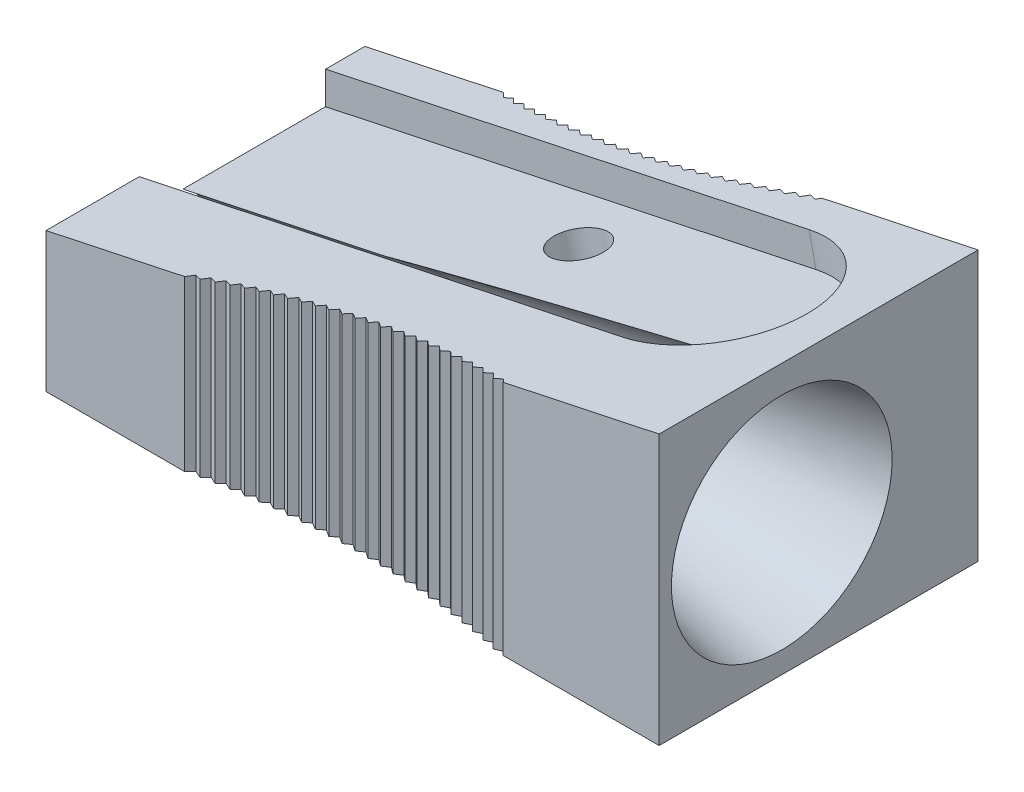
ISO-10303-21;
HEADER;
FILE_DESCRIPTION(('STEP AP214'),'2;1');
FILE_NAME('part.step','',(''),(''),'','','');
FILE_SCHEMA(('AUTOMOTIVE_DESIGN { 1 0 10303 214 1 1 1 1 }'));
ENDSEC;
DATA;
#1=APPLICATION_CONTEXT('core data for automotive mechanical design processes');
#2=APPLICATION_PROTOCOL_DEFINITION('international standard','automotive_design',2000,#1);
#3=PRODUCT_CONTEXT('',#1,'mechanical');
#4=PRODUCT('Part','Part','',(#3));
#5=PRODUCT_RELATED_PRODUCT_CATEGORY('part','',(#4));
#6=PRODUCT_DEFINITION_FORMATION('','',#4);
#7=PRODUCT_DEFINITION_CONTEXT('part definition',#1,'design');
#8=PRODUCT_DEFINITION('design','',#6,#7);
#9=PRODUCT_DEFINITION_SHAPE('','',#8);
#10=(LENGTH_UNIT() NAMED_UNIT(*) SI_UNIT(.MILLI.,.METRE.));
#11=(NAMED_UNIT(*) PLANE_ANGLE_UNIT() SI_UNIT($,.RADIAN.));
#12=(NAMED_UNIT(*) SI_UNIT($,.STERADIAN.) SOLID_ANGLE_UNIT());
#13=UNCERTAINTY_MEASURE_WITH_UNIT(LENGTH_MEASURE(1.E-05),#10,'distance_accuracy_value','');
#14=(GEOMETRIC_REPRESENTATION_CONTEXT(3) GLOBAL_UNCERTAINTY_ASSIGNED_CONTEXT((#13)) GLOBAL_UNIT_ASSIGNED_CONTEXT((#10,
#11,#12)) REPRESENTATION_CONTEXT('',''));
#15=CARTESIAN_POINT('',(0.,0.,0.));
#16=DIRECTION('',(0.,0.,1.));
#17=DIRECTION('',(1.,0.,0.));
#18=AXIS2_PLACEMENT_3D('',#15,#16,#17);
#19=CARTESIAN_POINT('',(-25.,-5.31391404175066,13.));
#20=DIRECTION('',(0.207911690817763,-0.978147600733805,0.));
#21=DIRECTION('',(0.978147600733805,0.207911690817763,0.));
#22=AXIS2_PLACEMENT_3D('',#19,#20,#21);
#23=PLANE('',#22);
#24=DIRECTION('',(0.678389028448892,0.144196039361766,0.720413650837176));
#25=VECTOR('',#24,1.);
#26=CARTESIAN_POINT('',(-15.7107541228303,-3.33942387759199,3.8574245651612));
#27=LINE('',#26,#25);
#28=CARTESIAN_POINT('',(-19.3431596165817,-4.11151549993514,1.2490009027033E-13));
#29=VERTEX_POINT('',#28);
#30=CARTESIAN_POINT('',(-19.1225567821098,-4.0646249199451,0.23426866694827));
#31=VERTEX_POINT('',#30);
#32=EDGE_CURVE('E873',#29,#31,#27,.T.);
#33=ORIENTED_EDGE('',*,*,#32,.F.);
#34=DIRECTION('',(-0.978147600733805,-0.207911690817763,0.));
#35=VECTOR('',#34,1.);
#36=CARTESIAN_POINT('',(-25.,-5.31391404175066,0.));
#37=LINE('',#36,#35);
#38=CARTESIAN_POINT('',(-25.,-5.31391404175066,0.));
#39=VERTEX_POINT('',#38);
#40=EDGE_CURVE('E1534',#29,#39,#37,.T.);
#41=ORIENTED_EDGE('',*,*,#40,.T.);
#42=DIRECTION('',(0.,0.,-1.));
#43=VECTOR('',#42,1.);
#44=CARTESIAN_POINT('',(-25.,-5.31391404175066,13.));
#45=LINE('',#44,#43);
#46=CARTESIAN_POINT('',(-25.,-5.31391404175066,1.6));
#47=VERTEX_POINT('',#46);
#48=EDGE_CURVE('E1550',#47,#39,#45,.T.);
#49=ORIENTED_EDGE('',*,*,#48,.F.);
#50=DIRECTION('',(-0.978147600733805,-0.207911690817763,0.));
#51=VECTOR('',#50,1.);
#52=CARTESIAN_POINT('',(-5.28199704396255,-1.12272313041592,1.6));
#53=LINE('',#52,#51);
#54=CARTESIAN_POINT('',(-5.28199704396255,-1.12272313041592,1.6));
#55=VERTEX_POINT('',#54);
#56=EDGE_CURVE('E1291',#55,#47,#53,.T.);
#57=ORIENTED_EDGE('',*,*,#56,.F.);
#58=CARTESIAN_POINT('',(-5.28199704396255,-1.12272313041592,5.4));
#59=DIRECTION('',(-0.207911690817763,0.978147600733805,0.));
#60=DIRECTION('',(0.978147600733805,0.207911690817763,0.));
#61=AXIS2_PLACEMENT_3D('',#58,#59,#60);
#62=CIRCLE('',#61,3.8);
#63=CARTESIAN_POINT('',(-5.28199704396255,-1.12272313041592,9.2));
#64=VERTEX_POINT('',#63);
#65=EDGE_CURVE('E1278',#64,#55,#62,.T.);
#66=ORIENTED_EDGE('',*,*,#65,.F.);
#67=DIRECTION('',(-0.978147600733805,-0.207911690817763,0.));
#68=VECTOR('',#67,1.);
#69=CARTESIAN_POINT('',(-25.,-5.31391404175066,9.2));
#70=LINE('',#69,#68);
#71=CARTESIAN_POINT('',(-25.,-5.31391404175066,9.2));
#72=VERTEX_POINT('',#71);
#73=EDGE_CURVE('E1369',#64,#72,#70,.T.);
#74=ORIENTED_EDGE('',*,*,#73,.T.);
#75=CARTESIAN_POINT('',(-25.,-5.31391404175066,13.));
#76=VERTEX_POINT('',#75);
#77=EDGE_CURVE('E1364',#76,#72,#45,.T.);
#78=ORIENTED_EDGE('',*,*,#77,.F.);
#79=DIRECTION('',(-0.978147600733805,-0.207911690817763,0.));
#80=VECTOR('',#79,1.);
#81=CARTESIAN_POINT('',(-25.,-5.31391404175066,13.));
#82=LINE('',#81,#80);
#83=CARTESIAN_POINT('',(-19.3431596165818,-4.11151549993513,13.));
#84=VERTEX_POINT('',#83);
#85=EDGE_CURVE('E1545',#84,#76,#82,.T.);
#86=ORIENTED_EDGE('',*,*,#85,.F.);
#87=DIRECTION('',(-0.678389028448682,-0.144196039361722,0.720413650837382));
#88=VECTOR('',#87,1.);
#89=CARTESIAN_POINT('',(-22.0641234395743,-4.68987421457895,15.8895212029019));
#90=LINE('',#89,#88);
#91=CARTESIAN_POINT('',(-19.1225567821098,-4.06462491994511,12.7657313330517));
#92=VERTEX_POINT('',#91);
#93=EDGE_CURVE('E56',#92,#84,#90,.T.);
#94=ORIENTED_EDGE('',*,*,#93,.F.);
#95=DIRECTION('',(-0.900443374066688,-0.191395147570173,-0.390601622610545));
#96=VECTOR('',#95,1.);
#97=CARTESIAN_POINT('',(-24.0208849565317,-5.10579671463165,10.6408948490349));
#98=LINE('',#97,#96);
#99=CARTESIAN_POINT('',(-18.8273475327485,-4.00187625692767,12.8937895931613));
#100=VERTEX_POINT('',#99);
#101=EDGE_CURVE('E1270',#100,#92,#98,.T.);
#102=ORIENTED_EDGE('',*,*,#101,.F.);
#103=DIRECTION('',(-0.690592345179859,-0.146789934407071,0.708191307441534));
#104=VECTOR('',#103,1.);
#105=CARTESIAN_POINT('',(-21.9561436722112,-4.66692240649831,16.1023195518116));
#106=LINE('',#105,#104);
#107=CARTESIAN_POINT('',(-18.6026897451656,-3.95412377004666,12.6634066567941));
#108=VERTEX_POINT('',#107);
#109=EDGE_CURVE('E1267',#108,#100,#106,.T.);
#110=ORIENTED_EDGE('',*,*,#109,.F.);
#111=DIRECTION('',(-0.893741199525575,-0.189970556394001,-0.406371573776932));
#112=VECTOR('',#111,1.);
#113=CARTESIAN_POINT('',(-23.8213142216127,-5.06337664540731,10.290571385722));
#114=LINE('',#113,#112);
#115=CARTESIAN_POINT('',(-18.309760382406,-3.89185971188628,12.7965975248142));
#116=VERTEX_POINT('',#115);
#117=EDGE_CURVE('E1264',#116,#108,#114,.T.);
#118=ORIENTED_EDGE('',*,*,#117,.F.);
#119=DIRECTION('',(-0.702575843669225,-0.149337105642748,0.695762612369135));
#120=VECTOR('',#119,1.);
#121=CARTESIAN_POINT('',(-21.8607796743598,-4.64665216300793,16.3131807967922));
#122=LINE('',#121,#120);
#123=CARTESIAN_POINT('',(-18.0811160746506,-3.84325986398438,12.5701704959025));
#124=VERTEX_POINT('',#123);
#125=EDGE_CURVE('E1261',#124,#116,#122,.T.);
#126=ORIENTED_EDGE('',*,*,#125,.F.);
#127=DIRECTION('',(-0.886770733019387,-0.18848893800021,-0.422030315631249));
#128=VECTOR('',#127,1.);
#129=CARTESIAN_POINT('',(-23.6068192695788,-5.0177843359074,9.94038787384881));
#130=LINE('',#129,#128);
#131=CARTESIAN_POINT('',(-17.7905558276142,-3.78149937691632,12.7084534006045));
#132=VERTEX_POINT('',#131);
#133=EDGE_CURVE('E1258',#132,#124,#130,.T.);
#134=ORIENTED_EDGE('',*,*,#133,.F.);
#135=DIRECTION('',(-0.714336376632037,-0.151836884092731,0.68313183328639));
#136=VECTOR('',#135,1.);
#137=CARTESIAN_POINT('',(-21.7778457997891,-4.62902402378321,16.5215655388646));
#138=LINE('',#137,#136);
#139=CARTESIAN_POINT('',(-17.5579946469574,-3.732066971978,12.4860512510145));
#140=VERTEX_POINT('',#139);
#141=EDGE_CURVE('E1255',#140,#132,#138,.T.);
#142=ORIENTED_EDGE('',*,*,#141,.F.);
#143=DIRECTION('',(-0.879533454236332,-0.186950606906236,-0.437573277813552));
#144=VECTOR('',#143,1.);
#145=CARTESIAN_POINT('',(-23.3772779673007,-4.9689938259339,9.59092217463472));
#146=LINE('',#145,#144);
#147=CARTESIAN_POINT('',(-17.2698920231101,-3.67082886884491,12.6293840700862));
#148=VERTEX_POINT('',#147);
#149=EDGE_CURVE('E1252',#148,#140,#146,.T.);
#150=ORIENTED_EDGE('',*,*,#149,.F.);
#151=DIRECTION('',(-0.725870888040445,-0.154288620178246,0.670303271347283));
#152=VECTOR('',#151,1.);
#153=CARTESIAN_POINT('',(-21.7071369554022,-4.61399439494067,16.7269444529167));
#154=LINE('',#153,#152);
#155=CARTESIAN_POINT('',(-17.0334848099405,-3.62057896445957,12.4110745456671));
#156=VERTEX_POINT('',#155);
#157=EDGE_CURVE('E1249',#156,#148,#154,.T.);
#158=ORIENTED_EDGE('',*,*,#157,.F.);
#159=DIRECTION('',(-0.872030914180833,-0.185355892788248,-0.452995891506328));
#160=VECTOR('',#159,1.);
#161=CARTESIAN_POINT('',(-23.1325879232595,-4.91698335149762,9.24275951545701));
#162=LINE('',#161,#160);
#163=CARTESIAN_POINT('',(-16.7479275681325,-3.55988189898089,12.5594136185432));
#164=VERTEX_POINT('',#163);
#165=EDGE_CURVE('E1246',#164,#156,#162,.T.);
#166=ORIENTED_EDGE('',*,*,#165,.F.);
#167=DIRECTION('',(-0.737176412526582,-0.156691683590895,0.65728125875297));
#168=VECTOR('',#167,1.);
#169=CARTESIAN_POINT('',(-21.6484290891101,-4.60151565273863,16.9287989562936));
#170=LINE('',#169,#168);
#171=CARTESIAN_POINT('',(-16.5077463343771,-3.50882980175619,12.3452632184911));
#172=VERTEX_POINT('',#171);
#173=EDGE_CURVE('E1243',#172,#164,#170,.T.);
#174=ORIENTED_EDGE('',*,*,#173,.F.);
#175=DIRECTION('',(-0.864264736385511,-0.183705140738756,-0.468293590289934));
#176=VECTOR('',#175,1.);
#177=CARTESIAN_POINT('',(-22.872666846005,-4.86173542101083,8.89649184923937));
#178=LINE('',#177,#176);
#179=CARTESIAN_POINT('',(-16.2248214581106,-3.44869226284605,12.4985633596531));
#180=VERTEX_POINT('',#179);
#181=EDGE_CURVE('E1240',#180,#172,#178,.T.);
#182=ORIENTED_EDGE('',*,*,#181,.F.);
#183=DIRECTION('',(-0.748250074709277,-0.159045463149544,0.64407015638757));
#184=VECTOR('',#183,1.);
#185=CARTESIAN_POINT('',(-21.6014796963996,-4.59153625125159,17.1266218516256));
#186=LINE('',#185,#184);
#187=CARTESIAN_POINT('',(-15.9809393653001,-3.39685352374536,12.2886373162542));
#188=VERTEX_POINT('',#187);
#189=EDGE_CURVE('E1237',#188,#180,#186,.T.);
#190=ORIENTED_EDGE('',*,*,#189,.F.);
#191=DIRECTION('',(-0.856236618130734,-0.18199871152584,-0.4834618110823));
#192=VECTOR('',#191,1.);
#193=CARTESIAN_POINT('',(-22.5974528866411,-4.80323688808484,8.55271719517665));
#194=LINE('',#193,#192);
#195=CARTESIAN_POINT('',(-15.700733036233,-3.33729382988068,12.446851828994));
#196=VERTEX_POINT('',#195);
#197=EDGE_CURVE('E1234',#196,#188,#194,.T.);
#198=ORIENTED_EDGE('',*,*,#197,.F.);
#199=DIRECTION('',(-0.759089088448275,-0.1613493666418,0.630674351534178));
#200=VECTOR('',#199,1.);
#201=CARTESIAN_POINT('',(-21.5660283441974,-4.58400083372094,17.3199179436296));
#202=LINE('',#201,#200);
#203=CARTESIAN_POINT('',(-15.4532243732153,-3.2846842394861,12.2412140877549));
#204=VERTEX_POINT('',#203);
#205=EDGE_CURVE('E1231',#204,#196,#202,.T.);
#206=ORIENTED_EDGE('',*,*,#205,.F.);
#207=DIRECTION('',(-0.84794833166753,-0.180236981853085,-0.498495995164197));
#208=VECTOR('',#207,1.);
#209=CARTESIAN_POINT('',(-22.3069049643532,-4.74147902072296,8.21203896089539));
#210=LINE('',#209,#208);
#211=CARTESIAN_POINT('',(-15.17582194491,-3.2257205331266,12.4042947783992));
#212=VERTEX_POINT('',#211);
#213=EDGE_CURVE('E1228',#212,#204,#210,.T.);
#214=ORIENTED_EDGE('',*,*,#213,.F.);
#215=DIRECTION('',(-0.769690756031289,-0.163602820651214,0.617098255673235));
#216=VECTOR('',#215,1.);
#217=CARTESIAN_POINT('',(-21.5417972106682,-4.5788503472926,17.5082046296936));
#218=LINE('',#217,#216);
#219=CARTESIAN_POINT('',(-14.9247621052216,-3.17235611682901,12.2030079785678));
#220=VERTEX_POINT('',#219);
#221=EDGE_CURVE('E1225',#220,#212,#218,.T.);
#222=ORIENTED_EDGE('',*,*,#221,.F.);
#223=DIRECTION('',(-0.839401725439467,-0.178420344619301,-0.513391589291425));
#224=VECTOR('',#223,1.);
#225=CARTESIAN_POINT('',(-22.0010030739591,-4.67645756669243,7.8750652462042));
#226=LINE('',#225,#224);
#227=CARTESIAN_POINT('',(-14.6502480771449,-3.11400635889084,12.3709051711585));
#228=VERTEX_POINT('',#227);
#229=EDGE_CURVE('E1222',#228,#220,#226,.T.);
#230=ORIENTED_EDGE('',*,*,#229,.F.);
#231=DIRECTION('',(-0.780052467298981,-0.165805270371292,0.603346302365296));
#232=VECTOR('',#231,1.);
#233=CARTESIAN_POINT('',(-21.5284916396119,-4.57602216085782,17.691012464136));
#234=LINE('',#233,#232);
#235=CARTESIAN_POINT('',(-14.395713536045,-3.05990337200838,12.1740306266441));
#236=VERTEX_POINT('',#235);
#237=EDGE_CURVE('E1219',#236,#228,#234,.T.);
#238=ORIENTED_EDGE('',*,*,#237,.F.);
#239=DIRECTION('',(-0.830598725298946,-0.176549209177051,-0.528144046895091));
#240=VECTOR('',#239,1.);
#241=CARTESIAN_POINT('',(-21.6797485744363,-4.60817281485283,7.54240812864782));
#242=LINE('',#241,#240);
#243=CARTESIAN_POINT('',(-14.1241715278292,-3.00218533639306,12.3466931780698));
#244=VERTEX_POINT('',#243);
#245=EDGE_CURVE('E1216',#244,#236,#242,.T.);
#246=ORIENTED_EDGE('',*,*,#245,.F.);
#247=DIRECTION('',(-0.790171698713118,-0.167956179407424,0.589422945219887));
#248=VECTOR('',#247,1.);
#249=CARTESIAN_POINT('',(-21.5258007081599,-4.57545018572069,17.8678856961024));
#250=LINE('',#249,#248);
#251=CARTESIAN_POINT('',(-13.8662398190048,-2.94736025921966,12.1542908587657));
#252=VERTEX_POINT('',#251);
#253=EDGE_CURVE('E1213',#252,#244,#250,.T.);
#254=ORIENTED_EDGE('',*,*,#253,.F.);
#255=DIRECTION('',(-0.821541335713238,-0.174624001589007,-0.542748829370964));
#256=VECTOR('',#255,1.);
#257=CARTESIAN_POINT('',(-21.3431644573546,-4.5366296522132,7.21468293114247));
#258=LINE('',#257,#256);
#259=CARTESIAN_POINT('',(-13.597752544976,-2.89029152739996,12.3316661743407));
#260=VERTEX_POINT('',#259);
#261=EDGE_CURVE('E1210',#260,#252,#258,.T.);
#262=ORIENTED_EDGE('',*,*,#261,.F.);
#263=DIRECTION('',(-0.800046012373,-0.17005502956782,0.575332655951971));
#264=VECTOR('',#263,1.);
#265=CARTESIAN_POINT('',(-21.5333978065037,-4.57706499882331,18.0383827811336));
#266=LINE('',#265,#264);
#267=CARTESIAN_POINT('',(-13.3365022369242,-2.83476106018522,12.1437946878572));
#268=VERTEX_POINT('',#267);
#269=EDGE_CURVE('E1207',#268,#260,#266,.T.);
#270=ORIENTED_EDGE('',*,*,#269,.F.);
#271=DIRECTION('',(-0.812231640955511,-0.172645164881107,-0.557201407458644));
#272=VECTOR('',#271,1.);
#273=CARTESIAN_POINT('',(-20.9912955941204,-4.4618376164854,6.89250747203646));
#274=LINE('',#273,#272);
#275=CARTESIAN_POINT('',(-13.0711514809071,-2.77835901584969,12.3258287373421));
#276=VERTEX_POINT('',#275);
#277=EDGE_CURVE('E1204',#276,#268,#274,.T.);
#278=ORIENTED_EDGE('',*,*,#277,.F.);
#279=DIRECTION('',(-0.80967305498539,-0.172101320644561,0.561079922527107));
#280=VECTOR('',#279,1.);
#281=CARTESIAN_POINT('',(-21.5509412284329,-4.58079396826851,18.2020768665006));
#282=LINE('',#281,#280);
#283=CARTESIAN_POINT('',(-12.8066621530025,-2.72214007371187,12.142545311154));
#284=VERTEX_POINT('',#283);
#285=EDGE_CURVE('E1201',#284,#276,#282,.T.);
#286=ORIENTED_EDGE('',*,*,#285,.F.);
#287=DIRECTION('',(-0.802671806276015,-0.170613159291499,-0.571497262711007));
#288=VECTOR('',#287,1.);
#289=CARTESIAN_POINT('',(-20.6242089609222,-4.38381094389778,6.57650129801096));
#290=LINE('',#289,#288);
#291=CARTESIAN_POINT('',(-12.5445287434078,-2.66642189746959,12.3291826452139));
#292=VERTEX_POINT('',#291);
#293=EDGE_CURVE('E1198',#292,#284,#290,.T.);
#294=ORIENTED_EDGE('',*,*,#293,.F.);
#295=DIRECTION('',(-0.819050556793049,-0.174094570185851,0.546669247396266));
#296=VECTOR('',#295,1.);
#297=CARTESIAN_POINT('',(-21.5780747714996,-4.58656138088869,18.3585562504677));
#298=LINE('',#297,#296);
#299=CARTESIAN_POINT('',(-12.2768809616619,-2.60953160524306,12.1505431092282));
#300=VERTEX_POINT('',#299);
#301=EDGE_CURVE('E1195',#300,#292,#298,.T.);
#302=ORIENTED_EDGE('',*,*,#301,.F.);
#303=DIRECTION('',(-0.792864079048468,-0.168528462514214,-0.585631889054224));
#304=VECTOR('',#303,1.);
#305=CARTESIAN_POINT('',(-20.2419938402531,-4.30256861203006,6.26728490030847));
#306=LINE('',#305,#304);
#307=CARTESIAN_POINT('',(-12.0180447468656,-2.55451426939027,12.3417268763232));
#308=VERTEX_POINT('',#307);
#309=EDGE_CURVE('E1192',#308,#300,#306,.T.);
#310=ORIENTED_EDGE('',*,*,#309,.F.);
#311=DIRECTION('',(-0.828176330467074,-0.176034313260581,0.532105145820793));
#312=VECTOR('',#311,1.);
#313=CARTESIAN_POINT('',(-21.6144283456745,-4.59428857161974,18.507424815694));
#314=LINE('',#313,#312);
#315=CARTESIAN_POINT('',(-11.7473200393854,-2.49696995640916,12.1677856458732));
#316=VERTEX_POINT('',#315);
#317=EDGE_CURVE('E1189',#316,#308,#314,.T.);
#318=ORIENTED_EDGE('',*,*,#317,.F.);
#319=DIRECTION('',(-0.782810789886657,-0.166391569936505,-0.599600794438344));
#320=VECTOR('',#319,1.);
#321=CARTESIAN_POINT('',(-19.844761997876,-4.21813437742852,5.96547891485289));
#322=LINE('',#321,#320);
#323=CARTESIAN_POINT('',(-11.4918598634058,-2.44267021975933,12.3634576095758));
#324=VERTEX_POINT('',#323);
#325=EDGE_CURVE('E1186',#324,#316,#322,.T.);
#326=ORIENTED_EDGE('',*,*,#325,.F.);
#327=DIRECTION('',(-0.837048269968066,-0.177920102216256,0.517392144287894));
#328=VECTOR('',#327,1.);
#329=CARTESIAN_POINT('',(-21.6596185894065,-4.60389405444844,18.6483024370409));
#330=LINE('',#329,#328);
#331=CARTESIAN_POINT('',(-11.2181406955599,-2.3844894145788,12.1942676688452));
#332=VERTEX_POINT('',#331);
#333=EDGE_CURVE('E1183',#332,#324,#330,.T.);
#334=ORIENTED_EDGE('',*,*,#333,.F.);
#335=DIRECTION('',(-0.772514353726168,-0.164202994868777,-0.613399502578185));
#336=VECTOR('',#335,1.);
#337=CARTESIAN_POINT('',(-19.4326478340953,-4.13053680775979,5.67170330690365));
#338=LINE('',#337,#336);
#339=CARTESIAN_POINT('',(-10.9661343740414,-2.33092381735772,12.3943682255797));
#340=VERTEX_POINT('',#339);
#341=EDGE_CURVE('E1180',#340,#332,#338,.T.);
#342=ORIENTED_EDGE('',*,*,#341,.F.);
#343=DIRECTION('',(-0.845664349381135,-0.179751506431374,0.502534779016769));
#344=VECTOR('',#343,1.);
#345=CARTESIAN_POINT('',(-21.713249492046,-4.61529365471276,18.7808253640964));
#346=LINE('',#345,#344);
#347=CARTESIAN_POINT('',(-10.6895041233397,-2.27212424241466,12.2299811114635));
#348=VERTEX_POINT('',#347);
#349=EDGE_CURVE('E1177',#348,#340,#346,.T.);
#350=ORIENTED_EDGE('',*,*,#349,.F.);
#351=DIRECTION('',(-0.761977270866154,-0.16196326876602,-0.627023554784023));
#352=VECTOR('',#351,1.);
#353=CARTESIAN_POINT('',(-19.0058085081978,-4.03980930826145,5.38657654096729));
#354=LINE('',#353,#352);
#355=CARTESIAN_POINT('',(-10.4410284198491,-2.21930910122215,12.4344493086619));
#356=VERTEX_POINT('',#355);
#357=EDGE_CURVE('E1174',#356,#348,#354,.T.);
#358=ORIENTED_EDGE('',*,*,#357,.F.);
#359=DIRECTION('',(-0.854022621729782,-0.181528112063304,0.487537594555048));
#360=VECTOR('',#359,1.);
#361=CARTESIAN_POINT('',(-21.774913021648,-4.62840064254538,18.9046465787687));
#362=LINE('',#361,#360);
#363=CARTESIAN_POINT('',(-10.1615713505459,-2.15990866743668,12.2749150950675));
#364=VERTEX_POINT('',#363);
#365=EDGE_CURVE('E1171',#364,#356,#362,.T.);
#366=ORIENTED_EDGE('',*,*,#365,.F.);
#367=DIRECTION('',(-0.751202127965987,-0.159672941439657,-0.640468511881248));
#368=VECTOR('',#367,1.);
#369=CARTESIAN_POINT('',(-18.5644240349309,-3.94599014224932,5.11071473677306));
#370=LINE('',#369,#368);
#371=CARTESIAN_POINT('',(-9.91670195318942,-2.10786007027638,12.4836886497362));
#372=VERTEX_POINT('',#371);
#373=EDGE_CURVE('E1168',#372,#364,#370,.T.);
#374=ORIENTED_EDGE('',*,*,#373,.F.);
#375=DIRECTION('',(-0.862121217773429,-0.183249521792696,0.472405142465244));
#376=VECTOR('',#375,1.);
#377=CARTESIAN_POINT('',(-21.844189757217,-4.64312586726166,19.0194361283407));
#378=LINE('',#377,#376);
#379=CARTESIAN_POINT('',(-9.63450319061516,-2.04787687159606,12.3290559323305));
#380=VERTEX_POINT('',#379);
#381=EDGE_CURVE('E1165',#380,#372,#378,.T.);
#382=ORIENTED_EDGE('',*,*,#381,.F.);
#383=DIRECTION('',(-0.740191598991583,-0.15733258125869,-0.653729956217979));
#384=VECTOR('',#383,1.);
#385=CARTESIAN_POINT('',(-18.108697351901,-3.8491224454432,4.84473081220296));
#386=LINE('',#385,#384);
#387=CARTESIAN_POINT('',(-9.3933146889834,-1.99661067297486,12.5420712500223));
#388=VERTEX_POINT('',#387);
#389=EDGE_CURVE('E1162',#388,#380,#386,.T.);
#390=ORIENTED_EDGE('',*,*,#389,.F.);
#391=DIRECTION('',(-0.869958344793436,-0.18491535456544,0.457141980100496));
#392=VECTOR('',#391,1.);
#393=CARTESIAN_POINT('',(-21.9206495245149,-4.65937789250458,19.1248814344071));
#394=LINE('',#393,#392);
#395=CARTESIAN_POINT('',(-9.10846019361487,-1.93606298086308,12.392387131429));
#396=VERTEX_POINT('',#395);
#397=EDGE_CURVE('E1159',#396,#388,#394,.T.);
#398=ORIENTED_EDGE('',*,*,#397,.F.);
#399=DIRECTION('',(-0.728948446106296,-0.154942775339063,-0.666803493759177));
#400=VECTOR('',#399,1.);
#401=CARTESIAN_POINT('',(-17.6388543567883,-3.74925423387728,4.58923361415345));
#402=LINE('',#401,#400);
#403=CARTESIAN_POINT('',(-8.87102605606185,-1.88559479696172,12.6095793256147));
#404=VERTEX_POINT('',#403);
#405=EDGE_CURVE('E1156',#404,#396,#402,.T.);
#406=ORIENTED_EDGE('',*,*,#405,.F.);
#407=DIRECTION('',(-0.877532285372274,-0.186525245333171,0.44175266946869));
#408=VECTOR('',#407,1.);
#409=CARTESIAN_POINT('',(-22.0038520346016,-4.67706313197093,19.2206875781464));
#410=LINE('',#409,#408);
#411=CARTESIAN_POINT('',(-8.58360259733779,-1.82450105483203,12.4648894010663));
#412=VERTEX_POINT('',#411);
#413=EDGE_CURVE('E1153',#412,#404,#410,.T.);
#414=ORIENTED_EDGE('',*,*,#413,.F.);
#415=DIRECTION('',(-0.717475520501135,-0.152504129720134,-0.679684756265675));
#416=VECTOR('',#415,1.);
#417=CARTESIAN_POINT('',(-17.1551439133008,-3.64643840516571,4.34482703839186));
#418=LINE('',#417,#416);
#419=CARTESIAN_POINT('',(-8.3499951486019,-1.77484625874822,12.6861923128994));
#420=VERTEX_POINT('',#419);
#421=EDGE_CURVE('E1150',#420,#412,#418,.T.);
#422=ORIENTED_EDGE('',*,*,#421,.F.);
#423=DIRECTION('',(-0.884841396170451,-0.188078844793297,0.42624177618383));
#424=VECTOR('',#423,1.);
#425=CARTESIAN_POINT('',(-22.0933475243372,-4.6960859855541,19.3065775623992));
#426=LINE('',#425,#424);
#427=CARTESIAN_POINT('',(-8.06009027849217,-1.7132250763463,12.5465406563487));
#428=VERTEX_POINT('',#427);
#429=EDGE_CURVE('E1147',#428,#420,#426,.T.);
#430=ORIENTED_EDGE('',*,*,#429,.F.);
#431=DIRECTION('',(-0.705775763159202,-0.150017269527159,-0.692369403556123));
#432=VECTOR('',#431,1.);
#433=CARTESIAN_POINT('',(-16.6578378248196,-3.54073273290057,4.11210913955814));
#434=LINE('',#433,#432);
#435=CARTESIAN_POINT('',(-7.83038067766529,-1.66439879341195,12.7718868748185));
#436=VERTEX_POINT('',#435);
#437=EDGE_CURVE('E1144',#436,#428,#434,.T.);
#438=ORIENTED_EDGE('',*,*,#437,.F.);
#439=DIRECTION('',(-0.89188410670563,-0.189575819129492,0.410613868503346));
#440=VECTOR('',#439,1.);
#441=CARTESIAN_POINT('',(-22.1886773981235,-4.71634897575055,19.3822925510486));
#442=LINE('',#441,#440);
#443=CARTESIAN_POINT('',(-7.5380827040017,-1.6022689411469,12.6373160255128));
#444=VERTEX_POINT('',#443);
#445=EDGE_CURVE('E1141',#444,#436,#442,.T.);
#446=ORIENTED_EDGE('',*,*,#445,.F.);
#447=DIRECTION('',(-0.693852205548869,-0.147482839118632,-0.704853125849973));
#448=VECTOR('',#447,1.);
#449=CARTESIAN_POINT('',(-16.1472307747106,-3.43219985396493,3.89167123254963));
#450=LINE('',#449,#448);
#451=CARTESIAN_POINT('',(-7.31234092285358,-1.55428604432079,12.8666369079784));
#452=VERTEX_POINT('',#451);
#453=EDGE_CURVE('E1138',#452,#444,#450,.T.);
#454=ORIENTED_EDGE('',*,*,#453,.F.);
#455=DIRECTION('',(-0.898658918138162,-0.191015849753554,0.39487351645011));
#456=VECTOR('',#455,1.);
#457=CARTESIAN_POINT('',(-22.2893748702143,-4.73775288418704,19.4475920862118));
#458=LINE('',#457,#456);
#459=CARTESIAN_POINT('',(-7.01773888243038,-1.49166644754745,12.7371878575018));
#460=VERTEX_POINT('',#459);
#461=EDGE_CURVE('E1135',#460,#452,#458,.T.);
#462=ORIENTED_EDGE('',*,*,#461,.F.);
#463=DIRECTION('',(-0.681707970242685,-0.144901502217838,-0.717131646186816));
#464=VECTOR('',#463,1.);
#465=CARTESIAN_POINT('',(-15.6236402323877,-3.32090724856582,3.68409698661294));
#466=LINE('',#465,#464);
#467=CARTESIAN_POINT('',(-6.79603368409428,-1.44454155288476,12.9704135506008));
#468=VERTEX_POINT('',#467);
#469=EDGE_CURVE('E1132',#468,#460,#466,.T.);
#470=ORIENTED_EDGE('',*,*,#469,.F.);
#471=DIRECTION('',(-0.905164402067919,-0.192398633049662,0.379025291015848));
#472=VECTOR('',#471,1.);
#473=CARTESIAN_POINT('',(-22.3949656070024,-4.76019688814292,19.502254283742));
#474=LINE('',#473,#472);
#475=CARTESIAN_POINT('',(-6.49921731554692,-1.38145128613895,12.8461257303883));
#476=VERTEX_POINT('',#475);
#477=EDGE_CURVE('E1129',#476,#468,#474,.T.);
#478=ORIENTED_EDGE('',*,*,#477,.F.);
#479=DIRECTION('',(-0.669346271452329,-0.142273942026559,-0.72920072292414));
#480=VECTOR('',#479,1.);
#481=CARTESIAN_POINT('',(-15.0874063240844,-3.20692721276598,3.4899615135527));
#482=LINE('',#481,#480);
#483=CARTESIAN_POINT('',(-6.35797339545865,-1.35142896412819,13.));
#484=VERTEX_POINT('',#483);
#485=EDGE_CURVE('E1122',#484,#476,#482,.T.);
#486=ORIENTED_EDGE('',*,*,#485,.F.);
#487=CARTESIAN_POINT('',(0.,0.,13.));
#488=VERTEX_POINT('',#487);
#489=EDGE_CURVE('E1590',#488,#484,#82,.T.);
#490=ORIENTED_EDGE('',*,*,#489,.F.);
#491=DIRECTION('',(0.,0.,-1.));
#492=VECTOR('',#491,1.);
#493=CARTESIAN_POINT('',(0.,0.,13.));
#494=LINE('',#493,#492);
#495=CARTESIAN_POINT('',(0.,0.,0.));
#496=VERTEX_POINT('',#495);
#497=EDGE_CURVE('E1532',#488,#496,#494,.T.);
#498=ORIENTED_EDGE('',*,*,#497,.T.);
#499=CARTESIAN_POINT('',(-6.35797339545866,-1.3514289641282,0.));
#500=VERTEX_POINT('',#499);
#501=EDGE_CURVE('E1526',#496,#500,#37,.T.);
#502=ORIENTED_EDGE('',*,*,#501,.T.);
#503=DIRECTION('',(0.669346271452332,0.14227394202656,-0.729200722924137));
#504=VECTOR('',#503,1.);
#505=CARTESIAN_POINT('',(-21.4325475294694,-4.55562861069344,16.4225765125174));
#506=LINE('',#505,#504);
#507=CARTESIAN_POINT('',(-6.49921731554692,-1.38145128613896,0.153874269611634));
#508=VERTEX_POINT('',#507);
#509=EDGE_CURVE('E48',#508,#500,#506,.T.);
#510=ORIENTED_EDGE('',*,*,#509,.F.);
#511=DIRECTION('',(0.905164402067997,0.192398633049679,0.379025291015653));
#512=VECTOR('',#511,1.);
#513=CARTESIAN_POINT('',(-17.9349229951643,-3.81218556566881,-4.63467205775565));
#514=LINE('',#513,#512);
#515=CARTESIAN_POINT('',(-6.79603368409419,-1.44454155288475,0.029586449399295));
#516=VERTEX_POINT('',#515);
#517=EDGE_CURVE('E746',#516,#508,#514,.T.);
#518=ORIENTED_EDGE('',*,*,#517,.F.);
#519=DIRECTION('',(0.681707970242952,0.144901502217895,-0.717131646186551));
#520=VECTOR('',#519,1.);
#521=CARTESIAN_POINT('',(-21.9790068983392,-4.67178213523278,16.0015143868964));
#522=LINE('',#521,#520);
#523=CARTESIAN_POINT('',(-7.01773888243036,-1.49166644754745,0.262812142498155));
#524=VERTEX_POINT('',#523);
#525=EDGE_CURVE('E879',#524,#516,#522,.T.);
#526=ORIENTED_EDGE('',*,*,#525,.F.);
#527=DIRECTION('',(0.89865891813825,0.191015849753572,0.394873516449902));
#528=VECTOR('',#527,1.);
#529=CARTESIAN_POINT('',(-17.6762389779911,-3.75720058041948,-4.4205658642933));
#530=LINE('',#529,#528);
#531=CARTESIAN_POINT('',(-7.3123409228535,-1.55428604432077,0.133363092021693));
#532=VERTEX_POINT('',#531);
#533=EDGE_CURVE('E881',#532,#524,#530,.T.);
#534=ORIENTED_EDGE('',*,*,#533,.F.);
#535=DIRECTION('',(0.693852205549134,0.147482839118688,-0.7048531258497));
#536=VECTOR('',#535,1.);
#537=CARTESIAN_POINT('',(-22.5050614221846,-4.78359847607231,15.5669618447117));
#538=LINE('',#537,#536);
#539=CARTESIAN_POINT('',(-7.53808270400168,-1.6022689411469,0.362683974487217));
#540=VERTEX_POINT('',#539);
#541=EDGE_CURVE('E883',#540,#532,#538,.T.);
#542=ORIENTED_EDGE('',*,*,#541,.F.);
#543=DIRECTION('',(0.891884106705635,0.189575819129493,0.410613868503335));
#544=VECTOR('',#543,1.);
#545=CARTESIAN_POINT('',(-17.4278176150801,-3.70439698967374,-4.19044381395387));
#546=LINE('',#545,#544);
#547=CARTESIAN_POINT('',(-7.83038067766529,-1.66439879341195,0.228113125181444));
#548=VERTEX_POINT('',#547);
#549=EDGE_CURVE('E885',#548,#540,#546,.T.);
#550=ORIENTED_EDGE('',*,*,#549,.F.);
#551=DIRECTION('',(0.705775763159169,0.150017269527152,-0.692369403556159));
#552=VECTOR('',#551,1.);
#553=CARTESIAN_POINT('',(-23.0103858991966,-4.89100850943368,15.1197709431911));
#554=LINE('',#553,#552);
#555=CARTESIAN_POINT('',(-8.06009027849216,-1.7132250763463,0.453459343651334));
#556=VERTEX_POINT('',#555);
#557=EDGE_CURVE('E887',#556,#548,#554,.T.);
#558=ORIENTED_EDGE('',*,*,#557,.F.);
#559=DIRECTION('',(0.884841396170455,0.188078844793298,0.42624177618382));
#560=VECTOR('',#559,1.);
#561=CARTESIAN_POINT('',(-17.1903147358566,-3.65391419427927,-3.94471088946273));
#562=LINE('',#561,#560);
#563=CARTESIAN_POINT('',(-8.3499951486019,-1.77484625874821,0.313807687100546));
#564=VERTEX_POINT('',#563);
#565=EDGE_CURVE('E889',#564,#556,#562,.T.);
#566=ORIENTED_EDGE('',*,*,#565,.F.);
#567=DIRECTION('',(0.7174755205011,0.152504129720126,-0.679684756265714));
#568=VECTOR('',#567,1.);
#569=CARTESIAN_POINT('',(-23.4946871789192,-4.99394992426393,14.660800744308));
#570=LINE('',#569,#568);
#571=CARTESIAN_POINT('',(-8.58360259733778,-1.82450105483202,0.535110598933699));
#572=VERTEX_POINT('',#571);
#573=EDGE_CURVE('E891',#572,#564,#570,.T.);
#574=ORIENTED_EDGE('',*,*,#573,.F.);
#575=DIRECTION('',(0.877532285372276,0.186525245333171,0.441752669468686));
#576=VECTOR('',#575,1.);
#577=CARTESIAN_POINT('',(-16.9643730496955,-3.60588880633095,-3.68379710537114));
#578=LINE('',#577,#576);
#579=CARTESIAN_POINT('',(-8.87102605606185,-1.88559479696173,0.390420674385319));
#580=VERTEX_POINT('',#579);
#581=EDGE_CURVE('E893',#580,#572,#578,.T.);
#582=ORIENTED_EDGE('',*,*,#581,.F.);
#583=DIRECTION('',(0.728948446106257,0.154942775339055,-0.666803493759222));
#584=VECTOR('',#583,1.);
#585=CARTESIAN_POINT('',(-23.9577041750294,-5.09236722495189,14.1909160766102));
#586=LINE('',#585,#584);
#587=CARTESIAN_POINT('',(-9.10846019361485,-1.93606298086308,0.607612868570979));
#588=VERTEX_POINT('',#587);
#589=EDGE_CURVE('E895',#588,#580,#586,.T.);
#590=ORIENTED_EDGE('',*,*,#589,.F.);
#591=DIRECTION('',(0.869958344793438,0.18491535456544,0.457141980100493));
#592=VECTOR('',#591,1.);
#593=CARTESIAN_POINT('',(-16.7506212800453,-3.5604544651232,-3.40815716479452));
#594=LINE('',#593,#592);
#595=CARTESIAN_POINT('',(-9.3933146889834,-1.99661067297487,0.457928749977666));
#596=VERTEX_POINT('',#595);
#597=EDGE_CURVE('E897',#596,#588,#594,.T.);
#598=ORIENTED_EDGE('',*,*,#597,.F.);
#599=DIRECTION('',(0.740191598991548,0.157332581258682,-0.653729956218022));
#600=VECTOR('',#599,1.);
#601=CARTESIAN_POINT('',(-24.3992078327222,-5.1862117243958,13.7109863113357));
#602=LINE('',#601,#600);
#603=CARTESIAN_POINT('',(-9.63450319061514,-2.04787687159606,0.670944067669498));
#604=VERTEX_POINT('',#603);
#605=EDGE_CURVE('E899',#604,#596,#602,.T.);
#606=ORIENTED_EDGE('',*,*,#605,.F.);
#607=DIRECTION('',(0.862121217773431,0.183249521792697,0.47240514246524));
#608=VECTOR('',#607,1.);
#609=CARTESIAN_POINT('',(-16.5496733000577,-3.51774165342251,-3.1182700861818));
#610=LINE('',#609,#608);
#611=CARTESIAN_POINT('',(-9.91670195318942,-2.10786007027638,0.516311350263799));
#612=VERTEX_POINT('',#611);
#613=EDGE_CURVE('E901',#612,#604,#610,.T.);
#614=ORIENTED_EDGE('',*,*,#613,.F.);
#615=DIRECTION('',(0.751202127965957,0.159672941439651,-0.640468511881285));
#616=VECTOR('',#615,1.);
#617=CARTESIAN_POINT('',(-24.8190010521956,-5.27544152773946,13.2218841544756));
#618=LINE('',#617,#616);
#619=CARTESIAN_POINT('',(-10.1615713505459,-2.15990866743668,0.725084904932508));
#620=VERTEX_POINT('',#619);
#621=EDGE_CURVE('E903',#620,#612,#618,.T.);
#622=ORIENTED_EDGE('',*,*,#621,.F.);
#623=DIRECTION('',(0.854022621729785,0.181528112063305,0.487537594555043));
#624=VECTOR('',#623,1.);
#625=CARTESIAN_POINT('',(-16.3621272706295,-3.47787751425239,-2.81463879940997));
#626=LINE('',#625,#624);
#627=CARTESIAN_POINT('',(-10.4410284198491,-2.21930910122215,0.565550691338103));
#628=VERTEX_POINT('',#627);
#629=EDGE_CURVE('E905',#628,#620,#626,.T.);
#630=ORIENTED_EDGE('',*,*,#629,.F.);
#631=DIRECTION('',(0.761977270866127,0.161963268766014,-0.627023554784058));
#632=VECTOR('',#631,1.);
#633=CARTESIAN_POINT('',(-25.2169185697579,-5.36002150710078,12.7244844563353));
#634=LINE('',#633,#632);
#635=CARTESIAN_POINT('',(-10.6895041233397,-2.27212424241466,0.770018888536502));
#636=VERTEX_POINT('',#635);
#637=EDGE_CURVE('E907',#636,#628,#634,.T.);
#638=ORIENTED_EDGE('',*,*,#637,.F.);
#639=DIRECTION('',(0.845664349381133,0.179751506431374,0.502534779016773));
#640=VECTOR('',#639,1.);
#641=CARTESIAN_POINT('',(-16.1885647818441,-3.44098566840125,-2.49778971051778));
#642=LINE('',#641,#640);
#643=CARTESIAN_POINT('',(-10.9661343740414,-2.33092381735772,0.6056317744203));
#644=VERTEX_POINT('',#643);
#645=EDGE_CURVE('E909',#644,#636,#642,.T.);
#646=ORIENTED_EDGE('',*,*,#645,.F.);
#647=DIRECTION('',(0.772514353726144,0.164202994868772,-0.613399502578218));
#648=VECTOR('',#647,1.);
#649=CARTESIAN_POINT('',(-25.5928267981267,-5.43992326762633,12.2196630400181));
#650=LINE('',#649,#648);
#651=CARTESIAN_POINT('',(-11.2181406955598,-2.3844894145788,0.805732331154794));
#652=VERTEX_POINT('',#651);
#653=EDGE_CURVE('E911',#652,#644,#650,.T.);
#654=ORIENTED_EDGE('',*,*,#653,.F.);
#655=DIRECTION('',(0.837048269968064,0.177920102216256,0.517392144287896));
#656=VECTOR('',#655,1.);
#657=CARTESIAN_POINT('',(-16.0295499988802,-3.40718603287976,-2.1682722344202));
#658=LINE('',#657,#656);
#659=CARTESIAN_POINT('',(-11.4918598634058,-2.44267021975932,0.636542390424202));
#660=VERTEX_POINT('',#659);
#661=EDGE_CURVE('E913',#660,#652,#658,.T.);
#662=ORIENTED_EDGE('',*,*,#661,.F.);
#663=DIRECTION('',(0.782810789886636,0.166391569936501,-0.599600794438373));
#664=VECTOR('',#663,1.);
#665=CARTESIAN_POINT('',(-25.9466236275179,-5.51512510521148,11.7082955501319));
#666=LINE('',#665,#664);
#667=CARTESIAN_POINT('',(-11.7473200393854,-2.49696995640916,0.83221435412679));
#668=VERTEX_POINT('',#667);
#669=EDGE_CURVE('E915',#668,#660,#666,.T.);
#670=ORIENTED_EDGE('',*,*,#669,.F.);
#671=DIRECTION('',(0.828176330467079,0.176034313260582,0.532105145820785));
#672=VECTOR('',#671,1.);
#673=CARTESIAN_POINT('',(-15.885628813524,-3.37659464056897,-1.82665829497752));
#674=LINE('',#673,#672);
#675=CARTESIAN_POINT('',(-12.0180447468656,-2.55451426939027,0.658273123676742));
#676=VERTEX_POINT('',#675);
#677=EDGE_CURVE('E917',#676,#668,#674,.T.);
#678=ORIENTED_EDGE('',*,*,#677,.F.);
#679=DIRECTION('',(0.792864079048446,0.16852846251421,-0.585631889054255));
#680=VECTOR('',#679,1.);
#681=CARTESIAN_POINT('',(-26.2782381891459,-5.58561195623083,11.191256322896));
#682=LINE('',#681,#680);
#683=CARTESIAN_POINT('',(-12.2768809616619,-2.60953160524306,0.849456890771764));
#684=VERTEX_POINT('',#683);
#685=EDGE_CURVE('E919',#684,#676,#682,.T.);
#686=ORIENTED_EDGE('',*,*,#685,.F.);
#687=DIRECTION('',(0.819050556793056,0.174094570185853,0.546669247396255));
#688=VECTOR('',#687,1.);
#689=CARTESIAN_POINT('',(-15.7573280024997,-3.34932346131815,-1.47354179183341));
#690=LINE('',#689,#688);
#691=CARTESIAN_POINT('',(-12.5445287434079,-2.66642189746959,0.670817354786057));
#692=VERTEX_POINT('',#691);
#693=EDGE_CURVE('E921',#692,#684,#690,.T.);
#694=ORIENTED_EDGE('',*,*,#693,.F.);
#695=DIRECTION('',(0.802671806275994,0.170613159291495,-0.571497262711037));
#696=VECTOR('',#695,1.);
#697=CARTESIAN_POINT('',(-26.5876305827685,-5.65137533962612,10.6694172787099));
#698=LINE('',#697,#696);
#699=CARTESIAN_POINT('',(-12.8066621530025,-2.72214007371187,0.857454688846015));
#700=VERTEX_POINT('',#699);
#701=EDGE_CURVE('E923',#700,#692,#698,.T.);
#702=ORIENTED_EDGE('',*,*,#701,.F.);
#703=DIRECTION('',(0.809673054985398,0.172101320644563,0.561079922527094));
#704=VECTOR('',#703,1.);
#705=CARTESIAN_POINT('',(-15.6451543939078,-3.32548022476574,-1.10953803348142));
#706=LINE('',#705,#704);
#707=CARTESIAN_POINT('',(-13.0711514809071,-2.7783590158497,0.674171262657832));
#708=VERTEX_POINT('',#707);
#709=EDGE_CURVE('E925',#708,#700,#706,.T.);
#710=ORIENTED_EDGE('',*,*,#709,.F.);
#711=DIRECTION('',(0.81223164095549,0.172645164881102,-0.557201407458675));
#712=VECTOR('',#711,1.);
#713=CARTESIAN_POINT('',(-26.8747915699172,-5.71241329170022,10.1436468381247));
#714=LINE('',#713,#712);
#715=CARTESIAN_POINT('',(-13.3365022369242,-2.83476106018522,0.856205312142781));
#716=VERTEX_POINT('',#715);
#717=EDGE_CURVE('E927',#716,#708,#714,.T.);
#718=ORIENTED_EDGE('',*,*,#717,.F.);
#719=DIRECTION('',(0.800046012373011,0.170055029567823,0.575332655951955));
#720=VECTOR('',#719,1.);
#721=CARTESIAN_POINT('',(-15.5495940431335,-3.30516824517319,-0.735283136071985));
#722=LINE('',#721,#720);
#723=CARTESIAN_POINT('',(-13.597752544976,-2.89029152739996,0.668333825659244));
#724=VERTEX_POINT('',#723);
#725=EDGE_CURVE('E929',#724,#716,#722,.T.);
#726=ORIENTED_EDGE('',*,*,#725,.F.);
#727=DIRECTION('',(0.821541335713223,0.174624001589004,-0.542748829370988));
#728=VECTOR('',#727,1.);
#729=CARTESIAN_POINT('',(-27.1397422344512,-5.76873029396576,9.61480886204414));
#730=LINE('',#729,#728);
#731=CARTESIAN_POINT('',(-13.8662398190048,-2.94736025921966,0.845709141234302));
#732=VERTEX_POINT('',#731);
#733=EDGE_CURVE('E931',#732,#724,#730,.T.);
#734=ORIENTED_EDGE('',*,*,#733,.F.);
#735=DIRECTION('',(0.790171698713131,0.167956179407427,0.58942294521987));
#736=VECTOR('',#735,1.);
#737=CARTESIAN_POINT('',(-15.4711114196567,-3.2884862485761,-0.351433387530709));
#738=LINE('',#737,#736);
#739=CARTESIAN_POINT('',(-14.1241715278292,-3.00218533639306,0.653306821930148));
#740=VERTEX_POINT('',#739);
#741=EDGE_CURVE('E933',#740,#732,#738,.T.);
#742=ORIENTED_EDGE('',*,*,#741,.F.);
#743=DIRECTION('',(0.830598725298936,0.176549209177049,-0.528144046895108));
#744=VECTOR('',#743,1.);
#745=CARTESIAN_POINT('',(-27.382533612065,-5.82033719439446,9.08376161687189));
#746=LINE('',#745,#744);
#747=CARTESIAN_POINT('',(-14.395713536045,-3.05990337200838,0.825969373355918));
#748=VERTEX_POINT('',#747);
#749=EDGE_CURVE('E935',#748,#740,#746,.T.);
#750=ORIENTED_EDGE('',*,*,#749,.F.);
#751=DIRECTION('',(0.780052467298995,0.165805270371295,0.603346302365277));
#752=VECTOR('',#751,1.);
#753=CARTESIAN_POINT('',(-15.4101486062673,-3.27552820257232,0.0413354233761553));
#754=LINE('',#753,#752);
#755=CARTESIAN_POINT('',(-14.6502480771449,-3.11400635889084,0.629094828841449));
#756=VERTEX_POINT('',#755);
#757=EDGE_CURVE('E937',#756,#748,#754,.T.);
#758=ORIENTED_EDGE('',*,*,#757,.F.);
#759=DIRECTION('',(0.839401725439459,0.178420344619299,-0.513391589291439));
#760=VECTOR('',#759,1.);
#761=CARTESIAN_POINT('',(-27.6032462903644,-5.86725112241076,8.55135676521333));
#762=LINE('',#761,#760);
#763=CARTESIAN_POINT('',(-14.9247621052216,-3.17235611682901,0.796992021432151));
#764=VERTEX_POINT('',#763);
#765=EDGE_CURVE('E939',#764,#756,#762,.T.);
#766=ORIENTED_EDGE('',*,*,#765,.F.);
#767=DIRECTION('',(0.769690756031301,0.163602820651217,0.617098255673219));
#768=VECTOR('',#767,1.);
#769=CARTESIAN_POINT('',(-15.3671245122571,-3.26638314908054,0.442328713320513));
#770=LINE('',#769,#768);
#771=CARTESIAN_POINT('',(-15.17582194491,-3.2257205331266,0.595705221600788));
#772=VERTEX_POINT('',#771);
#773=EDGE_CURVE('E941',#772,#764,#770,.T.);
#774=ORIENTED_EDGE('',*,*,#773,.F.);
#775=DIRECTION('',(0.847948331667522,0.180236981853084,-0.498495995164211));
#776=VECTOR('',#775,1.);
#777=CARTESIAN_POINT('',(-27.8019899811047,-5.90949539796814,8.01843838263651));
#778=LINE('',#777,#776);
#779=CARTESIAN_POINT('',(-15.4532243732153,-3.2846842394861,0.7587859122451));
#780=VERTEX_POINT('',#779);
#781=EDGE_CURVE('E943',#780,#772,#778,.T.);
#782=ORIENTED_EDGE('',*,*,#781,.F.);
#783=DIRECTION('',(0.75908908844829,0.161349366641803,0.63067435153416));
#784=VECTOR('',#783,1.);
#785=CARTESIAN_POINT('',(-15.3424341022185,-3.26113504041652,0.850833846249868));
#786=LINE('',#785,#784);
#787=CARTESIAN_POINT('',(-15.700733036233,-3.33729382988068,0.553148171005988));
#788=VERTEX_POINT('',#787);
#789=EDGE_CURVE('E945',#788,#780,#786,.T.);
#790=ORIENTED_EDGE('',*,*,#789,.F.);
#791=DIRECTION('',(0.856236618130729,0.181998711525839,-0.483461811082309));
#792=VECTOR('',#791,1.);
#793=CARTESIAN_POINT('',(-27.9789030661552,-5.9470994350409,7.48584200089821));
#794=LINE('',#793,#792);
#795=CARTESIAN_POINT('',(-15.9809393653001,-3.39685352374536,0.71136268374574));
#796=VERTEX_POINT('',#795);
#797=EDGE_CURVE('E947',#796,#788,#794,.T.);
#798=ORIENTED_EDGE('',*,*,#797,.F.);
#799=DIRECTION('',(0.748250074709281,0.159045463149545,0.644070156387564));
#800=VECTOR('',#799,1.);
#801=CARTESIAN_POINT('',(-15.3364476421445,-3.25986257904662,1.26612091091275));
#802=LINE('',#801,#800);
#803=CARTESIAN_POINT('',(-16.2248214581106,-3.44869226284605,0.501436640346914));
#804=VERTEX_POINT('',#803);
#805=EDGE_CURVE('E949',#804,#796,#802,.T.);
#806=ORIENTED_EDGE('',*,*,#805,.F.);
#807=DIRECTION('',(0.864264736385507,0.183705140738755,-0.468293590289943));
#808=VECTOR('',#807,1.);
#809=CARTESIAN_POINT('',(-28.1341521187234,-5.98009863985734,6.95439367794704));
#810=LINE('',#809,#808);
#811=CARTESIAN_POINT('',(-16.5077463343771,-3.50882980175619,0.654736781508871));
#812=VERTEX_POINT('',#811);
#813=EDGE_CURVE('E951',#812,#804,#810,.T.);
#814=ORIENTED_EDGE('',*,*,#813,.F.);
#815=DIRECTION('',(0.737176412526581,0.156691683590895,0.657281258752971));
#816=VECTOR('',#815,1.);
#817=CARTESIAN_POINT('',(-15.34950996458,-3.26263906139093,1.68744353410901));
#818=LINE('',#817,#816);
#819=CARTESIAN_POINT('',(-16.7479275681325,-3.55988189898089,0.440586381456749));
#820=VERTEX_POINT('',#819);
#821=EDGE_CURVE('E953',#820,#812,#818,.T.);
#822=ORIENTED_EDGE('',*,*,#821,.F.);
#823=DIRECTION('',(0.872030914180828,0.185355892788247,-0.452995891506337));
#824=VECTOR('',#823,1.);
#825=CARTESIAN_POINT('',(-28.2679314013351,-6.00853430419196,6.42490909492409));
#826=LINE('',#825,#824);
#827=CARTESIAN_POINT('',(-17.0334848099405,-3.62057896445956,0.588925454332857));
#828=VERTEX_POINT('',#827);
#829=EDGE_CURVE('E955',#828,#820,#826,.T.);
#830=ORIENTED_EDGE('',*,*,#829,.F.);
#831=DIRECTION('',(0.725870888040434,0.154288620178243,0.670303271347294));
#832=VECTOR('',#831,1.);
#833=CARTESIAN_POINT('',(-15.3819397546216,-3.26953222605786,2.11403972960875));
#834=LINE('',#833,#832);
#835=CARTESIAN_POINT('',(-17.2698920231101,-3.6708288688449,0.370615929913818));
#836=VERTEX_POINT('',#835);
#837=EDGE_CURVE('E957',#836,#828,#834,.T.);
#838=ORIENTED_EDGE('',*,*,#837,.F.);
#839=DIRECTION('',(0.87953345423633,0.186950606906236,-0.437573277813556));
#840=VECTOR('',#839,1.);
#841=CARTESIAN_POINT('',(-28.38046234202,-6.03245349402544,5.89819268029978));
#842=LINE('',#841,#840);
#843=CARTESIAN_POINT('',(-17.5579946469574,-3.73206697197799,0.513948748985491));
#844=VERTEX_POINT('',#843);
#845=EDGE_CURVE('E959',#844,#836,#842,.T.);
#846=ORIENTED_EDGE('',*,*,#845,.F.);
#847=DIRECTION('',(0.714336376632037,0.151836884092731,0.68313183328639));
#848=VECTOR('',#847,1.);
#849=CARTESIAN_POINT('',(-15.4340288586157,-3.28060410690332,2.54513278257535));
#850=LINE('',#849,#848);
#851=CARTESIAN_POINT('',(-17.7905558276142,-3.78149937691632,0.291546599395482));
#852=VERTEX_POINT('',#851);
#853=EDGE_CURVE('E961',#852,#844,#850,.T.);
#854=ORIENTED_EDGE('',*,*,#853,.F.);
#855=DIRECTION('',(0.886770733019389,0.18848893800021,-0.422030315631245));
#856=VECTOR('',#855,1.);
#857=CARTESIAN_POINT('',(-28.4719929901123,-6.05190893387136,5.37503676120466));
#858=LINE('',#857,#856);
#859=CARTESIAN_POINT('',(-18.0811160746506,-3.84325986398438,0.429829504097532));
#860=VERTEX_POINT('',#859);
#861=EDGE_CURVE('E963',#860,#852,#858,.T.);
#862=ORIENTED_EDGE('',*,*,#861,.F.);
#863=DIRECTION('',(0.702575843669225,0.149337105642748,0.695762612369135));
#864=VECTOR('',#863,1.);
#865=CARTESIAN_POINT('',(-15.5060416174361,-3.29591089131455,2.9799321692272));
#866=LINE('',#865,#864);
#867=CARTESIAN_POINT('',(-18.309760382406,-3.89185971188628,0.20340247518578));
#868=VERTEX_POINT('',#867);
#869=EDGE_CURVE('E965',#868,#860,#866,.T.);
#870=ORIENTED_EDGE('',*,*,#869,.F.);
#871=DIRECTION('',(0.893741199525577,0.189970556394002,-0.406371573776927));
#872=VECTOR('',#871,1.);
#873=CARTESIAN_POINT('',(-28.5427974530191,-6.06695888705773,4.85622074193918));
#874=LINE('',#873,#872);
#875=CARTESIAN_POINT('',(-18.6026897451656,-3.95412377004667,0.336593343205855));
#876=VERTEX_POINT('',#875);
#877=EDGE_CURVE('E967',#876,#868,#874,.T.);
#878=ORIENTED_EDGE('',*,*,#877,.F.);
#879=DIRECTION('',(0.690592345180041,0.14678993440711,0.708191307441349));
#880=VECTOR('',#879,1.);
#881=CARTESIAN_POINT('',(-15.5982142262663,-3.31550278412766,3.41763451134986));
#882=LINE('',#881,#880);
#883=CARTESIAN_POINT('',(-18.8273475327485,-4.00187625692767,0.106210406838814));
#884=VERTEX_POINT('',#883);
#885=EDGE_CURVE('E969',#884,#876,#882,.T.);
#886=ORIENTED_EDGE('',*,*,#885,.F.);
#887=DIRECTION('',(0.900443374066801,0.191395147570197,-0.390601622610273));
#888=VECTOR('',#887,1.);
#889=CARTESIAN_POINT('',(-28.5931753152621,-6.07766703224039,4.34251030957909));
#890=LINE('',#889,#888);
#891=EDGE_CURVE('E865',#31,#884,#890,.T.);
#892=ORIENTED_EDGE('',*,*,#891,.F.);
#893=EDGE_LOOP('',(#33,#41,#49,#57,#66,#74,#78,#86,#94,#102,#110,#118,#126,#134,#142,#150,#158,
#166,#174,#182,#190,#198,#206,#214,#222,#230,#238,#246,#254,#262,#270,#278,#286,#294,#302,#310,
#318,#326,#334,#342,#350,#358,#366,#374,#382,#390,#398,#406,#414,#422,#430,#438,#446,#454,#462,
#470,#478,#486,#490,#498,#502,#510,#518,#526,#534,#542,#550,#558,#566,#574,#582,#590,#598,#606,
#614,#622,#630,#638,#646,#654,#662,#670,#678,#686,#694,#702,#710,#718,#726,#734,#742,#750,#758,
#766,#774,#782,#790,#798,#806,#814,#822,#830,#838,#846,#854,#862,#870,#878,#886,#892));
#894=FACE_BOUND('',#893,.T.);
#895=ADVANCED_FACE('F34',(#894),#23,.F.);
#896=CARTESIAN_POINT('',(0.,-11.,13.));
#897=DIRECTION('',(0.,1.,0.));
#898=DIRECTION('',(-1.,0.,0.));
#899=AXIS2_PLACEMENT_3D('',#896,#897,#898);
#900=PLANE('',#899);
#901=DIRECTION('',(-0.685553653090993,0.,-0.728022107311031));
#902=VECTOR('',#901,1.);
#903=CARTESIAN_POINT('',(-3.76391094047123,-11.,16.5443468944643));
#904=LINE('',#903,#902);
#905=CARTESIAN_POINT('',(-19.1225567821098,-11.,0.23426866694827));
#906=VERTEX_POINT('',#905);
#907=CARTESIAN_POINT('',(-19.3431596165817,-11.,1.2490009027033E-13));
#908=VERTEX_POINT('',#907);
#909=EDGE_CURVE('E868',#906,#908,#904,.T.);
#910=ORIENTED_EDGE('',*,*,#909,.F.);
#911=DIRECTION('',(-0.917403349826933,0.,0.39795865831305));
#912=VECTOR('',#911,1.);
#913=CARTESIAN_POINT('',(-7.68908329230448,-11.,-4.72543610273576));
#914=LINE('',#913,#912);
#915=CARTESIAN_POINT('',(-18.8273475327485,-11.,0.106210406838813));
#916=VERTEX_POINT('',#915);
#917=EDGE_CURVE('E11',#916,#906,#914,.T.);
#918=ORIENTED_EDGE('',*,*,#917,.F.);
#919=DIRECTION('',(-0.698154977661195,0.,-0.715946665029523));
#920=VECTOR('',#919,1.);
#921=CARTESIAN_POINT('',(-3.20566070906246,-11.,16.1259981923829));
#922=LINE('',#921,#920);
#923=CARTESIAN_POINT('',(-18.6026897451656,-11.,0.336593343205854));
#924=VERTEX_POINT('',#923);
#925=EDGE_CURVE('E41',#924,#916,#922,.T.);
#926=ORIENTED_EDGE('',*,*,#925,.F.);
#927=DIRECTION('',(-0.910318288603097,0.,0.413908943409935));
#928=VECTOR('',#927,1.);
#929=CARTESIAN_POINT('',(-7.95845504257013,-11.,-4.50319071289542));
#930=LINE('',#929,#928);
#931=CARTESIAN_POINT('',(-18.309760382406,-11.,0.20340247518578));
#932=VERTEX_POINT('',#931);
#933=EDGE_CURVE('E847',#932,#924,#930,.T.);
#934=ORIENTED_EDGE('',*,*,#933,.F.);
#935=DIRECTION('',(-0.710543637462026,0.,-0.703653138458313));
#936=VECTOR('',#935,1.);
#937=CARTESIAN_POINT('',(-2.66767528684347,-11.,15.6937984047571));
#938=LINE('',#937,#936);
#939=CARTESIAN_POINT('',(-18.0811160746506,-11.,0.429829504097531));
#940=VERTEX_POINT('',#939);
#941=EDGE_CURVE('E845',#940,#932,#938,.T.);
#942=ORIENTED_EDGE('',*,*,#941,.F.);
#943=DIRECTION('',(-0.902955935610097,0.,0.429733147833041));
#944=VECTOR('',#943,1.);
#945=CARTESIAN_POINT('',(-8.21665463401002,-11.,-4.26484705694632));
#946=LINE('',#945,#944);
#947=CARTESIAN_POINT('',(-17.7905558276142,-11.,0.291546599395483));
#948=VERTEX_POINT('',#947);
#949=EDGE_CURVE('E843',#948,#940,#946,.T.);
#950=ORIENTED_EDGE('',*,*,#949,.F.);
#951=DIRECTION('',(-0.72271585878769,0.,-0.691145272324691));
#952=VECTOR('',#951,1.);
#953=CARTESIAN_POINT('',(-2.15033107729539,-11.,15.2485553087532));
#954=LINE('',#953,#952);
#955=CARTESIAN_POINT('',(-17.5579946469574,-11.,0.51394874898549));
#956=VERTEX_POINT('',#955);
#957=EDGE_CURVE('E841',#956,#948,#954,.T.);
#958=ORIENTED_EDGE('',*,*,#957,.F.);
#959=DIRECTION('',(-0.895318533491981,0.,0.445426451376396));
#960=VECTOR('',#959,1.);
#961=CARTESIAN_POINT('',(-8.46300829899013,-11.,-4.01086263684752));
#962=LINE('',#961,#960);
#963=CARTESIAN_POINT('',(-17.2698920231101,-11.,0.370615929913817));
#964=VERTEX_POINT('',#963);
#965=EDGE_CURVE('E839',#964,#956,#962,.T.);
#966=ORIENTED_EDGE('',*,*,#965,.F.);
#967=DIRECTION('',(-0.734667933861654,0.,-0.678426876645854));
#968=VECTOR('',#967,1.);
#969=CARTESIAN_POINT('',(-1.65397447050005,-11.,14.791087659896));
#970=LINE('',#969,#968);
#971=CARTESIAN_POINT('',(-17.0334848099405,-11.,0.588925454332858));
#972=VERTEX_POINT('',#971);
#973=EDGE_CURVE('E837',#972,#964,#970,.T.);
#974=ORIENTED_EDGE('',*,*,#973,.F.);
#975=DIRECTION('',(-0.887408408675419,0.,0.460984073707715));
#976=VECTOR('',#975,1.);
#977=CARTESIAN_POINT('',(-8.69685967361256,-11.,-3.74172025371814));
#978=LINE('',#977,#976);
#979=CARTESIAN_POINT('',(-16.7479275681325,-11.,0.440586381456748));
#980=VERTEX_POINT('',#979);
#981=EDGE_CURVE('E835',#980,#972,#978,.T.);
#982=ORIENTED_EDGE('',*,*,#981,.F.);
#983=DIRECTION('',(-0.74639622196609,0.,-0.665501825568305));
#984=VECTOR('',#983,1.);
#985=CARTESIAN_POINT('',(-1.17892150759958,-11.,14.3222241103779));
#986=LINE('',#985,#984);
#987=CARTESIAN_POINT('',(-16.5077463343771,-11.,0.654736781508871));
#988=VERTEX_POINT('',#987);
#989=EDGE_CURVE('E833',#988,#980,#986,.T.);
#990=ORIENTED_EDGE('',*,*,#989,.F.);
#991=DIRECTION('',(-0.879227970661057,0.,0.47640127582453));
#992=VECTOR('',#991,1.);
#993=CARTESIAN_POINT('',(-8.91757070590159,-11.,-3.45792736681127));
#994=LINE('',#993,#992);
#995=CARTESIAN_POINT('',(-16.2248214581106,-11.,0.501436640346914));
#996=VERTEX_POINT('',#995);
#997=EDGE_CURVE('E831',#996,#988,#994,.T.);
#998=ORIENTED_EDGE('',*,*,#997,.F.);
#999=DIRECTION('',(-0.757897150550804,0.,-0.652374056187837));
#1000=VECTOR('',#999,1.);
#1001=CARTESIAN_POINT('',(-0.725457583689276,-11.,13.8428021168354));
#1002=LINE('',#1001,#1000);
#1003=CARTESIAN_POINT('',(-15.9809393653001,-11.,0.711362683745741));
#1004=VERTEX_POINT('',#1003);
#1005=EDGE_CURVE('E829',#1004,#996,#1002,.T.);
#1006=ORIENTED_EDGE('',*,*,#1005,.F.);
#1007=DIRECTION('',(-0.870779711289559,0.,0.491673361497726));
#1008=VECTOR('',#1007,1.);
#1009=CARTESIAN_POINT('',(-9.12452254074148,-11.,-3.16001542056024));
#1010=LINE('',#1009,#1008);
#1011=CARTESIAN_POINT('',(-15.700733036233,-11.,0.553148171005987));
#1012=VERTEX_POINT('',#1011);
#1013=EDGE_CURVE('E827',#1012,#1004,#1010,.T.);
#1014=ORIENTED_EDGE('',*,*,#1013,.F.);
#1015=DIRECTION('',(-0.769167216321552,0.,-0.639047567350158));
#1016=VECTOR('',#1015,1.);
#1017=CARTESIAN_POINT('',(-0.293837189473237,-11.,13.3536668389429));
#1018=LINE('',#1017,#1016);
#1019=CARTESIAN_POINT('',(-15.4532243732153,-11.,0.7587859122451));
#1020=VERTEX_POINT('',#1019);
#1021=EDGE_CURVE('E825',#1020,#1012,#1018,.T.);
#1022=ORIENTED_EDGE('',*,*,#1021,.F.);
#1023=DIRECTION('',(-0.862066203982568,0.,0.506795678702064));
#1024=VECTOR('',#1023,1.);
#1025=CARTESIAN_POINT('',(-9.31711638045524,-11.,-2.84853914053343));
#1026=LINE('',#1025,#1024);
#1027=CARTESIAN_POINT('',(-15.17582194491,-11.,0.595705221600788));
#1028=VERTEX_POINT('',#1027);
#1029=EDGE_CURVE('E823',#1028,#1020,#1026,.T.);
#1030=ORIENTED_EDGE('',*,*,#1029,.F.);
#1031=DIRECTION('',(-0.780202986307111,0.,-0.625526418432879));
#1032=VECTOR('',#1031,1.);
#1033=CARTESIAN_POINT('',(0.115716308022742,-11.,12.8556700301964));
#1034=LINE('',#1033,#1032);
#1035=CARTESIAN_POINT('',(-14.9247621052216,-11.,0.796992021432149));
#1036=VERTEX_POINT('',#1035);
#1037=EDGE_CURVE('E821',#1036,#1028,#1034,.T.);
#1038=ORIENTED_EDGE('',*,*,#1037,.F.);
#1039=DIRECTION('',(-0.853090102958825,0.,0.521763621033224));
#1040=VECTOR('',#1039,1.);
#1041=CARTESIAN_POINT('',(-9.49477431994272,-11.,-2.52407579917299));
#1042=LINE('',#1041,#1040);
#1043=CARTESIAN_POINT('',(-14.6502480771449,-11.,0.629094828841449));
#1044=VERTEX_POINT('',#1043);
#1045=EDGE_CURVE('E819',#1044,#1036,#1042,.T.);
#1046=ORIENTED_EDGE('',*,*,#1045,.F.);
#1047=DIRECTION('',(-0.791001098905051,0.,-0.611814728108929));
#1048=VECTOR('',#1047,1.);
#1049=CARTESIAN_POINT('',(0.503010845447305,-11.,12.3496689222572));
#1050=LINE('',#1049,#1048);
#1051=CARTESIAN_POINT('',(-14.395713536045,-11.,0.825969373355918));
#1052=VERTEX_POINT('',#1051);
#1053=EDGE_CURVE('E817',#1052,#1044,#1050,.T.);
#1054=ORIENTED_EDGE('',*,*,#1053,.F.);
#1055=DIRECTION('',(-0.843854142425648,0.,0.536572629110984));
#1056=VECTOR('',#1055,1.);
#1057=CARTESIAN_POINT('',(-9.65694015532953,-11.,-2.1872244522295));
#1058=LINE('',#1057,#1056);
#1059=CARTESIAN_POINT('',(-14.1241715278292,-11.,0.653306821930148));
#1060=VERTEX_POINT('',#1059);
#1061=EDGE_CURVE('E815',#1060,#1052,#1058,.T.);
#1062=ORIENTED_EDGE('',*,*,#1061,.F.);
#1063=DIRECTION('',(-0.801558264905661,0.,-0.597916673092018));
#1064=VECTOR('',#1063,1.);
#1065=CARTESIAN_POINT('',(0.867885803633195,-11.,11.8365251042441));
#1066=LINE('',#1065,#1064);
#1067=CARTESIAN_POINT('',(-13.8662398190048,-11.,0.845709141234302));
#1068=VERTEX_POINT('',#1067);
#1069=EDGE_CURVE('E813',#1068,#1060,#1066,.T.);
#1070=ORIENTED_EDGE('',*,*,#1069,.F.);
#1071=DIRECTION('',(-0.834361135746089,0.,0.551218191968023));
#1072=VECTOR('',#1071,1.);
#1073=CARTESIAN_POINT('',(-9.80308016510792,-11.,-1.83860514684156));
#1074=LINE('',#1073,#1072);
#1075=CARTESIAN_POINT('',(-13.597752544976,-11.,0.668333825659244));
#1076=VERTEX_POINT('',#1075);
#1077=EDGE_CURVE('E811',#1076,#1068,#1074,.T.);
#1078=ORIENTED_EDGE('',*,*,#1077,.F.);
#1079=DIRECTION('',(-0.811871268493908,0.,-0.583836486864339));
#1080=VECTOR('',#1079,1.);
#1081=CARTESIAN_POINT('',(1.2102121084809,-11.,11.3171033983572));
#1082=LINE('',#1081,#1080);
#1083=CARTESIAN_POINT('',(-13.3365022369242,-11.,0.856205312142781));
#1084=VERTEX_POINT('',#1083);
#1085=EDGE_CURVE('E809',#1084,#1076,#1082,.T.);
#1086=ORIENTED_EDGE('',*,*,#1085,.F.);
#1087=DIRECTION('',(-0.824613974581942,0.,0.56569584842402));
#1088=VECTOR('',#1087,1.);
#1089=CARTESIAN_POINT('',(-9.93268386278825,-11.,-1.47885810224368));
#1090=LINE('',#1089,#1088);
#1091=CARTESIAN_POINT('',(-13.0711514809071,-11.,0.674171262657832));
#1092=VERTEX_POINT('',#1091);
#1093=EDGE_CURVE('E807',#1092,#1084,#1090,.T.);
#1094=ORIENTED_EDGE('',*,*,#1093,.F.);
#1095=DIRECTION('',(-0.821936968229,0.,-0.569578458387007));
#1096=VECTOR('',#1095,1.);
#1097=CARTESIAN_POINT('',(1.52989229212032,-11.,10.7922707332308));
#1098=LINE('',#1097,#1096);
#1099=CARTESIAN_POINT('',(-12.8066621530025,-11.,0.857454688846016));
#1100=VERTEX_POINT('',#1099);
#1101=EDGE_CURVE('E805',#1100,#1092,#1098,.T.);
#1102=ORIENTED_EDGE('',*,*,#1101,.F.);
#1103=DIRECTION('',(-0.814615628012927,0.,0.580001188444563));
#1104=VECTOR('',#1103,1.);
#1105=CARTESIAN_POINT('',(-10.0452647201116,-11.,-1.1086428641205));
#1106=LINE('',#1105,#1104);
#1107=CARTESIAN_POINT('',(-12.5445287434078,-11.,0.670817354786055));
#1108=VERTEX_POINT('',#1107);
#1109=EDGE_CURVE('E803',#1108,#1100,#1106,.T.);
#1110=ORIENTED_EDGE('',*,*,#1109,.F.);
#1111=DIRECTION('',(-0.831752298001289,0.,-0.55514693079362));
#1112=VECTOR('',#1111,1.);
#1113=CARTESIAN_POINT('',(1.82686051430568,-11.,10.262895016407));
#1114=LINE('',#1113,#1112);
#1115=CARTESIAN_POINT('',(-12.2768809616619,-11.,0.849456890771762));
#1116=VERTEX_POINT('',#1115);
#1117=EDGE_CURVE('E801',#1116,#1108,#1114,.T.);
#1118=ORIENTED_EDGE('',*,*,#1117,.F.);
#1119=DIRECTION('',(-0.804369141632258,0.,0.59412985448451));
#1120=VECTOR('',#1119,1.);
#1121=CARTESIAN_POINT('',(-10.1403608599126,-11.,-0.728637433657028));
#1122=LINE('',#1121,#1120);
#1123=CARTESIAN_POINT('',(-12.0180447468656,-11.,0.65827312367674));
#1124=VERTEX_POINT('',#1123);
#1125=EDGE_CURVE('E799',#1124,#1116,#1122,.T.);
#1126=ORIENTED_EDGE('',*,*,#1125,.F.);
#1127=DIRECTION('',(-0.841314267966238,0.,-0.540546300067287));
#1128=VECTOR('',#1127,1.);
#1129=CARTESIAN_POINT('',(2.10108254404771,-11.,9.72984400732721));
#1130=LINE('',#1129,#1128);
#1131=CARTESIAN_POINT('',(-11.7473200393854,-11.,0.83221435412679));
#1132=VERTEX_POINT('',#1131);
#1133=EDGE_CURVE('E797',#1132,#1124,#1130,.T.);
#1134=ORIENTED_EDGE('',*,*,#1133,.F.);
#1135=DIRECTION('',(-0.79387763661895,0.,0.608077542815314));
#1136=VECTOR('',#1135,1.);
#1137=CARTESIAN_POINT('',(-10.2175357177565,-11.,-0.339537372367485));
#1138=LINE('',#1137,#1136);
#1139=CARTESIAN_POINT('',(-11.4918598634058,-11.,0.636542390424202));
#1140=VERTEX_POINT('',#1139);
#1141=EDGE_CURVE('E795',#1140,#1132,#1138,.T.);
#1142=ORIENTED_EDGE('',*,*,#1141,.F.);
#1143=DIRECTION('',(-0.850619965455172,0.,-0.525781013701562));
#1144=VECTOR('',#1143,1.);
#1145=CARTESIAN_POINT('',(2.35255570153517,-11.,9.19398419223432));
#1146=LINE('',#1145,#1144);
#1147=CARTESIAN_POINT('',(-11.2181406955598,-11.,0.805732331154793));
#1148=VERTEX_POINT('',#1147);
#1149=EDGE_CURVE('E793',#1148,#1140,#1146,.T.);
#1150=ORIENTED_EDGE('',*,*,#1149,.F.);
#1151=DIRECTION('',(-0.783144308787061,0.,0.621840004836));
#1152=VECTOR('',#1151,1.);
#1153=CARTESIAN_POINT('',(-10.2763786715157,-11.,0.057945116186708));
#1154=LINE('',#1153,#1152);
#1155=CARTESIAN_POINT('',(-10.9661343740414,-11.,0.605631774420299));
#1156=VERTEX_POINT('',#1155);
#1157=EDGE_CURVE('E791',#1156,#1148,#1154,.T.);
#1158=ORIENTED_EDGE('',*,*,#1157,.F.);
#1159=DIRECTION('',(-0.859666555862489,0.,-0.510855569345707));
#1160=VECTOR('',#1159,1.);
#1161=CARTESIAN_POINT('',(2.58130876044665,-11.,8.65617966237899));
#1162=LINE('',#1161,#1160);
#1163=CARTESIAN_POINT('',(-10.6895041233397,-11.,0.770018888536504));
#1164=VERTEX_POINT('',#1163);
#1165=EDGE_CURVE('E789',#1164,#1156,#1162,.T.);
#1166=ORIENTED_EDGE('',*,*,#1165,.F.);
#1167=DIRECTION('',(-0.772172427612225,0.,0.635413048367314));
#1168=VECTOR('',#1167,1.);
#1169=CARTESIAN_POINT('',(-10.3165056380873,-11.,0.463082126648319));
#1170=LINE('',#1169,#1168);
#1171=CARTESIAN_POINT('',(-10.4410284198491,-11.,0.565550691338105));
#1172=VERTEX_POINT('',#1171);
#1173=EDGE_CURVE('E787',#1172,#1164,#1170,.T.);
#1174=ORIENTED_EDGE('',*,*,#1173,.F.);
#1175=DIRECTION('',(-0.868451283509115,0.,-0.495774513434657));
#1176=VECTOR('',#1175,1.);
#1177=CARTESIAN_POINT('',(2.78740181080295,-11.,8.11729099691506));
#1178=LINE('',#1177,#1176);
#1179=CARTESIAN_POINT('',(-10.1615713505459,-11.,0.725084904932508));
#1180=VERTEX_POINT('',#1179);
#1181=EDGE_CURVE('E785',#1180,#1172,#1178,.T.);
#1182=ORIENTED_EDGE('',*,*,#1181,.F.);
#1183=DIRECTION('',(-0.760965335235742,0.,0.648792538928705));
#1184=VECTOR('',#1183,1.);
#1185=CARTESIAN_POINT('',(-10.3375596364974,-11.,0.87513101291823));
#1186=LINE('',#1185,#1184);
#1187=CARTESIAN_POINT('',(-9.91670195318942,-11.,0.516311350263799));
#1188=VERTEX_POINT('',#1187);
#1189=EDGE_CURVE('E783',#1188,#1180,#1186,.T.);
#1190=ORIENTED_EDGE('',*,*,#1189,.F.);
#1191=DIRECTION('',(-0.876971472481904,0.,-0.480542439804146));
#1192=VECTOR('',#1191,1.);
#1193=CARTESIAN_POINT('',(2.97092608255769,-11.,7.57817415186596));
#1194=LINE('',#1193,#1192);
#1195=CARTESIAN_POINT('',(-9.63450319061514,-11.,0.6709440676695));
#1196=VERTEX_POINT('',#1195);
#1197=EDGE_CURVE('E781',#1196,#1188,#1194,.T.);
#1198=ORIENTED_EDGE('',*,*,#1197,.F.);
#1199=DIRECTION('',(-0.749526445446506,0.,0.661974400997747));
#1200=VECTOR('',#1199,1.);
#1201=CARTESIAN_POINT('',(-10.3392113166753,-11.,1.29333536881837));
#1202=LINE('',#1201,#1200);
#1203=CARTESIAN_POINT('',(-9.3933146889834,-11.,0.457928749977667));
#1204=VERTEX_POINT('',#1203);
#1205=EDGE_CURVE('E779',#1204,#1196,#1202,.T.);
#1206=ORIENTED_EDGE('',*,*,#1205,.F.);
#1207=DIRECTION('',(-0.885224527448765,0.,-0.465163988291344));
#1208=VECTOR('',#1207,1.);
#1209=CARTESIAN_POINT('',(3.13200373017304,-11.,7.03967935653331));
#1210=LINE('',#1209,#1208);
#1211=CARTESIAN_POINT('',(-9.10846019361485,-11.,0.607612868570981));
#1212=VERTEX_POINT('',#1211);
#1213=EDGE_CURVE('E777',#1212,#1204,#1210,.T.);
#1214=ORIENTED_EDGE('',*,*,#1213,.F.);
#1215=DIRECTION('',(-0.737859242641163,0.,0.674954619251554));
#1216=VECTOR('',#1215,1.);
#1217=CARTESIAN_POINT('',(-10.3211594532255,-11.,1.71692602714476));
#1218=LINE('',#1217,#1216);
#1219=CARTESIAN_POINT('',(-8.87102605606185,-11.,0.390420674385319));
#1220=VERTEX_POINT('',#1219);
#1221=EDGE_CURVE('E775',#1220,#1212,#1218,.T.);
#1222=ORIENTED_EDGE('',*,*,#1221,.F.);
#1223=DIRECTION('',(-0.893207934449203,0.,-0.449643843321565));
#1224=VECTOR('',#1223,1.);
#1225=CARTESIAN_POINT('',(3.27078757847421,-11.,6.50265001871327));
#1226=LINE('',#1225,#1224);
#1227=CARTESIAN_POINT('',(-8.58360259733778,-11.,0.5351105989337));
#1228=VERTEX_POINT('',#1227);
#1229=EDGE_CURVE('E773',#1228,#1220,#1226,.T.);
#1230=ORIENTED_EDGE('',*,*,#1229,.F.);
#1231=DIRECTION('',(-0.72596728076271,0.,0.687729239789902));
#1232=VECTOR('',#1231,1.);
#1233=CARTESIAN_POINT('',(-10.2831314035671,-11.,2.14512207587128));
#1234=LINE('',#1233,#1232);
#1235=CARTESIAN_POINT('',(-8.3499951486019,-11.,0.313807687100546));
#1236=VERTEX_POINT('',#1235);
#1237=EDGE_CURVE('E771',#1236,#1228,#1234,.T.);
#1238=ORIENTED_EDGE('',*,*,#1237,.F.);
#1239=DIRECTION('',(-0.900919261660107,0.,-0.433986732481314));
#1240=VECTOR('',#1239,1.);
#1241=CARTESIAN_POINT('',(3.38746083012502,-11.,5.96792164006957));
#1242=LINE('',#1241,#1240);
#1243=CARTESIAN_POINT('',(-8.06009027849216,-11.,0.453459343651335));
#1244=VERTEX_POINT('',#1243);
#1245=EDGE_CURVE('E769',#1244,#1236,#1242,.T.);
#1246=ORIENTED_EDGE('',*,*,#1245,.F.);
#1247=DIRECTION('',(-0.713854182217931,0.,0.700294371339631));
#1248=VECTOR('',#1247,1.);
#1249=CARTESIAN_POINT('',(-10.2248835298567,-11.,2.5771318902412));
#1250=LINE('',#1249,#1248);
#1251=CARTESIAN_POINT('',(-7.83038067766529,-11.,0.228113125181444));
#1252=VERTEX_POINT('',#1251);
#1253=EDGE_CURVE('E767',#1252,#1244,#1250,.T.);
#1254=ORIENTED_EDGE('',*,*,#1253,.F.);
#1255=DIRECTION('',(-0.90835616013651,0.,-0.418197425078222));
#1256=VECTOR('',#1255,1.);
#1257=CARTESIAN_POINT('',(3.4822367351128,-11.,5.43632074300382));
#1258=LINE('',#1257,#1256);
#1259=CARTESIAN_POINT('',(-7.53808270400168,-11.,0.362683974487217));
#1260=VERTEX_POINT('',#1259);
#1261=EDGE_CURVE('E765',#1260,#1252,#1258,.T.);
#1262=ORIENTED_EDGE('',*,*,#1261,.F.);
#1263=DIRECTION('',(-0.701523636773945,0.,0.712646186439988));
#1264=VECTOR('',#1263,1.);
#1265=CARTESIAN_POINT('',(-10.1462015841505,-11.,3.01215417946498));
#1266=LINE('',#1265,#1264);
#1267=CARTESIAN_POINT('',(-7.3123409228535,-11.,0.133363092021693));
#1268=VERTEX_POINT('',#1267);
#1269=EDGE_CURVE('E763',#1268,#1260,#1266,.T.);
#1270=ORIENTED_EDGE('',*,*,#1269,.F.);
#1271=DIRECTION('',(-0.915516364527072,0.,-0.402280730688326));
#1272=VECTOR('',#1271,1.);
#1273=CARTESIAN_POINT('',(3.55535822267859,-11.,4.90866381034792));
#1274=LINE('',#1273,#1272);
#1275=CARTESIAN_POINT('',(-7.01773888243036,-11.,0.262812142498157));
#1276=VERTEX_POINT('',#1275);
#1277=EDGE_CURVE('E756',#1276,#1268,#1274,.T.);
#1278=ORIENTED_EDGE('',*,*,#1277,.F.);
#1279=DIRECTION('',(-0.688979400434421,0.,0.72478092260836));
#1280=VECTOR('',#1279,1.);
#1281=CARTESIAN_POINT('',(-10.0469010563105,-11.,3.44937904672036));
#1282=LINE('',#1281,#1280);
#1283=CARTESIAN_POINT('',(-6.79603368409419,-11.,0.0295864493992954));
#1284=VERTEX_POINT('',#1283);
#1285=EDGE_CURVE('E753',#1284,#1276,#1282,.T.);
#1286=ORIENTED_EDGE('',*,*,#1285,.F.);
#1287=DIRECTION('',(-0.922397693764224,0.,-0.386241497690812));
#1288=VECTOR('',#1287,1.);
#1289=CARTESIAN_POINT('',(3.60709749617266,-11.,4.38575623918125));
#1290=LINE('',#1289,#1288);
#1291=CARTESIAN_POINT('',(-6.49921731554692,-11.,0.153874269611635));
#1292=VERTEX_POINT('',#1291);
#1293=EDGE_CURVE('E743',#1292,#1284,#1290,.T.);
#1294=ORIENTED_EDGE('',*,*,#1293,.F.);
#1295=DIRECTION('',(-0.6762252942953,0.,0.736694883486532));
#1296=VECTOR('',#1295,1.);
#1297=CARTESIAN_POINT('',(-9.92682748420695,-11.,3.88798906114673));
#1298=LINE('',#1297,#1296);
#1299=CARTESIAN_POINT('',(-6.35797339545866,-11.,0.));
#1300=VERTEX_POINT('',#1299);
#1301=EDGE_CURVE('E730',#1300,#1292,#1298,.T.);
#1302=ORIENTED_EDGE('',*,*,#1301,.F.);
#1303=DIRECTION('',(1.,0.,0.));
#1304=VECTOR('',#1303,1.);
#1305=CARTESIAN_POINT('',(0.,-11.,0.));
#1306=LINE('',#1305,#1304);
#1307=CARTESIAN_POINT('',(0.,-11.,0.));
#1308=VERTEX_POINT('',#1307);
#1309=EDGE_CURVE('E1527',#1300,#1308,#1306,.T.);
#1310=ORIENTED_EDGE('',*,*,#1309,.T.);
#1311=DIRECTION('',(0.,0.,-1.));
#1312=VECTOR('',#1311,1.);
#1313=CARTESIAN_POINT('',(0.,-11.,13.));
#1314=LINE('',#1313,#1312);
#1315=CARTESIAN_POINT('',(0.,-11.,13.));
#1316=VERTEX_POINT('',#1315);
#1317=EDGE_CURVE('E1547',#1316,#1308,#1314,.T.);
#1318=ORIENTED_EDGE('',*,*,#1317,.F.);
#1319=DIRECTION('',(1.,0.,0.));
#1320=VECTOR('',#1319,1.);
#1321=CARTESIAN_POINT('',(0.,-11.,13.));
#1322=LINE('',#1321,#1320);
#1323=CARTESIAN_POINT('',(-6.35797339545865,-11.,13.));
#1324=VERTEX_POINT('',#1323);
#1325=EDGE_CURVE('E1587',#1324,#1316,#1322,.T.);
#1326=ORIENTED_EDGE('',*,*,#1325,.F.);
#1327=DIRECTION('',(0.676225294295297,0.,0.736694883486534));
#1328=VECTOR('',#1327,1.);
#1329=CARTESIAN_POINT('',(-3.45059519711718,-11.,16.1673625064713));
#1330=LINE('',#1329,#1328);
#1331=CARTESIAN_POINT('',(-6.49921731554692,-11.,12.8461257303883));
#1332=VERTEX_POINT('',#1331);
#1333=EDGE_CURVE('E1119',#1332,#1324,#1330,.T.);
#1334=ORIENTED_EDGE('',*,*,#1333,.F.);
#1335=DIRECTION('',(0.922397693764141,0.,-0.38624149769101));
#1336=VECTOR('',#1335,1.);
#1337=CARTESIAN_POINT('',(-1.02438997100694,-11.,10.5536161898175));
#1338=LINE('',#1337,#1336);
#1339=CARTESIAN_POINT('',(-6.79603368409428,-11.,12.9704135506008));
#1340=VERTEX_POINT('',#1339);
#1341=EDGE_CURVE('E1378',#1340,#1332,#1338,.T.);
#1342=ORIENTED_EDGE('',*,*,#1341,.F.);
#1343=DIRECTION('',(0.688979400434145,0.,0.724780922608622));
#1344=VECTOR('',#1343,1.);
#1345=CARTESIAN_POINT('',(-3.55523242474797,-11.,16.3796169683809));
#1346=LINE('',#1345,#1344);
#1347=CARTESIAN_POINT('',(-7.01773888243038,-11.,12.7371878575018));
#1348=VERTEX_POINT('',#1347);
#1349=EDGE_CURVE('E1381',#1348,#1340,#1346,.T.);
#1350=ORIENTED_EDGE('',*,*,#1349,.F.);
#1351=DIRECTION('',(0.91551636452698,0.,-0.402280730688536));
#1352=VECTOR('',#1351,1.);
#1353=CARTESIAN_POINT('',(-1.23247147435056,-11.,10.1951234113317));
#1354=LINE('',#1353,#1352);
#1355=CARTESIAN_POINT('',(-7.31234092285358,-11.,12.8666369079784));
#1356=VERTEX_POINT('',#1355);
#1357=EDGE_CURVE('E1384',#1356,#1348,#1354,.T.);
#1358=ORIENTED_EDGE('',*,*,#1357,.F.);
#1359=DIRECTION('',(0.701523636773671,0.,0.712646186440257));
#1360=VECTOR('',#1359,1.);
#1361=CARTESIAN_POINT('',(-3.64700570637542,-11.,16.5900854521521));
#1362=LINE('',#1361,#1360);
#1363=CARTESIAN_POINT('',(-7.5380827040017,-11.,12.6373160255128));
#1364=VERTEX_POINT('',#1363);
#1365=EDGE_CURVE('E1387',#1364,#1356,#1362,.T.);
#1366=ORIENTED_EDGE('',*,*,#1365,.F.);
#1367=DIRECTION('',(0.908356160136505,0.,-0.418197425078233));
#1368=VECTOR('',#1367,1.);
#1369=CARTESIAN_POINT('',(-1.45610195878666,-11.,9.83723737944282));
#1370=LINE('',#1369,#1368);
#1371=CARTESIAN_POINT('',(-7.83038067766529,-11.,12.7718868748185));
#1372=VERTEX_POINT('',#1371);
#1373=EDGE_CURVE('E1390',#1372,#1364,#1370,.T.);
#1374=ORIENTED_EDGE('',*,*,#1373,.F.);
#1375=DIRECTION('',(0.713854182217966,0.,0.700294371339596));
#1376=VECTOR('',#1375,1.);
#1377=CARTESIAN_POINT('',(-3.72607867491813,-11.,16.7982267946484));
#1378=LINE('',#1377,#1376);
#1379=CARTESIAN_POINT('',(-8.06009027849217,-11.,12.5465406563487));
#1380=VERTEX_POINT('',#1379);
#1381=EDGE_CURVE('E1393',#1380,#1372,#1378,.T.);
#1382=ORIENTED_EDGE('',*,*,#1381,.F.);
#1383=DIRECTION('',(0.900919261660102,0.,-0.433986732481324));
#1384=VECTOR('',#1383,1.);
#1385=CARTESIAN_POINT('',(-1.69537025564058,-11.,9.48055665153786));
#1386=LINE('',#1385,#1384);
#1387=CARTESIAN_POINT('',(-8.3499951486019,-11.,12.6861923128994));
#1388=VERTEX_POINT('',#1387);
#1389=EDGE_CURVE('E1396',#1388,#1380,#1386,.T.);
#1390=ORIENTED_EDGE('',*,*,#1389,.F.);
#1391=DIRECTION('',(0.725967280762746,0.,0.687729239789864));
#1392=VECTOR('',#1391,1.);
#1393=CARTESIAN_POINT('',(-3.79263536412,-11.,17.0035075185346));
#1394=LINE('',#1393,#1392);
#1395=CARTESIAN_POINT('',(-8.58360259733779,-11.,12.4648894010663));
#1396=VERTEX_POINT('',#1395);
#1397=EDGE_CURVE('E1399',#1396,#1388,#1394,.T.);
#1398=ORIENTED_EDGE('',*,*,#1397,.F.);
#1399=DIRECTION('',(0.893207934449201,0.,-0.449643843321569));
#1400=VECTOR('',#1399,1.);
#1401=CARTESIAN_POINT('',(-1.95034325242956,-11.,9.12568459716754));
#1402=LINE('',#1401,#1400);
#1403=CARTESIAN_POINT('',(-8.87102605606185,-11.,12.6095793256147));
#1404=VERTEX_POINT('',#1403);
#1405=EDGE_CURVE('E1402',#1404,#1396,#1402,.T.);
#1406=ORIENTED_EDGE('',*,*,#1405,.F.);
#1407=DIRECTION('',(0.737859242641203,0.,0.674954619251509));
#1408=VECTOR('',#1407,1.);
#1409=CARTESIAN_POINT('',(-3.84687989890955,-11.,17.2054025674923));
#1410=LINE('',#1409,#1408);
#1411=CARTESIAN_POINT('',(-9.10846019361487,-11.,12.392387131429));
#1412=VERTEX_POINT('',#1411);
#1413=EDGE_CURVE('E1405',#1412,#1404,#1410,.T.);
#1414=ORIENTED_EDGE('',*,*,#1413,.F.);
#1415=DIRECTION('',(0.885224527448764,0.,-0.465163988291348));
#1416=VECTOR('',#1415,1.);
#1417=CARTESIAN_POINT('',(-2.22106570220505,-11.,8.77322861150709));
#1418=LINE('',#1417,#1416);
#1419=CARTESIAN_POINT('',(-9.3933146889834,-11.,12.5420712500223));
#1420=VERTEX_POINT('',#1419);
#1421=EDGE_CURVE('E1408',#1420,#1412,#1418,.T.);
#1422=ORIENTED_EDGE('',*,*,#1421,.F.);
#1423=DIRECTION('',(0.749526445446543,0.,0.661974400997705));
#1424=VECTOR('',#1423,1.);
#1425=CARTESIAN_POINT('',(-3.88903615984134,-11.,17.4033960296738));
#1426=LINE('',#1425,#1424);
#1427=CARTESIAN_POINT('',(-9.63450319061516,-11.,12.3290559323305));
#1428=VERTEX_POINT('',#1427);
#1429=EDGE_CURVE('E1411',#1428,#1420,#1426,.T.);
#1430=ORIENTED_EDGE('',*,*,#1429,.F.);
#1431=DIRECTION('',(0.876971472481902,0.,-0.48054243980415));
#1432=VECTOR('',#1431,1.);
#1433=CARTESIAN_POINT('',(-2.5075600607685,-11.,8.42379932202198));
#1434=LINE('',#1433,#1432);
#1435=CARTESIAN_POINT('',(-9.91670195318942,-11.,12.4836886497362));
#1436=VERTEX_POINT('',#1435);
#1437=EDGE_CURVE('E1414',#1436,#1428,#1434,.T.);
#1438=ORIENTED_EDGE('',*,*,#1437,.F.);
#1439=DIRECTION('',(0.760965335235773,0.,0.648792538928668));
#1440=VECTOR('',#1439,1.);
#1441=CARTESIAN_POINT('',(-3.9193474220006,-11.,17.5969818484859));
#1442=LINE('',#1441,#1440);
#1443=CARTESIAN_POINT('',(-10.1615713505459,-11.,12.2749150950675));
#1444=VERTEX_POINT('',#1443);
#1445=EDGE_CURVE('E1417',#1444,#1436,#1442,.T.);
#1446=ORIENTED_EDGE('',*,*,#1445,.F.);
#1447=DIRECTION('',(0.868451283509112,0.,-0.495774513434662));
#1448=VECTOR('',#1447,1.);
#1449=CARTESIAN_POINT('',(-2.80982635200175,-11.,8.07800978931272));
#1450=LINE('',#1449,#1448);
#1451=CARTESIAN_POINT('',(-10.4410284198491,-11.,12.4344493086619));
#1452=VERTEX_POINT('',#1451);
#1453=EDGE_CURVE('E1420',#1452,#1444,#1450,.T.);
#1454=ORIENTED_EDGE('',*,*,#1453,.F.);
#1455=DIRECTION('',(0.772172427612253,0.,0.63541304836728));
#1456=VECTOR('',#1455,1.);
#1457=CARTESIAN_POINT('',(-3.93807596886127,-11.,17.7856645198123));
#1458=LINE('',#1457,#1456);
#1459=CARTESIAN_POINT('',(-10.6895041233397,-11.,12.2299811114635));
#1460=VERTEX_POINT('',#1459);
#1461=EDGE_CURVE('E1423',#1460,#1452,#1458,.T.);
#1462=ORIENTED_EDGE('',*,*,#1461,.F.);
#1463=DIRECTION('',(0.859666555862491,0.,-0.510855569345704));
#1464=VECTOR('',#1463,1.);
#1465=CARTESIAN_POINT('',(-3.12784206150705,-11.,7.73647470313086));
#1466=LINE('',#1465,#1464);
#1467=CARTESIAN_POINT('',(-10.9661343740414,-11.,12.3943682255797));
#1468=VERTEX_POINT('',#1467);
#1469=EDGE_CURVE('E1426',#1468,#1460,#1466,.T.);
#1470=ORIENTED_EDGE('',*,*,#1469,.F.);
#1471=DIRECTION('',(0.783144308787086,0.,0.621840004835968));
#1472=VECTOR('',#1471,1.);
#1473=CARTESIAN_POINT('',(-3.94550268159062,-11.,17.9689597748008));
#1474=LINE('',#1473,#1472);
#1475=CARTESIAN_POINT('',(-11.2181406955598,-11.,12.1942676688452));
#1476=VERTEX_POINT('',#1475);
#1477=EDGE_CURVE('E1429',#1476,#1468,#1474,.T.);
#1478=ORIENTED_EDGE('',*,*,#1477,.F.);
#1479=DIRECTION('',(0.850619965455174,0.,-0.525781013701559));
#1480=VECTOR('',#1479,1.);
#1481=CARTESIAN_POINT('',(-3.46156205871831,-11.,7.39980957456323));
#1482=LINE('',#1481,#1480);
#1483=CARTESIAN_POINT('',(-11.4918598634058,-11.,12.3634576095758));
#1484=VERTEX_POINT('',#1483);
#1485=EDGE_CURVE('E1432',#1484,#1476,#1482,.T.);
#1486=ORIENTED_EDGE('',*,*,#1485,.F.);
#1487=DIRECTION('',(0.793877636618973,0.,0.608077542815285));
#1488=VECTOR('',#1487,1.);
#1489=CARTESIAN_POINT('',(-3.94192660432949,-11.,18.1463952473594));
#1490=LINE('',#1489,#1488);
#1491=CARTESIAN_POINT('',(-11.7473200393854,-11.,12.1677856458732));
#1492=VERTEX_POINT('',#1491);
#1493=EDGE_CURVE('E1435',#1492,#1484,#1490,.T.);
#1494=ORIENTED_EDGE('',*,*,#1493,.F.);
#1495=DIRECTION('',(0.841314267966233,0.,-0.540546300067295));
#1496=VECTOR('',#1495,1.);
#1497=CARTESIAN_POINT('',(-3.81091854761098,-11.,7.06862992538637));
#1498=LINE('',#1497,#1496);
#1499=CARTESIAN_POINT('',(-12.0180447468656,-11.,12.3417268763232));
#1500=VERTEX_POINT('',#1499);
#1501=EDGE_CURVE('E1438',#1500,#1492,#1498,.T.);
#1502=ORIENTED_EDGE('',*,*,#1501,.F.);
#1503=DIRECTION('',(0.804369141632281,0.,0.594129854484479));
#1504=VECTOR('',#1503,1.);
#1505=CARTESIAN_POINT('',(-3.92766448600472,-11.,18.3175111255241));
#1506=LINE('',#1505,#1504);
#1507=CARTESIAN_POINT('',(-12.2768809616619,-11.,12.1505431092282));
#1508=VERTEX_POINT('',#1507);
#1509=EDGE_CURVE('E1441',#1508,#1500,#1506,.T.);
#1510=ORIENTED_EDGE('',*,*,#1509,.F.);
#1511=DIRECTION('',(0.831752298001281,0.,-0.555146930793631));
#1512=VECTOR('',#1511,1.);
#1513=CARTESIAN_POINT('',(-4.1758210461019,-11.,6.7435504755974));
#1514=LINE('',#1513,#1512);
#1515=CARTESIAN_POINT('',(-12.5445287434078,-11.,12.3291826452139));
#1516=VERTEX_POINT('',#1515);
#1517=EDGE_CURVE('E1444',#1516,#1508,#1514,.T.);
#1518=ORIENTED_EDGE('',*,*,#1517,.F.);
#1519=DIRECTION('',(0.814615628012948,0.,0.580001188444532));
#1520=VECTOR('',#1519,1.);
#1521=CARTESIAN_POINT('',(-3.90305029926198,-11.,18.4818607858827));
#1522=LINE('',#1521,#1520);
#1523=CARTESIAN_POINT('',(-12.8066621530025,-11.,12.142545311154));
#1524=VERTEX_POINT('',#1523);
#1525=EDGE_CURVE('E1447',#1524,#1516,#1522,.T.);
#1526=ORIENTED_EDGE('',*,*,#1525,.F.);
#1527=DIRECTION('',(0.821936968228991,0.,-0.56957845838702));
#1528=VECTOR('',#1527,1.);
#1529=CARTESIAN_POINT('',(-4.55615639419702,-11.,6.4251843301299));
#1530=LINE('',#1529,#1528);
#1531=CARTESIAN_POINT('',(-13.0711514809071,-11.,12.3258287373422));
#1532=VERTEX_POINT('',#1531);
#1533=EDGE_CURVE('E1450',#1532,#1524,#1530,.T.);
#1534=ORIENTED_EDGE('',*,*,#1533,.F.);
#1535=DIRECTION('',(0.824613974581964,0.,0.565695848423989));
#1536=VECTOR('',#1535,1.);
#1537=CARTESIAN_POINT('',(-3.86843473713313,-11.,18.6390114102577));
#1538=LINE('',#1537,#1536);
#1539=CARTESIAN_POINT('',(-13.3365022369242,-11.,12.1437946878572));
#1540=VERTEX_POINT('',#1539);
#1541=EDGE_CURVE('E1453',#1540,#1532,#1538,.T.);
#1542=ORIENTED_EDGE('',*,*,#1541,.F.);
#1543=DIRECTION('',(0.811871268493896,0.,-0.583836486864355));
#1544=VECTOR('',#1543,1.);
#1545=CARTESIAN_POINT('',(-4.95178879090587,-11.,6.11414216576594));
#1546=LINE('',#1545,#1544);
#1547=CARTESIAN_POINT('',(-13.597752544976,-11.,12.3316661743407));
#1548=VERTEX_POINT('',#1547);
#1549=EDGE_CURVE('E1456',#1548,#1540,#1546,.T.);
#1550=ORIENTED_EDGE('',*,*,#1549,.F.);
#1551=DIRECTION('',(0.834361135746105,0.,0.551218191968));
#1552=VECTOR('',#1551,1.);
#1553=CARTESIAN_POINT('',(-3.82418468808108,-11.,18.7885445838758));
#1554=LINE('',#1553,#1552);
#1555=CARTESIAN_POINT('',(-13.8662398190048,-11.,12.1542908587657));
#1556=VERTEX_POINT('',#1555);
#1557=EDGE_CURVE('E1459',#1556,#1548,#1554,.T.);
#1558=ORIENTED_EDGE('',*,*,#1557,.F.);
#1559=DIRECTION('',(0.801558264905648,0.,-0.597916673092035));
#1560=VECTOR('',#1559,1.);
#1561=CARTESIAN_POINT('',(-5.36255985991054,-11.,5.81103141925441));
#1562=LINE('',#1561,#1560);
#1563=CARTESIAN_POINT('',(-14.1241715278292,-11.,12.3466931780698));
#1564=VERTEX_POINT('',#1563);
#1565=EDGE_CURVE('E1462',#1564,#1556,#1562,.T.);
#1566=ORIENTED_EDGE('',*,*,#1565,.F.);
#1567=DIRECTION('',(0.843854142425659,0.,0.536572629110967));
#1568=VECTOR('',#1567,1.);
#1569=CARTESIAN_POINT('',(-3.77068269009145,-11.,18.9300568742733));
#1570=LINE('',#1569,#1568);
#1571=CARTESIAN_POINT('',(-14.395713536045,-11.,12.1740306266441));
#1572=VERTEX_POINT('',#1571);
#1573=EDGE_CURVE('E1465',#1572,#1564,#1570,.T.);
#1574=ORIENTED_EDGE('',*,*,#1573,.F.);
#1575=DIRECTION('',(0.791001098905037,0.,-0.611814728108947));
#1576=VECTOR('',#1575,1.);
#1577=CARTESIAN_POINT('',(-5.78828874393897,-11.,5.51645547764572));
#1578=LINE('',#1577,#1576);
#1579=CARTESIAN_POINT('',(-14.6502480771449,-11.,12.3709051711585));
#1580=VERTEX_POINT('',#1579);
#1581=EDGE_CURVE('E1468',#1580,#1572,#1578,.T.);
#1582=ORIENTED_EDGE('',*,*,#1581,.F.);
#1583=DIRECTION('',(0.853090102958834,0.,0.52176362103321));
#1584=VECTOR('',#1583,1.);
#1585=CARTESIAN_POINT('',(-3.70832636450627,-11.,19.063160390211));
#1586=LINE('',#1585,#1584);
#1587=CARTESIAN_POINT('',(-14.9247621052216,-11.,12.2030079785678));
#1588=VERTEX_POINT('',#1587);
#1589=EDGE_CURVE('E1471',#1588,#1580,#1586,.T.);
#1590=ORIENTED_EDGE('',*,*,#1589,.F.);
#1591=DIRECTION('',(0.780202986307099,0.,-0.625526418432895));
#1592=VECTOR('',#1591,1.);
#1593=CARTESIAN_POINT('',(-6.22877222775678,-11.,5.2310128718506));
#1594=LINE('',#1593,#1592);
#1595=CARTESIAN_POINT('',(-15.17582194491,-11.,12.4042947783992));
#1596=VERTEX_POINT('',#1595);
#1597=EDGE_CURVE('E1474',#1596,#1588,#1594,.T.);
#1598=ORIENTED_EDGE('',*,*,#1597,.F.);
#1599=DIRECTION('',(0.862066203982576,0.,0.50679567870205));
#1600=VECTOR('',#1599,1.);
#1601=CARTESIAN_POINT('',(-3.63752783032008,-11.,19.1874833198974));
#1602=LINE('',#1601,#1600);
#1603=CARTESIAN_POINT('',(-15.4532243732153,-11.,12.2412140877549));
#1604=VERTEX_POINT('',#1603);
#1605=EDGE_CURVE('E1477',#1604,#1596,#1602,.T.);
#1606=ORIENTED_EDGE('',*,*,#1605,.F.);
#1607=DIRECTION('',(0.769167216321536,0.,-0.639047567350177));
#1608=VECTOR('',#1607,1.);
#1609=CARTESIAN_POINT('',(-6.68378488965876,-11.,4.95529647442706));
#1610=LINE('',#1609,#1608);
#1611=CARTESIAN_POINT('',(-15.700733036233,-11.,12.446851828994));
#1612=VERTEX_POINT('',#1611);
#1613=EDGE_CURVE('E1480',#1612,#1604,#1610,.T.);
#1614=ORIENTED_EDGE('',*,*,#1613,.F.);
#1615=DIRECTION('',(0.870779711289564,0.,0.491673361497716));
#1616=VECTOR('',#1615,1.);
#1617=CARTESIAN_POINT('',(-3.5587130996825,-11.,19.3026704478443));
#1618=LINE('',#1617,#1616);
#1619=CARTESIAN_POINT('',(-15.9809393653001,-11.,12.2886373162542));
#1620=VERTEX_POINT('',#1619);
#1621=EDGE_CURVE('E1483',#1620,#1612,#1618,.T.);
#1622=ORIENTED_EDGE('',*,*,#1621,.F.);
#1623=DIRECTION('',(0.7578971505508,0.,-0.652374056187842));
#1624=VECTOR('',#1623,1.);
#1625=CARTESIAN_POINT('',(-7.15307928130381,-11.,4.68989270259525));
#1626=LINE('',#1625,#1624);
#1627=CARTESIAN_POINT('',(-16.2248214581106,-11.,12.4985633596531));
#1628=VERTEX_POINT('',#1627);
#1629=EDGE_CURVE('E1486',#1628,#1620,#1626,.T.);
#1630=ORIENTED_EDGE('',*,*,#1629,.F.);
#1631=DIRECTION('',(0.879227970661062,0.,0.476401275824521));
#1632=VECTOR('',#1631,1.);
#1633=CARTESIAN_POINT('',(-3.47232145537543,-11.,19.4083836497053));
#1634=LINE('',#1633,#1632);
#1635=CARTESIAN_POINT('',(-16.5077463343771,-11.,12.3452632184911));
#1636=VERTEX_POINT('',#1635);
#1637=EDGE_CURVE('E1489',#1636,#1628,#1634,.T.);
#1638=ORIENTED_EDGE('',*,*,#1637,.F.);
#1639=DIRECTION('',(0.746396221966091,0.,-0.665501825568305));
#1640=VECTOR('',#1639,1.);
#1641=CARTESIAN_POINT('',(-7.63638613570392,-11.,4.43538072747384));
#1642=LINE('',#1641,#1640);
#1643=CARTESIAN_POINT('',(-16.7479275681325,-11.,12.5594136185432));
#1644=VERTEX_POINT('',#1643);
#1645=EDGE_CURVE('E1492',#1644,#1636,#1642,.T.);
#1646=ORIENTED_EDGE('',*,*,#1645,.F.);
#1647=DIRECTION('',(0.887408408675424,0.,0.460984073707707));
#1648=VECTOR('',#1647,1.);
#1649=CARTESIAN_POINT('',(-3.37880481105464,-11.,19.5043023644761));
#1650=LINE('',#1649,#1648);
#1651=CARTESIAN_POINT('',(-17.0334848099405,-11.,12.4110745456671));
#1652=VERTEX_POINT('',#1651);
#1653=EDGE_CURVE('E1495',#1652,#1644,#1650,.T.);
#1654=ORIENTED_EDGE('',*,*,#1653,.F.);
#1655=DIRECTION('',(0.734667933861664,0.,-0.678426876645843));
#1656=VECTOR('',#1655,1.);
#1657=CARTESIAN_POINT('',(-8.13341460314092,-11.,4.1923316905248));
#1658=LINE('',#1657,#1656);
#1659=CARTESIAN_POINT('',(-17.2698920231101,-11.,12.6293840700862));
#1660=VERTEX_POINT('',#1659);
#1661=EDGE_CURVE('E1498',#1660,#1652,#1658,.T.);
#1662=ORIENTED_EDGE('',*,*,#1661,.F.);
#1663=DIRECTION('',(0.895318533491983,0.,0.445426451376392));
#1664=VECTOR('',#1663,1.);
#1665=CARTESIAN_POINT('',(-3.27862705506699,-11.,19.5901240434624));
#1666=LINE('',#1665,#1664);
#1667=CARTESIAN_POINT('',(-17.5579946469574,-11.,12.4860512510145));
#1668=VERTEX_POINT('',#1667);
#1669=EDGE_CURVE('E1501',#1668,#1660,#1666,.T.);
#1670=ORIENTED_EDGE('',*,*,#1669,.F.);
#1671=DIRECTION('',(0.72271585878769,0.,-0.691145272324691));
#1672=VECTOR('',#1671,1.);
#1673=CARTESIAN_POINT('',(-8.64385251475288,-11.,3.96130792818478));
#1674=LINE('',#1673,#1672);
#1675=CARTESIAN_POINT('',(-17.7905558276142,-11.,12.7084534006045));
#1676=VERTEX_POINT('',#1675);
#1677=EDGE_CURVE('E1504',#1676,#1668,#1674,.T.);
#1678=ORIENTED_EDGE('',*,*,#1677,.F.);
#1679=DIRECTION('',(0.902955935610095,0.,0.429733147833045));
#1680=VECTOR('',#1679,1.);
#1681=CARTESIAN_POINT('',(-3.17226337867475,-11.,19.6655645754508));
#1682=LINE('',#1681,#1680);
#1683=CARTESIAN_POINT('',(-18.0811160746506,-11.,12.5701704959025));
#1684=VERTEX_POINT('',#1683);
#1685=EDGE_CURVE('E1507',#1684,#1676,#1682,.T.);
#1686=ORIENTED_EDGE('',*,*,#1685,.F.);
#1687=DIRECTION('',(0.710543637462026,0.,-0.703653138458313));
#1688=VECTOR('',#1687,1.);
#1689=CARTESIAN_POINT('',(-9.16736667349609,-11.,3.74286220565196));
#1690=LINE('',#1689,#1688);
#1691=CARTESIAN_POINT('',(-18.309760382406,-11.,12.7965975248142));
#1692=VERTEX_POINT('',#1691);
#1693=EDGE_CURVE('E1510',#1692,#1684,#1690,.T.);
#1694=ORIENTED_EDGE('',*,*,#1693,.F.);
#1695=DIRECTION('',(0.910318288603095,0.,0.41390894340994));
#1696=VECTOR('',#1695,1.);
#1697=CARTESIAN_POINT('',(-3.06019958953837,-11.,19.7303586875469));
#1698=LINE('',#1697,#1696);
#1699=CARTESIAN_POINT('',(-18.6026897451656,-11.,12.6634066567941));
#1700=VERTEX_POINT('',#1699);
#1701=EDGE_CURVE('E1513',#1700,#1692,#1698,.T.);
#1702=ORIENTED_EDGE('',*,*,#1701,.F.);
#1703=DIRECTION('',(0.698154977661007,0.,-0.715946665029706));
#1704=VECTOR('',#1703,1.);
#1705=CARTESIAN_POINT('',(-9.70360317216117,-11.,3.53753696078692));
#1706=LINE('',#1705,#1704);
#1707=CARTESIAN_POINT('',(-18.8273475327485,-11.,12.8937895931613));
#1708=VERTEX_POINT('',#1707);
#1709=EDGE_CURVE('E1516',#1708,#1700,#1706,.T.);
#1710=ORIENTED_EDGE('',*,*,#1709,.F.);
#1711=DIRECTION('',(0.917403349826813,0.,0.397958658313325));
#1712=VECTOR('',#1711,1.);
#1713=CARTESIAN_POINT('',(-2.9429314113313,-11.,19.7842603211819));
#1714=LINE('',#1713,#1712);
#1715=CARTESIAN_POINT('',(-19.1225567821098,-11.,12.7657313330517));
#1716=VERTEX_POINT('',#1715);
#1717=EDGE_CURVE('E1519',#1716,#1708,#1714,.T.);
#1718=ORIENTED_EDGE('',*,*,#1717,.F.);
#1719=DIRECTION('',(0.685553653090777,0.,-0.728022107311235));
#1720=VECTOR('',#1719,1.);
#1721=CARTESIAN_POINT('',(-10.252187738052,-11.,3.34586355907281));
#1722=LINE('',#1721,#1720);
#1723=CARTESIAN_POINT('',(-19.3431596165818,-11.,13.));
#1724=VERTEX_POINT('',#1723);
#1725=EDGE_CURVE('E1125',#1724,#1716,#1722,.T.);
#1726=ORIENTED_EDGE('',*,*,#1725,.F.);
#1727=CARTESIAN_POINT('',(-25.,-11.,13.));
#1728=VERTEX_POINT('',#1727);
#1729=EDGE_CURVE('E1585',#1728,#1724,#1322,.T.);
#1730=ORIENTED_EDGE('',*,*,#1729,.F.);
#1731=DIRECTION('',(0.,0.,-1.));
#1732=VECTOR('',#1731,1.);
#1733=CARTESIAN_POINT('',(-25.,-11.,13.));
#1734=LINE('',#1733,#1732);
#1735=CARTESIAN_POINT('',(-25.,-11.,0.));
#1736=VERTEX_POINT('',#1735);
#1737=EDGE_CURVE('E1549',#1728,#1736,#1734,.T.);
#1738=ORIENTED_EDGE('',*,*,#1737,.T.);
#1739=EDGE_CURVE('E871',#1736,#908,#1306,.T.);
#1740=ORIENTED_EDGE('',*,*,#1739,.T.);
#1741=EDGE_LOOP('',(#910,#918,#926,#934,#942,#950,#958,#966,#974,#982,#990,#998,#1006,#1014,
#1022,#1030,#1038,#1046,#1054,#1062,#1070,#1078,#1086,#1094,#1102,#1110,#1118,#1126,#1134,#1142,
#1150,#1158,#1166,#1174,#1182,#1190,#1198,#1206,#1214,#1222,#1230,#1238,#1246,#1254,#1262,#1270,
#1278,#1286,#1294,#1302,#1310,#1318,#1326,#1334,#1342,#1350,#1358,#1366,#1374,#1382,#1390,#1398,
#1406,#1414,#1422,#1430,#1438,#1446,#1454,#1462,#1470,#1478,#1486,#1494,#1502,#1510,#1518,#1526,
#1534,#1542,#1550,#1558,#1566,#1574,#1582,#1590,#1598,#1606,#1614,#1622,#1630,#1638,#1646,#1654,
#1662,#1670,#1678,#1686,#1694,#1702,#1710,#1718,#1726,#1730,#1738,#1740));
#1742=FACE_BOUND('',#1741,.T.);
#1743=ADVANCED_FACE('F751',(#1742),#900,.F.);
#1744=CARTESIAN_POINT('',(0.,0.,0.));
#1745=DIRECTION('',(0.,0.,-1.));
#1746=DIRECTION('',(-1.,0.,0.));
#1747=AXIS2_PLACEMENT_3D('',#1744,#1745,#1746);
#1748=PLANE('',#1747);
#1749=ORIENTED_EDGE('',*,*,#40,.F.);
#1750=DIRECTION('',(0.,-1.,0.));
#1751=VECTOR('',#1750,1.);
#1752=CARTESIAN_POINT('',(-19.3431596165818,0.,0.));
#1753=LINE('',#1752,#1751);
#1754=EDGE_CURVE('E754',#29,#908,#1753,.T.);
#1755=ORIENTED_EDGE('',*,*,#1754,.T.);
#1756=ORIENTED_EDGE('',*,*,#1739,.F.);
#1757=DIRECTION('',(0.,-1.,0.));
#1758=VECTOR('',#1757,1.);
#1759=CARTESIAN_POINT('',(-25.,-11.,0.));
#1760=LINE('',#1759,#1758);
#1761=EDGE_CURVE('E1533',#39,#1736,#1760,.T.);
#1762=ORIENTED_EDGE('',*,*,#1761,.F.);
#1763=EDGE_LOOP('',(#1749,#1755,#1756,#1762));
#1764=FACE_BOUND('',#1763,.T.);
#1765=ADVANCED_FACE('F1583',(#1764),#1748,.T.);
#1766=ORIENTED_EDGE('',*,*,#1309,.F.);
#1767=DIRECTION('',(0.,1.,0.));
#1768=VECTOR('',#1767,1.);
#1769=CARTESIAN_POINT('',(-6.35797339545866,0.,0.));
#1770=LINE('',#1769,#1768);
#1771=EDGE_CURVE('E734',#1300,#500,#1770,.T.);
#1772=ORIENTED_EDGE('',*,*,#1771,.T.);
#1773=ORIENTED_EDGE('',*,*,#501,.F.);
#1774=DIRECTION('',(0.,1.,0.));
#1775=VECTOR('',#1774,1.);
#1776=CARTESIAN_POINT('',(0.,0.,0.));
#1777=LINE('',#1776,#1775);
#1778=EDGE_CURVE('E1543',#1308,#496,#1777,.T.);
#1779=ORIENTED_EDGE('',*,*,#1778,.F.);
#1780=EDGE_LOOP('',(#1766,#1772,#1773,#1779));
#1781=FACE_BOUND('',#1780,.T.);
#1782=ADVANCED_FACE('F1524',(#1781),#1748,.T.);
#1783=CARTESIAN_POINT('',(0.,0.,13.));
#1784=DIRECTION('',(0.,0.,-1.));
#1785=DIRECTION('',(-1.,0.,0.));
#1786=AXIS2_PLACEMENT_3D('',#1783,#1784,#1785);
#1787=PLANE('',#1786);
#1788=DIRECTION('',(0.,-1.,0.));
#1789=VECTOR('',#1788,1.);
#1790=CARTESIAN_POINT('',(-19.3431596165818,0.,13.));
#1791=LINE('',#1790,#1789);
#1792=EDGE_CURVE('E1375',#84,#1724,#1791,.T.);
#1793=ORIENTED_EDGE('',*,*,#1792,.F.);
#1794=ORIENTED_EDGE('',*,*,#85,.T.);
#1795=DIRECTION('',(0.,-1.,0.));
#1796=VECTOR('',#1795,1.);
#1797=CARTESIAN_POINT('',(-25.,-11.,13.));
#1798=LINE('',#1797,#1796);
#1799=EDGE_CURVE('E1562',#76,#1728,#1798,.T.);
#1800=ORIENTED_EDGE('',*,*,#1799,.T.);
#1801=ORIENTED_EDGE('',*,*,#1729,.T.);
#1802=EDGE_LOOP('',(#1793,#1794,#1800,#1801));
#1803=FACE_BOUND('',#1802,.T.);
#1804=ADVANCED_FACE('F1752',(#1803),#1787,.F.);
#1805=DIRECTION('',(0.,1.,0.));
#1806=VECTOR('',#1805,1.);
#1807=CARTESIAN_POINT('',(-6.35797339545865,0.,13.));
#1808=LINE('',#1807,#1806);
#1809=EDGE_CURVE('E1372',#1324,#484,#1808,.T.);
#1810=ORIENTED_EDGE('',*,*,#1809,.F.);
#1811=ORIENTED_EDGE('',*,*,#1325,.T.);
#1812=DIRECTION('',(0.,1.,0.));
#1813=VECTOR('',#1812,1.);
#1814=CARTESIAN_POINT('',(0.,0.,13.));
#1815=LINE('',#1814,#1813);
#1816=EDGE_CURVE('E1539',#1316,#488,#1815,.T.);
#1817=ORIENTED_EDGE('',*,*,#1816,.T.);
#1818=ORIENTED_EDGE('',*,*,#489,.T.);
#1819=EDGE_LOOP('',(#1810,#1811,#1817,#1818));
#1820=FACE_BOUND('',#1819,.T.);
#1821=ADVANCED_FACE('F1754',(#1820),#1787,.F.);
#1822=CARTESIAN_POINT('',(-25.,-11.,13.));
#1823=DIRECTION('',(1.,0.,0.));
#1824=DIRECTION('',(0.,0.,-1.));
#1825=AXIS2_PLACEMENT_3D('',#1822,#1823,#1824);
#1826=PLANE('',#1825);
#1827=ORIENTED_EDGE('',*,*,#77,.T.);
#1828=DIRECTION('',(0.,-1.,0.));
#1829=VECTOR('',#1828,1.);
#1830=CARTESIAN_POINT('',(-25.,-11.,9.2));
#1831=LINE('',#1830,#1829);
#1832=CARTESIAN_POINT('',(-25.,-6.6429568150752,9.2));
#1833=VERTEX_POINT('',#1832);
#1834=EDGE_CURVE('E1334',#72,#1833,#1831,.T.);
#1835=ORIENTED_EDGE('',*,*,#1834,.T.);
#1836=DIRECTION('',(0.,0.,-1.));
#1837=VECTOR('',#1836,1.);
#1838=CARTESIAN_POINT('',(-25.,-6.6429568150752,13.));
#1839=LINE('',#1838,#1837);
#1840=CARTESIAN_POINT('',(-25.,-6.6429568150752,8.58355777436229));
#1841=VERTEX_POINT('',#1840);
#1842=EDGE_CURVE('E1330',#1833,#1841,#1839,.T.);
#1843=ORIENTED_EDGE('',*,*,#1842,.T.);
#1844=CARTESIAN_POINT('',(-25.,-8.,8.));
#1845=DIRECTION('',(1.,0.,0.));
#1846=DIRECTION('',(0.,-1.,0.));
#1847=AXIS2_PLACEMENT_3D('',#1844,#1845,#1846);
#1848=ELLIPSE('',#1847,1.48239386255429,1.45);
#1849=CARTESIAN_POINT('',(-25.,-6.6429568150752,7.41644222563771));
#1850=VERTEX_POINT('',#1849);
#1851=EDGE_CURVE('E1344',#1850,#1841,#1848,.F.);
#1852=ORIENTED_EDGE('',*,*,#1851,.F.);
#1853=CARTESIAN_POINT('',(-25.,-6.6429568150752,1.6));
#1854=VERTEX_POINT('',#1853);
#1855=EDGE_CURVE('E1305',#1850,#1854,#1839,.T.);
#1856=ORIENTED_EDGE('',*,*,#1855,.T.);
#1857=DIRECTION('',(0.,1.,0.));
#1858=VECTOR('',#1857,1.);
#1859=CARTESIAN_POINT('',(-25.,-11.,1.6));
#1860=LINE('',#1859,#1858);
#1861=EDGE_CURVE('E1331',#1854,#47,#1860,.T.);
#1862=ORIENTED_EDGE('',*,*,#1861,.T.);
#1863=ORIENTED_EDGE('',*,*,#48,.T.);
#1864=ORIENTED_EDGE('',*,*,#1761,.T.);
#1865=ORIENTED_EDGE('',*,*,#1737,.F.);
#1866=ORIENTED_EDGE('',*,*,#1799,.F.);
#1867=EDGE_LOOP('',(#1827,#1835,#1843,#1852,#1856,#1862,#1863,#1864,#1865,#1866));
#1868=FACE_BOUND('',#1867,.T.);
#1869=ADVANCED_FACE('F1560',(#1868),#1826,.F.);
#1870=CARTESIAN_POINT('',(0.,-5.62457465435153,8.));
#1871=DIRECTION('',(1.,0.,0.));
#1872=DIRECTION('',(0.,0.,-1.));
#1873=AXIS2_PLACEMENT_3D('',#1870,#1871,#1872);
#1874=CONICAL_SURFACE('',#1873,4.5,0.209439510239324);
#1875=CARTESIAN_POINT('',(0.,-5.62457465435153,8.));
#1876=DIRECTION('',(1.,0.,0.));
#1877=DIRECTION('',(0.,0.,-1.));
#1878=AXIS2_PLACEMENT_3D('',#1875,#1876,#1877);
#1879=CIRCLE('',#1878,4.5);
#1880=CARTESIAN_POINT('',(0.,-5.62457465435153,3.5));
#1881=VERTEX_POINT('',#1880);
#1882=EDGE_CURVE('E1537',#1881,#1881,#1879,.T.);
#1883=ORIENTED_EDGE('',*,*,#1882,.T.);
#1884=EDGE_LOOP('',(#1883));
#1885=FACE_BOUND('',#1884,.T.);
#1886=CARTESIAN_POINT('',(-4.9603367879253,-2.39451501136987,9.19966825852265));
#1887=CARTESIAN_POINT('',(-4.90080192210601,-2.38071923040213,9.19886116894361));
#1888=CARTESIAN_POINT('',(-4.84141591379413,-2.36641734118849,9.19657952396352));
#1889=CARTESIAN_POINT('',(-4.72306179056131,-2.33690728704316,9.1890803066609));
#1890=CARTESIAN_POINT('',(-4.66409363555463,-2.32169921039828,9.18386301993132));
#1891=CARTESIAN_POINT('',(-4.48807184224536,-2.27489512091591,9.16383738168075));
#1892=CARTESIAN_POINT('',(-4.37180620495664,-2.24209706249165,9.14465392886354));
#1893=CARTESIAN_POINT('',(-4.14263695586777,-2.17453296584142,9.09490973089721));
#1894=CARTESIAN_POINT('',(-4.0297265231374,-2.13977140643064,9.06437405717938));
#1895=CARTESIAN_POINT('',(-3.8077503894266,-2.06954774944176,8.99225168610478));
#1896=CARTESIAN_POINT('',(-3.6986846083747,-2.03408566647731,8.9506652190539));
#1897=CARTESIAN_POINT('',(-3.40822269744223,-1.93864213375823,8.82303816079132));
#1898=CARTESIAN_POINT('',(-3.23110077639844,-1.87933149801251,8.7265149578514));
#1899=CARTESIAN_POINT('',(-2.89303732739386,-1.77051367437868,8.50393345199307));
#1900=CARTESIAN_POINT('',(-2.73209299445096,-1.72100478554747,8.37788028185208));
#1901=CARTESIAN_POINT('',(-2.50428010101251,-1.65979742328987,8.16829036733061));
#1902=CARTESIAN_POINT('',(-2.43013561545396,-1.64148912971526,8.09441249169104));
#1903=CARTESIAN_POINT('',(-2.28725973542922,-1.61044983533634,7.94052629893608));
#1904=CARTESIAN_POINT('',(-2.21852571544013,-1.59771611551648,7.86052099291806));
#1905=CARTESIAN_POINT('',(-2.08691666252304,-1.57880244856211,7.69514588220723));
#1906=CARTESIAN_POINT('',(-2.02403930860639,-1.57261989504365,7.60977822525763));
#1907=CARTESIAN_POINT('',(-1.90451148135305,-1.56768550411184,7.4345887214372));
#1908=CARTESIAN_POINT('',(-1.84785972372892,-1.56893213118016,7.34476779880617));
#1909=CARTESIAN_POINT('',(-1.74753082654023,-1.57894488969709,7.17283025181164));
#1910=CARTESIAN_POINT('',(-1.70311289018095,-1.58678628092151,7.09109044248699));
#1911=CARTESIAN_POINT('',(-1.61945639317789,-1.60915141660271,6.92589699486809));
#1912=CARTESIAN_POINT('',(-1.58021716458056,-1.62367429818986,6.84244357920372));
#1913=CARTESIAN_POINT('',(-1.5070014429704,-1.6595977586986,6.67488547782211));
#1914=CARTESIAN_POINT('',(-1.47301652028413,-1.68098714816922,6.59078206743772));
#1915=CARTESIAN_POINT('',(-1.41015376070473,-1.73071204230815,6.4227680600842));
#1916=CARTESIAN_POINT('',(-1.38127279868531,-1.75904327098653,6.33885737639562));
#1917=CARTESIAN_POINT('',(-1.34397240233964,-1.80383724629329,6.22126944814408));
#1918=CARTESIAN_POINT('',(-1.33352271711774,-1.81745837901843,6.18712288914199));
#1919=CARTESIAN_POINT('',(-1.31343800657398,-1.84582141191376,6.11912356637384));
#1920=CARTESIAN_POINT('',(-1.3038017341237,-1.86056152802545,6.08527042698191));
#1921=CARTESIAN_POINT('',(-1.29455096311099,-1.87586579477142,6.05156213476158));
#1922=B_SPLINE_CURVE_WITH_KNOTS('',3,(#1886,#1887,#1888,#1889,#1890,#1891,#1892,#1893,#1894,
#1895,#1896,#1897,#1898,#1899,#1900,#1901,#1902,#1903,#1904,#1905,#1906,#1907,#1908,#1909,#1910,
#1911,#1912,#1913,#1914,#1915,#1916,#1917,#1918,#1919,#1920,#1921),.UNSPECIFIED.,.F.,.F.,(4,2,2,
2,2,2,2,2,2,2,2,2,2,2,2,2,2,4),(0.,0.183311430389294,0.366605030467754,0.732901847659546,
1.09839445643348,1.46387944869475,2.09170186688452,2.71941524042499,3.03780130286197,
3.35603189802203,3.67413583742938,3.99217403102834,4.27186671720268,4.55152329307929,
4.83072644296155,5.10975804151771,5.22439525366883,5.33885338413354),.UNSPECIFIED.);
#1923=CARTESIAN_POINT('',(-4.64134570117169,-2.31559125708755,9.18108866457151));
#1924=VERTEX_POINT('',#1923);
#1925=CARTESIAN_POINT('',(-1.52232721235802,-1.65262341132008,6.70923200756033));
#1926=VERTEX_POINT('',#1925);
#1927=EDGE_CURVE('E1337',#1924,#1926,#1922,.T.);
#1928=ORIENTED_EDGE('',*,*,#1927,.T.);
#1929=CARTESIAN_POINT('',(-1.294550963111,-1.60420807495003,6.7015852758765));
#1930=CARTESIAN_POINT('',(-1.86447344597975,-1.72534883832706,6.72066788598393));
#1931=CARTESIAN_POINT('',(-2.43438308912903,-1.84648687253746,6.74015908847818));
#1932=CARTESIAN_POINT('',(-3.57416509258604,-2.08875501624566,6.78010858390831));
#1933=CARTESIAN_POINT('',(-4.14403745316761,-2.20988512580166,6.80056686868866));
#1934=CARTESIAN_POINT('',(-5.28370242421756,-2.45212839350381,6.84259925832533));
#1935=CARTESIAN_POINT('',(-5.85349503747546,-2.57324155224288,6.86417328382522));
#1936=CARTESIAN_POINT('',(-6.99303601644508,-2.81545846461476,6.90864710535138));
#1937=CARTESIAN_POINT('',(-7.56278438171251,-2.93656221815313,6.93154691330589));
#1938=CARTESIAN_POINT('',(-8.93342637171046,-3.22790116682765,6.98856172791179));
#1939=CARTESIAN_POINT('',(-9.73428917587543,-3.39812981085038,7.02345664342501));
#1940=CARTESIAN_POINT('',(-11.3358125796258,-3.73854411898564,7.09752519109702));
#1941=CARTESIAN_POINT('',(-12.1364731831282,-3.90872978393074,7.13669873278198));
#1942=CARTESIAN_POINT('',(-13.3372741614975,-4.16396791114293,7.20028467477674));
#1943=CARTESIAN_POINT('',(-13.7375362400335,-4.24904624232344,7.22228589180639));
#1944=CARTESIAN_POINT('',(-14.5379413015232,-4.41917759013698,7.26837757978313));
#1945=CARTESIAN_POINT('',(-14.938084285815,-4.50423060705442,7.29246802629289));
#1946=CARTESIAN_POINT('',(-15.7382338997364,-4.67430765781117,7.34344816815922));
#1947=CARTESIAN_POINT('',(-16.1382405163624,-4.75933168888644,7.37033808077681));
#1948=CARTESIAN_POINT('',(-16.7380475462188,-4.88682460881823,7.41373317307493));
#1949=CARTESIAN_POINT('',(-16.937953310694,-4.9293158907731,7.42870856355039));
#1950=CARTESIAN_POINT('',(-17.337668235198,-5.01427792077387,7.45998285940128));
#1951=CARTESIAN_POINT('',(-17.5374773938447,-5.05674866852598,7.47628178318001));
#1952=CARTESIAN_POINT('',(-17.7372222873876,-5.09920575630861,7.49339404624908));
#1953=B_SPLINE_CURVE_WITH_KNOTS('',3,(#1929,#1930,#1931,#1932,#1933,#1934,#1935,#1936,#1937,
#1938,#1939,#1940,#1941,#1942,#1943,#1944,#1945,#1946,#1947,#1948,#1949,#1950,#1951,#1952),
.UNSPECIFIED.,.F.,.F.,(4,2,2,2,2,2,2,2,2,2,2,4),(0.,1.74890211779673,3.49778948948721,
5.24655264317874,6.99533153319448,9.45381805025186,11.912252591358,13.1416341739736,
14.3710013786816,15.6004640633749,16.2152194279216,16.8299833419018),.UNSPECIFIED.);
#1954=CARTESIAN_POINT('',(-16.7721040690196,-4.89406354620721,7.41644222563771));
#1955=VERTEX_POINT('',#1954);
#1956=EDGE_CURVE('E1296',#1926,#1955,#1953,.T.);
#1957=ORIENTED_EDGE('',*,*,#1956,.T.);
#1958=CARTESIAN_POINT('',(-17.7372222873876,-5.04486142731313,8.4433899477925));
#1959=CARTESIAN_POINT('',(-17.6396476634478,-5.02817463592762,8.45570536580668));
#1960=CARTESIAN_POINT('',(-17.5420676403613,-5.01178664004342,8.46842494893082));
#1961=CARTESIAN_POINT('',(-17.3468716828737,-4.97984525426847,8.49495885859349));
#1962=CARTESIAN_POINT('',(-17.2492557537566,-4.96429226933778,8.50877370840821));
#1963=CARTESIAN_POINT('',(-17.0521240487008,-4.93397722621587,8.53806038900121));
#1964=CARTESIAN_POINT('',(-16.9526089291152,-4.91923692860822,8.55355961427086));
#1965=CARTESIAN_POINT('',(-16.7536862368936,-4.89130031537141,8.58638636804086));
#1966=CARTESIAN_POINT('',(-16.6542786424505,-4.87810358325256,8.60371340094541));
#1967=CARTESIAN_POINT('',(-16.4568012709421,-4.85400517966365,8.64052172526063));
#1968=CARTESIAN_POINT('',(-16.3587295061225,-4.84307834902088,8.6599752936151));
#1969=CARTESIAN_POINT('',(-16.1628404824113,-4.82425135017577,8.7019279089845));
#1970=CARTESIAN_POINT('',(-16.0650234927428,-4.81635363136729,8.72442940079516));
#1971=CARTESIAN_POINT('',(-15.870817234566,-4.80517021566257,8.77324086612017));
#1972=CARTESIAN_POINT('',(-15.7744227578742,-4.80185072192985,8.79952133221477));
#1973=CARTESIAN_POINT('',(-15.5832441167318,-4.80223058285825,8.85718585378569));
#1974=CARTESIAN_POINT('',(-15.4884572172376,-4.80591648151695,8.88856001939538));
#1975=CARTESIAN_POINT('',(-15.3255155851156,-4.82222259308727,8.94891023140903));
#1976=CARTESIAN_POINT('',(-15.2566344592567,-4.83237498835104,8.97652014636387));
#1977=CARTESIAN_POINT('',(-15.1223311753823,-4.86162392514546,9.03521853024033));
#1978=CARTESIAN_POINT('',(-15.0569024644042,-4.88070279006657,9.06630003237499));
#1979=CARTESIAN_POINT('',(-14.9410834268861,-4.92678929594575,9.12587411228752));
#1980=CARTESIAN_POINT('',(-14.8899079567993,-4.95218292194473,9.15405795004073));
#1981=CARTESIAN_POINT('',(-14.7931847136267,-5.01235314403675,9.21014190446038));
#1982=CARTESIAN_POINT('',(-14.7476345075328,-5.04712566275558,9.23804213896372));
#1983=CARTESIAN_POINT('',(-14.6629594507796,-5.12566000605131,9.29102137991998));
#1984=CARTESIAN_POINT('',(-14.6238450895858,-5.16943624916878,9.31609576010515));
#1985=CARTESIAN_POINT('',(-14.5519119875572,-5.26428191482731,9.36097018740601));
#1986=CARTESIAN_POINT('',(-14.5190990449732,-5.31535797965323,9.3807653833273));
#1987=CARTESIAN_POINT('',(-14.4592582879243,-5.42200898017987,9.41320888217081));
#1988=CARTESIAN_POINT('',(-14.4321681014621,-5.47752521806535,9.42593699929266));
#1989=CARTESIAN_POINT('',(-14.3822765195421,-5.59160667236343,9.44372290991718));
#1990=CARTESIAN_POINT('',(-14.3594759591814,-5.6501724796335,9.44877921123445));
#1991=CARTESIAN_POINT('',(-14.3143648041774,-5.77683366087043,9.45096973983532));
#1992=CARTESIAN_POINT('',(-14.2925555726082,-5.84512924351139,9.44691506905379));
#1993=CARTESIAN_POINT('',(-14.2523736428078,-5.98130140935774,9.42829250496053));
#1994=CARTESIAN_POINT('',(-14.2340025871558,-6.04917777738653,9.41371960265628));
#1995=CARTESIAN_POINT('',(-14.1985194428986,-6.18860754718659,9.37257112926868));
#1996=CARTESIAN_POINT('',(-14.1816673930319,-6.25994595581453,9.34503762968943));
#1997=CARTESIAN_POINT('',(-14.1507223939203,-6.39772643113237,9.2785372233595));
#1998=CARTESIAN_POINT('',(-14.1366300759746,-6.46416737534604,9.23956770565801));
#1999=CARTESIAN_POINT('',(-14.1104367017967,-6.59241856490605,9.14969997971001));
#2000=CARTESIAN_POINT('',(-14.0984203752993,-6.65399227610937,9.09843893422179));
#2001=CARTESIAN_POINT('',(-14.0767847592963,-6.76804067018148,8.98620809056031));
#2002=CARTESIAN_POINT('',(-14.0671656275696,-6.82051475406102,8.92523765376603));
#2003=CARTESIAN_POINT('',(-14.0501372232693,-6.91526767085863,8.79467641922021));
#2004=CARTESIAN_POINT('',(-14.0427492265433,-6.9574476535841,8.72501106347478));
#2005=CARTESIAN_POINT('',(-14.0302516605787,-7.02972518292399,8.57948357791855));
#2006=CARTESIAN_POINT('',(-14.0251421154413,-7.05982260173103,8.50362138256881));
#2007=CARTESIAN_POINT('',(-14.0171773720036,-7.10706050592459,8.34779474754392));
#2008=CARTESIAN_POINT('',(-14.0143237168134,-7.12419212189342,8.26782753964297));
#2009=CARTESIAN_POINT('',(-14.010869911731,-7.14495565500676,8.10611193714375));
#2010=CARTESIAN_POINT('',(-14.0102697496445,-7.14858764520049,8.0243635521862));
#2011=CARTESIAN_POINT('',(-14.0113214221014,-7.14224749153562,7.86148874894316));
#2012=CARTESIAN_POINT('',(-14.012971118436,-7.13228826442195,7.78036181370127));
#2013=CARTESIAN_POINT('',(-14.018521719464,-7.09908368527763,7.62095425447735));
#2014=CARTESIAN_POINT('',(-14.022422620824,-7.07583835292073,7.54267362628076));
#2015=CARTESIAN_POINT('',(-14.032488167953,-7.01674619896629,7.3911678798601));
#2016=CARTESIAN_POINT('',(-14.0386530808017,-6.9808978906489,7.31794335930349));
#2017=CARTESIAN_POINT('',(-14.0532800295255,-6.89766060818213,7.17862961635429));
#2018=CARTESIAN_POINT('',(-14.0617421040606,-6.85027143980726,7.11254051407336));
#2019=CARTESIAN_POINT('',(-14.0810490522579,-6.74530657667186,6.98930534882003));
#2020=CARTESIAN_POINT('',(-14.0918962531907,-6.68772094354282,6.93216811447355));
#2021=CARTESIAN_POINT('',(-14.116122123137,-6.5641204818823,6.82853611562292));
#2022=CARTESIAN_POINT('',(-14.1295007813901,-6.49810568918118,6.78204130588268));
#2023=CARTESIAN_POINT('',(-14.1590511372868,-6.35976484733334,6.70107989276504));
#2024=CARTESIAN_POINT('',(-14.1752188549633,-6.28744786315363,6.66659635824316));
#2025=CARTESIAN_POINT('',(-14.2108504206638,-6.13871629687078,6.61055654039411));
#2026=CARTESIAN_POINT('',(-14.2303144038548,-6.06230154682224,6.58900078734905));
#2027=CARTESIAN_POINT('',(-14.2730813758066,-5.9089623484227,6.55959942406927));
#2028=CARTESIAN_POINT('',(-14.2963339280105,-5.83205588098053,6.55158761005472));
#2029=CARTESIAN_POINT('',(-14.3480866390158,-5.67973335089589,6.54884245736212));
#2030=CARTESIAN_POINT('',(-14.3765870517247,-5.60431736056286,6.55410976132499));
#2031=CARTESIAN_POINT('',(-14.4390977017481,-5.46197730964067,6.57667168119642));
#2032=CARTESIAN_POINT('',(-14.4727819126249,-5.39482003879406,6.59338310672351));
#2033=CARTESIAN_POINT('',(-14.5483538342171,-5.26877468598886,6.63646058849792));
#2034=CARTESIAN_POINT('',(-14.5902248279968,-5.20987016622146,6.66280706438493));
#2035=CARTESIAN_POINT('',(-14.6774882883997,-5.11058419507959,6.71800001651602));
#2036=CARTESIAN_POINT('',(-14.7217551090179,-5.06879961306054,6.74610204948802));
#2037=CARTESIAN_POINT('',(-14.81710284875,-4.99558573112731,6.80401482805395));
#2038=CARTESIAN_POINT('',(-14.8681794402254,-4.9641498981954,6.83382448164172));
#2039=CARTESIAN_POINT('',(-14.9860851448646,-4.90612659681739,6.8981423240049));
#2040=CARTESIAN_POINT('',(-15.0540494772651,-4.88165630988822,6.93244273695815));
#2041=CARTESIAN_POINT('',(-15.1947510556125,-4.84387331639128,6.99737931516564));
#2042=CARTESIAN_POINT('',(-15.2675046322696,-4.83060117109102,7.02800181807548));
#2043=CARTESIAN_POINT('',(-15.3884485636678,-4.81539692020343,7.07472504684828));
#2044=CARTESIAN_POINT('',(-15.4359164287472,-4.81109414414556,7.092047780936));
#2045=CARTESIAN_POINT('',(-15.5315489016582,-4.8050280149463,7.12517009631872));
#2046=CARTESIAN_POINT('',(-15.5797136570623,-4.80326520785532,7.14096934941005));
#2047=CARTESIAN_POINT('',(-15.7250589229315,-4.80093840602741,7.18635588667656));
#2048=CARTESIAN_POINT('',(-15.8229255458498,-4.80335245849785,7.21386990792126));
#2049=CARTESIAN_POINT('',(-16.0202735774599,-4.8131892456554,7.26485771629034));
#2050=CARTESIAN_POINT('',(-16.1197616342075,-4.82065493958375,7.28829466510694));
#2051=CARTESIAN_POINT('',(-16.3190326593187,-4.83890624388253,7.33188513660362));
#2052=CARTESIAN_POINT('',(-16.4188152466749,-4.84968861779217,7.35204183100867));
#2053=CARTESIAN_POINT('',(-16.6212309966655,-4.87384257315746,7.39038182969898));
#2054=CARTESIAN_POINT('',(-16.723869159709,-4.88727558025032,7.40849810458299));
#2055=CARTESIAN_POINT('',(-16.9292713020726,-4.91583416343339,7.44273941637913));
#2056=CARTESIAN_POINT('',(-17.0320353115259,-4.93096029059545,7.45886380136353));
#2057=CARTESIAN_POINT('',(-17.2352271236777,-4.96207487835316,7.48921792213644));
#2058=CARTESIAN_POINT('',(-17.3356540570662,-4.97803534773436,7.50348282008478));
#2059=CARTESIAN_POINT('',(-17.5364633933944,-5.01084658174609,7.53084345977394));
#2060=CARTESIAN_POINT('',(-17.6368457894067,-5.02769683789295,7.54393985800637));
#2061=CARTESIAN_POINT('',(-17.7372222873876,-5.04486142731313,7.5566100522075));
#2062=B_SPLINE_CURVE_WITH_KNOTS('',3,(#1958,#1959,#1960,#1961,#1962,#1963,#1964,#1965,#1966,
#1967,#1968,#1969,#1970,#1971,#1972,#1973,#1974,#1975,#1976,#1977,#1978,#1979,#1980,#1981,#1982,
#1983,#1984,#1985,#1986,#1987,#1988,#1989,#1990,#1991,#1992,#1993,#1994,#1995,#1996,#1997,#1998,
#1999,#2000,#2001,#2002,#2003,#2004,#2005,#2006,#2007,#2008,#2009,#2010,#2011,#2012,#2013,#2014,
#2015,#2016,#2017,#2018,#2019,#2020,#2021,#2022,#2023,#2024,#2025,#2026,#2027,#2028,#2029,#2030,
#2031,#2032,#2033,#2034,#2035,#2036,#2037,#2038,#2039,#2040,#2041,#2042,#2043,#2044,#2045,#2046,
#2047,#2048,#2049,#2050,#2051,#2052,#2053,#2054,#2055,#2056,#2057,#2058,#2059,#2060,#2061),
.UNSPECIFIED.,.F.,.F.,(4,2,2,2,2,2,2,2,2,2,2,2,2,2,2,2,2,2,2,2,2,2,2,2,2,2,2,2,2,2,2,2,2,2,2,2,
2,2,2,2,2,2,2,2,2,2,2,2,2,2,2,4),(0.,0.29926952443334,0.598682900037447,0.90402526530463,
1.20928505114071,1.510955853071,1.81287007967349,2.11254340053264,2.41164168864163,
2.63585800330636,2.85963218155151,3.04991527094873,3.24011576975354,3.43062326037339,
3.6213052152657,3.80978740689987,3.99830625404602,4.21282774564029,4.42745146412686,
4.66129365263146,4.89518927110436,5.13709564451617,5.3790179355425,5.62317918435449,
5.86734301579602,6.11167371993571,6.35600310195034,6.60010044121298,6.84419741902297,
7.0883232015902,7.33245309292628,7.57682225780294,7.82119038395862,8.06521264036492,
8.30924490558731,8.55026020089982,8.79128716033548,9.02086517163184,9.24997920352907,
9.44994591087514,9.64978613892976,9.88831887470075,10.1277119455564,10.2797645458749,
10.4318498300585,10.7365485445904,11.0438715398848,11.3508955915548,11.6661142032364,
11.9814357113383,12.2894733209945,12.597336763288),.UNSPECIFIED.);
#2063=CARTESIAN_POINT('',(-16.7721040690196,-4.89406354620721,8.58355777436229));
#2064=VERTEX_POINT('',#2063);
#2065=EDGE_CURVE('E1356',#2064,#1955,#2062,.T.);
#2066=ORIENTED_EDGE('',*,*,#2065,.F.);
#2067=CARTESIAN_POINT('',(-17.7372222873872,-5.09920575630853,8.50660595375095));
#2068=CARTESIAN_POINT('',(-17.5408961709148,-5.05747535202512,8.5234265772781));
#2069=CARTESIAN_POINT('',(-17.3445077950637,-5.01573171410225,8.53945978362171));
#2070=CARTESIAN_POINT('',(-16.9516413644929,-4.93222537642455,8.57024204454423));
#2071=CARTESIAN_POINT('',(-16.7551633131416,-4.89046267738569,8.584991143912));
#2072=CARTESIAN_POINT('',(-16.1656094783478,-4.76514914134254,8.62775116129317));
#2073=CARTESIAN_POINT('',(-15.7724308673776,-4.68157644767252,8.65427340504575));
#2074=CARTESIAN_POINT('',(-14.9859047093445,-4.51439515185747,8.70457404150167));
#2075=CARTESIAN_POINT('',(-14.5925571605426,-4.4307865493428,8.72835240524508));
#2076=CARTESIAN_POINT('',(-13.4122799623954,-4.17991088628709,8.79666828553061));
#2077=CARTESIAN_POINT('',(-12.6251833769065,-4.01260834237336,8.8381819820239));
#2078=CARTESIAN_POINT('',(-11.1947425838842,-3.70855876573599,8.90902446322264));
#2079=CARTESIAN_POINT('',(-10.5514368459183,-3.57181990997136,8.93919312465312));
#2080=CARTESIAN_POINT('',(-9.26471153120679,-3.2983180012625,8.99696331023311));
#2081=CARTESIAN_POINT('',(-8.62129195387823,-3.16155494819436,9.02456482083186));
#2082=CARTESIAN_POINT('',(-7.33455353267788,-2.8880502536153,9.07776552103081));
#2083=CARTESIAN_POINT('',(-6.69123471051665,-2.75130861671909,9.10336526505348));
#2084=CARTESIAN_POINT('',(-5.40454372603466,-2.47781400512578,9.15292438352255));
#2085=CARTESIAN_POINT('',(-4.76117156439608,-2.34106103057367,9.17688377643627));
#2086=CARTESIAN_POINT('',(-4.11777785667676,-2.20430347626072,9.20020000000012));
#2087=B_SPLINE_CURVE_WITH_KNOTS('',3,(#2067,#2068,#2069,#2070,#2071,#2072,#2073,#2074,#2075,
#2076,#2077,#2078,#2079,#2080,#2081,#2082,#2083,#2084,#2085,#2086),.UNSPECIFIED.,.F.,.F.,(4,2,2,
2,2,2,2,2,2,4),(0.,0.604242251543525,1.20846341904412,2.41695760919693,3.62546455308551,
6.04268626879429,8.01778971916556,9.99290359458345,11.9674684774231,13.9420111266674),.UNSPECIFIED.);
#2088=EDGE_CURVE('E1324',#2064,#1924,#2087,.T.);
#2089=ORIENTED_EDGE('',*,*,#2088,.T.);
#2090=EDGE_LOOP('',(#1928,#1957,#2066,#2089));
#2091=FACE_BOUND('',#2090,.T.);
#2092=ADVANCED_FACE('F1307',(#1885,#2091),#1874,.F.);
#2093=CARTESIAN_POINT('',(0.,0.,13.));
#2094=DIRECTION('',(-1.,0.,0.));
#2095=DIRECTION('',(0.,-1.,0.));
#2096=AXIS2_PLACEMENT_3D('',#2093,#2094,#2095);
#2097=PLANE('',#2096);
#2098=ORIENTED_EDGE('',*,*,#1882,.F.);
#2099=EDGE_LOOP('',(#2098));
#2100=FACE_BOUND('',#2099,.T.);
#2101=ORIENTED_EDGE('',*,*,#1778,.T.);
#2102=ORIENTED_EDGE('',*,*,#497,.F.);
#2103=ORIENTED_EDGE('',*,*,#1816,.F.);
#2104=ORIENTED_EDGE('',*,*,#1317,.T.);
#2105=EDGE_LOOP('',(#2101,#2102,#2103,#2104));
#2106=FACE_BOUND('',#2105,.T.);
#2107=ADVANCED_FACE('F1353',(#2100,#2106),#2097,.F.);
#2108=CARTESIAN_POINT('',(-25.,-8.,8.));
#2109=DIRECTION('',(-0.978147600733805,-0.207911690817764,0.));
#2110=DIRECTION('',(0.207911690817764,-0.978147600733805,0.));
#2111=AXIS2_PLACEMENT_3D('',#2108,#2109,#2110);
#2112=CYLINDRICAL_SURFACE('',#2111,1.45);
#2113=DIRECTION('',(-0.978147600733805,-0.207911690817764,0.));
#2114=VECTOR('',#2113,1.);
#2115=CARTESIAN_POINT('',(-25.2759795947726,-6.70161808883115,8.58355777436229));
#2116=LINE('',#2115,#2114);
#2117=EDGE_CURVE('E1367',#2064,#1841,#2116,.T.);
#2118=ORIENTED_EDGE('',*,*,#2117,.F.);
#2119=ORIENTED_EDGE('',*,*,#2065,.T.);
#2120=DIRECTION('',(-0.978147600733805,-0.207911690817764,0.));
#2121=VECTOR('',#2120,1.);
#2122=CARTESIAN_POINT('',(-25.2759795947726,-6.70161808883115,7.41644222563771));
#2123=LINE('',#2122,#2121);
#2124=EDGE_CURVE('E1363',#1850,#1955,#2123,.F.);
#2125=ORIENTED_EDGE('',*,*,#2124,.F.);
#2126=ORIENTED_EDGE('',*,*,#1851,.T.);
#2127=EDGE_LOOP('',(#2118,#2119,#2125,#2126));
#2128=FACE_BOUND('',#2127,.T.);
#2129=ADVANCED_FACE('F1349',(#2128),#2112,.F.);
#2130=CARTESIAN_POINT('',(-5.01171184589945,-2.39431501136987,5.4));
#2131=DIRECTION('',(-0.207911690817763,0.978147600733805,0.));
#2132=DIRECTION('',(-0.978147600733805,-0.207911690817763,0.));
#2133=AXIS2_PLACEMENT_3D('',#2130,#2131,#2132);
#2134=CYLINDRICAL_SURFACE('',#2133,3.8);
#2135=CARTESIAN_POINT('',(-5.01171184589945,-2.39431501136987,5.4));
#2136=DIRECTION('',(-0.207911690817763,0.978147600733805,0.));
#2137=DIRECTION('',(0.978147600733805,0.207911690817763,0.));
#2138=AXIS2_PLACEMENT_3D('',#2135,#2136,#2137);
#2139=CIRCLE('',#2138,3.8);
#2140=CARTESIAN_POINT('',(-5.01171184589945,-2.39431501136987,9.2));
#2141=VERTEX_POINT('',#2140);
#2142=EDGE_CURVE('E1279',#2141,#1924,#2139,.T.);
#2143=ORIENTED_EDGE('',*,*,#2142,.F.);
#2144=DIRECTION('',(-0.207911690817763,0.978147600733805,0.));
#2145=VECTOR('',#2144,1.);
#2146=CARTESIAN_POINT('',(-5.01171184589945,-2.39431501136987,9.2));
#2147=LINE('',#2146,#2145);
#2148=EDGE_CURVE('E1293',#2141,#64,#2147,.T.);
#2149=ORIENTED_EDGE('',*,*,#2148,.T.);
#2150=ORIENTED_EDGE('',*,*,#65,.T.);
#2151=DIRECTION('',(-0.207911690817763,0.978147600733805,0.));
#2152=VECTOR('',#2151,1.);
#2153=CARTESIAN_POINT('',(-5.01171184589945,-2.39431501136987,1.6));
#2154=LINE('',#2153,#2152);
#2155=CARTESIAN_POINT('',(-5.01171184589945,-2.39431501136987,1.6));
#2156=VERTEX_POINT('',#2155);
#2157=EDGE_CURVE('E1288',#2156,#55,#2154,.T.);
#2158=ORIENTED_EDGE('',*,*,#2157,.F.);
#2159=EDGE_CURVE('E1283',#1926,#2156,#2139,.T.);
#2160=ORIENTED_EDGE('',*,*,#2159,.F.);
#2161=ORIENTED_EDGE('',*,*,#1927,.F.);
#2162=EDGE_LOOP('',(#2143,#2149,#2150,#2158,#2160,#2161));
#2163=FACE_BOUND('',#2162,.T.);
#2164=ADVANCED_FACE('F1346',(#2163),#2134,.F.);
#2165=CARTESIAN_POINT('',(-5.01171184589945,-2.39431501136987,9.2));
#2166=DIRECTION('',(0.,0.,1.));
#2167=DIRECTION('',(1.,0.,0.));
#2168=AXIS2_PLACEMENT_3D('',#2165,#2166,#2167);
#2169=PLANE('',#2168);
#2170=ORIENTED_EDGE('',*,*,#73,.F.);
#2171=ORIENTED_EDGE('',*,*,#2148,.F.);
#2172=DIRECTION('',(0.978147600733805,0.207911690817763,0.));
#2173=VECTOR('',#2172,1.);
#2174=CARTESIAN_POINT('',(-5.01171184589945,-2.39431501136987,9.2));
#2175=LINE('',#2174,#2173);
#2176=EDGE_CURVE('E1286',#1833,#2141,#2175,.T.);
#2177=ORIENTED_EDGE('',*,*,#2176,.F.);
#2178=ORIENTED_EDGE('',*,*,#1834,.F.);
#2179=EDGE_LOOP('',(#2170,#2171,#2177,#2178));
#2180=FACE_BOUND('',#2179,.T.);
#2181=ADVANCED_FACE('F1321',(#2180),#2169,.F.);
#2182=CARTESIAN_POINT('',(-5.01171184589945,-2.39431501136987,1.6));
#2183=DIRECTION('',(0.,0.,-1.));
#2184=DIRECTION('',(-1.,0.,0.));
#2185=AXIS2_PLACEMENT_3D('',#2182,#2183,#2184);
#2186=PLANE('',#2185);
#2187=DIRECTION('',(-0.978147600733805,-0.207911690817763,0.));
#2188=VECTOR('',#2187,1.);
#2189=CARTESIAN_POINT('',(-5.01171184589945,-2.39431501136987,1.6));
#2190=LINE('',#2189,#2188);
#2191=EDGE_CURVE('E1282',#2156,#1854,#2190,.T.);
#2192=ORIENTED_EDGE('',*,*,#2191,.F.);
#2193=ORIENTED_EDGE('',*,*,#2157,.T.);
#2194=ORIENTED_EDGE('',*,*,#56,.T.);
#2195=ORIENTED_EDGE('',*,*,#1861,.F.);
#2196=EDGE_LOOP('',(#2192,#2193,#2194,#2195));
#2197=FACE_BOUND('',#2196,.T.);
#2198=ADVANCED_FACE('F1317',(#2197),#2186,.F.);
#2199=CARTESIAN_POINT('',(-5.01171184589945,-2.39431501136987,5.4));
#2200=DIRECTION('',(0.207911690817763,-0.978147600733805,0.));
#2201=DIRECTION('',(0.978147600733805,0.207911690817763,0.));
#2202=AXIS2_PLACEMENT_3D('',#2199,#2200,#2201);
#2203=PLANE('',#2202);
#2204=ORIENTED_EDGE('',*,*,#2176,.T.);
#2205=ORIENTED_EDGE('',*,*,#2142,.T.);
#2206=ORIENTED_EDGE('',*,*,#2088,.F.);
#2207=ORIENTED_EDGE('',*,*,#2117,.T.);
#2208=ORIENTED_EDGE('',*,*,#1842,.F.);
#2209=EDGE_LOOP('',(#2204,#2205,#2206,#2207,#2208));
#2210=FACE_BOUND('',#2209,.T.);
#2211=ADVANCED_FACE('F1311',(#2210),#2203,.F.);
#2212=CARTESIAN_POINT('',(-12.2840811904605,-3.94010483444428,4.));
#2213=DIRECTION('',(-0.207911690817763,0.978147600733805,0.));
#2214=DIRECTION('',(-0.978147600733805,-0.207911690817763,0.));
#2215=AXIS2_PLACEMENT_3D('',#2212,#2213,#2214);
#2216=CIRCLE('',#2215,1.02499999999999);
#2217=CARTESIAN_POINT('',(-13.2866824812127,-4.15321431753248,4.));
#2218=VERTEX_POINT('',#2217);
#2219=EDGE_CURVE('E1272',#2218,#2218,#2216,.T.);
#2220=ORIENTED_EDGE('',*,*,#2219,.F.);
#2221=EDGE_LOOP('',(#2220));
#2222=FACE_BOUND('',#2221,.T.);
#2223=ORIENTED_EDGE('',*,*,#2124,.T.);
#2224=ORIENTED_EDGE('',*,*,#1956,.F.);
#2225=ORIENTED_EDGE('',*,*,#2159,.T.);
#2226=ORIENTED_EDGE('',*,*,#2191,.T.);
#2227=ORIENTED_EDGE('',*,*,#1855,.F.);
#2228=EDGE_LOOP('',(#2223,#2224,#2225,#2226,#2227));
#2229=FACE_BOUND('',#2228,.T.);
#2230=ADVANCED_FACE('F1316',(#2222,#2229),#2203,.F.);
#2231=CARTESIAN_POINT('',(-11.3484785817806,-8.34176903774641,4.));
#2232=DIRECTION('',(-0.207911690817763,0.978147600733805,0.));
#2233=DIRECTION('',(-0.978147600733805,-0.207911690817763,0.));
#2234=AXIS2_PLACEMENT_3D('',#2231,#2232,#2233);
#2235=CONICAL_SURFACE('',#2234,1.02499999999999,1.02974425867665);
#2236=CARTESIAN_POINT('',(-11.2204294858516,-8.94419266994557,4.));
#2237=VERTEX_POINT('',#2236);
#2238=VERTEX_LOOP('',#2237);
#2239=FACE_BOUND('',#2238,.T.);
#2240=CARTESIAN_POINT('',(-11.3484785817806,-8.34176903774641,4.));
#2241=DIRECTION('',(-0.207911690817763,0.978147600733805,0.));
#2242=DIRECTION('',(-0.978147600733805,-0.207911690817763,0.));
#2243=AXIS2_PLACEMENT_3D('',#2240,#2241,#2242);
#2244=CIRCLE('',#2243,1.02499999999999);
#2245=CARTESIAN_POINT('',(-12.3510798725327,-8.55487852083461,4.));
#2246=VERTEX_POINT('',#2245);
#2247=EDGE_CURVE('E1275',#2246,#2246,#2244,.T.);
#2248=ORIENTED_EDGE('',*,*,#2247,.T.);
#2249=EDGE_LOOP('',(#2248));
#2250=FACE_BOUND('',#2249,.T.);
#2251=ADVANCED_FACE('F1319',(#2239,#2250),#2235,.F.);
#2252=CARTESIAN_POINT('',(-12.2840811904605,-3.94010483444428,4.));
#2253=DIRECTION('',(-0.207911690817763,0.978147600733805,0.));
#2254=DIRECTION('',(-0.978147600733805,-0.207911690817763,0.));
#2255=AXIS2_PLACEMENT_3D('',#2252,#2253,#2254);
#2256=CYLINDRICAL_SURFACE('',#2255,1.02499999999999);
#2257=ORIENTED_EDGE('',*,*,#2247,.F.);
#2258=EDGE_LOOP('',(#2257));
#2259=FACE_BOUND('',#2258,.T.);
#2260=ORIENTED_EDGE('',*,*,#2219,.T.);
#2261=EDGE_LOOP('',(#2260));
#2262=FACE_BOUND('',#2261,.T.);
#2263=ADVANCED_FACE('F1812',(#2259,#2262),#2256,.F.);
#2264=CARTESIAN_POINT('',(-18.8273475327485,44.4536012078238,12.8937895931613));
#2265=DIRECTION('',(-0.397958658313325,0.,0.917403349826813));
#2266=DIRECTION('',(0.917403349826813,0.,0.397958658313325));
#2267=AXIS2_PLACEMENT_3D('',#2264,#2265,#2266);
#2268=PLANE('',#2267);
#2269=DIRECTION('',(0.,-1.,0.));
#2270=VECTOR('',#2269,1.);
#2271=CARTESIAN_POINT('',(-18.8273475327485,44.4536012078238,12.8937895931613));
#2272=LINE('',#2271,#2270);
#2273=EDGE_CURVE('E1113',#100,#1708,#2272,.T.);
#2274=ORIENTED_EDGE('',*,*,#2273,.F.);
#2275=ORIENTED_EDGE('',*,*,#101,.T.);
#2276=DIRECTION('',(0.,-1.,0.));
#2277=VECTOR('',#2276,1.);
#2278=CARTESIAN_POINT('',(-19.1225567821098,44.4536012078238,12.7657313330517));
#2279=LINE('',#2278,#2277);
#2280=EDGE_CURVE('E1116',#92,#1716,#2279,.T.);
#2281=ORIENTED_EDGE('',*,*,#2280,.T.);
#2282=ORIENTED_EDGE('',*,*,#1717,.T.);
#2283=EDGE_LOOP('',(#2274,#2275,#2281,#2282));
#2284=FACE_BOUND('',#2283,.T.);
#2285=ADVANCED_FACE('F1748',(#2284),#2268,.T.);
#2286=CARTESIAN_POINT('',(-18.8273475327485,44.4536012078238,12.8937895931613));
#2287=DIRECTION('',(0.715946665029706,0.,0.698154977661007));
#2288=DIRECTION('',(0.698154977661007,0.,-0.715946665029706));
#2289=AXIS2_PLACEMENT_3D('',#2286,#2287,#2288);
#2290=PLANE('',#2289);
#2291=DIRECTION('',(0.,-1.,0.));
#2292=VECTOR('',#2291,1.);
#2293=CARTESIAN_POINT('',(-18.6026897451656,44.4536012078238,12.6634066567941));
#2294=LINE('',#2293,#2292);
#2295=EDGE_CURVE('E1110',#108,#1700,#2294,.T.);
#2296=ORIENTED_EDGE('',*,*,#2295,.F.);
#2297=ORIENTED_EDGE('',*,*,#109,.T.);
#2298=ORIENTED_EDGE('',*,*,#2273,.T.);
#2299=ORIENTED_EDGE('',*,*,#1709,.T.);
#2300=EDGE_LOOP('',(#2296,#2297,#2298,#2299));
#2301=FACE_BOUND('',#2300,.T.);
#2302=ADVANCED_FACE('F1745',(#2301),#2290,.T.);
#2303=CARTESIAN_POINT('',(-18.309760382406,44.4536012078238,12.7965975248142));
#2304=DIRECTION('',(-0.41390894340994,0.,0.910318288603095));
#2305=DIRECTION('',(0.910318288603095,0.,0.41390894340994));
#2306=AXIS2_PLACEMENT_3D('',#2303,#2304,#2305);
#2307=PLANE('',#2306);
#2308=DIRECTION('',(0.,-1.,0.));
#2309=VECTOR('',#2308,1.);
#2310=CARTESIAN_POINT('',(-18.309760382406,44.4536012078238,12.7965975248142));
#2311=LINE('',#2310,#2309);
#2312=EDGE_CURVE('E1107',#116,#1692,#2311,.T.);
#2313=ORIENTED_EDGE('',*,*,#2312,.F.);
#2314=ORIENTED_EDGE('',*,*,#117,.T.);
#2315=ORIENTED_EDGE('',*,*,#2295,.T.);
#2316=ORIENTED_EDGE('',*,*,#1701,.T.);
#2317=EDGE_LOOP('',(#2313,#2314,#2315,#2316));
#2318=FACE_BOUND('',#2317,.T.);
#2319=ADVANCED_FACE('F1742',(#2318),#2307,.T.);
#2320=CARTESIAN_POINT('',(-18.309760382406,44.4536012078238,12.7965975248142));
#2321=DIRECTION('',(0.703653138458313,0.,0.710543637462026));
#2322=DIRECTION('',(0.710543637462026,0.,-0.703653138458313));
#2323=AXIS2_PLACEMENT_3D('',#2320,#2321,#2322);
#2324=PLANE('',#2323);
#2325=DIRECTION('',(0.,-1.,0.));
#2326=VECTOR('',#2325,1.);
#2327=CARTESIAN_POINT('',(-18.0811160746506,44.4536012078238,12.5701704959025));
#2328=LINE('',#2327,#2326);
#2329=EDGE_CURVE('E1104',#124,#1684,#2328,.T.);
#2330=ORIENTED_EDGE('',*,*,#2329,.F.);
#2331=ORIENTED_EDGE('',*,*,#125,.T.);
#2332=ORIENTED_EDGE('',*,*,#2312,.T.);
#2333=ORIENTED_EDGE('',*,*,#1693,.T.);
#2334=EDGE_LOOP('',(#2330,#2331,#2332,#2333));
#2335=FACE_BOUND('',#2334,.T.);
#2336=ADVANCED_FACE('F1739',(#2335),#2324,.T.);
#2337=CARTESIAN_POINT('',(-17.7905558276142,44.4536012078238,12.7084534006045));
#2338=DIRECTION('',(-0.429733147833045,0.,0.902955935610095));
#2339=DIRECTION('',(0.902955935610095,0.,0.429733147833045));
#2340=AXIS2_PLACEMENT_3D('',#2337,#2338,#2339);
#2341=PLANE('',#2340);
#2342=DIRECTION('',(0.,-1.,0.));
#2343=VECTOR('',#2342,1.);
#2344=CARTESIAN_POINT('',(-17.7905558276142,44.4536012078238,12.7084534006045));
#2345=LINE('',#2344,#2343);
#2346=EDGE_CURVE('E1101',#132,#1676,#2345,.T.);
#2347=ORIENTED_EDGE('',*,*,#2346,.F.);
#2348=ORIENTED_EDGE('',*,*,#133,.T.);
#2349=ORIENTED_EDGE('',*,*,#2329,.T.);
#2350=ORIENTED_EDGE('',*,*,#1685,.T.);
#2351=EDGE_LOOP('',(#2347,#2348,#2349,#2350));
#2352=FACE_BOUND('',#2351,.T.);
#2353=ADVANCED_FACE('F1736',(#2352),#2341,.T.);
#2354=CARTESIAN_POINT('',(-17.7905558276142,44.4536012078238,12.7084534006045));
#2355=DIRECTION('',(0.691145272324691,0.,0.72271585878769));
#2356=DIRECTION('',(0.72271585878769,0.,-0.691145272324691));
#2357=AXIS2_PLACEMENT_3D('',#2354,#2355,#2356);
#2358=PLANE('',#2357);
#2359=DIRECTION('',(0.,-1.,0.));
#2360=VECTOR('',#2359,1.);
#2361=CARTESIAN_POINT('',(-17.5579946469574,44.4536012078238,12.4860512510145));
#2362=LINE('',#2361,#2360);
#2363=EDGE_CURVE('E1098',#140,#1668,#2362,.T.);
#2364=ORIENTED_EDGE('',*,*,#2363,.F.);
#2365=ORIENTED_EDGE('',*,*,#141,.T.);
#2366=ORIENTED_EDGE('',*,*,#2346,.T.);
#2367=ORIENTED_EDGE('',*,*,#1677,.T.);
#2368=EDGE_LOOP('',(#2364,#2365,#2366,#2367));
#2369=FACE_BOUND('',#2368,.T.);
#2370=ADVANCED_FACE('F1733',(#2369),#2358,.T.);
#2371=CARTESIAN_POINT('',(-17.2698920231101,44.4536012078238,12.6293840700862));
#2372=DIRECTION('',(-0.445426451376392,0.,0.895318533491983));
#2373=DIRECTION('',(0.895318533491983,0.,0.445426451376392));
#2374=AXIS2_PLACEMENT_3D('',#2371,#2372,#2373);
#2375=PLANE('',#2374);
#2376=DIRECTION('',(0.,-1.,0.));
#2377=VECTOR('',#2376,1.);
#2378=CARTESIAN_POINT('',(-17.2698920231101,44.4536012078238,12.6293840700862));
#2379=LINE('',#2378,#2377);
#2380=EDGE_CURVE('E1095',#148,#1660,#2379,.T.);
#2381=ORIENTED_EDGE('',*,*,#2380,.F.);
#2382=ORIENTED_EDGE('',*,*,#149,.T.);
#2383=ORIENTED_EDGE('',*,*,#2363,.T.);
#2384=ORIENTED_EDGE('',*,*,#1669,.T.);
#2385=EDGE_LOOP('',(#2381,#2382,#2383,#2384));
#2386=FACE_BOUND('',#2385,.T.);
#2387=ADVANCED_FACE('F1730',(#2386),#2375,.T.);
#2388=CARTESIAN_POINT('',(-17.2698920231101,44.4536012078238,12.6293840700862));
#2389=DIRECTION('',(0.678426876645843,0.,0.734667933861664));
#2390=DIRECTION('',(0.734667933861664,0.,-0.678426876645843));
#2391=AXIS2_PLACEMENT_3D('',#2388,#2389,#2390);
#2392=PLANE('',#2391);
#2393=DIRECTION('',(0.,-1.,0.));
#2394=VECTOR('',#2393,1.);
#2395=CARTESIAN_POINT('',(-17.0334848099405,44.4536012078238,12.4110745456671));
#2396=LINE('',#2395,#2394);
#2397=EDGE_CURVE('E1092',#156,#1652,#2396,.T.);
#2398=ORIENTED_EDGE('',*,*,#2397,.F.);
#2399=ORIENTED_EDGE('',*,*,#157,.T.);
#2400=ORIENTED_EDGE('',*,*,#2380,.T.);
#2401=ORIENTED_EDGE('',*,*,#1661,.T.);
#2402=EDGE_LOOP('',(#2398,#2399,#2400,#2401));
#2403=FACE_BOUND('',#2402,.T.);
#2404=ADVANCED_FACE('F1727',(#2403),#2392,.T.);
#2405=CARTESIAN_POINT('',(-16.7479275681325,44.4536012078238,12.5594136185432));
#2406=DIRECTION('',(-0.460984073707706,0.,0.887408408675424));
#2407=DIRECTION('',(0.887408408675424,0.,0.460984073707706));
#2408=AXIS2_PLACEMENT_3D('',#2405,#2406,#2407);
#2409=PLANE('',#2408);
#2410=DIRECTION('',(0.,-1.,0.));
#2411=VECTOR('',#2410,1.);
#2412=CARTESIAN_POINT('',(-16.7479275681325,44.4536012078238,12.5594136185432));
#2413=LINE('',#2412,#2411);
#2414=EDGE_CURVE('E1089',#164,#1644,#2413,.T.);
#2415=ORIENTED_EDGE('',*,*,#2414,.F.);
#2416=ORIENTED_EDGE('',*,*,#165,.T.);
#2417=ORIENTED_EDGE('',*,*,#2397,.T.);
#2418=ORIENTED_EDGE('',*,*,#1653,.T.);
#2419=EDGE_LOOP('',(#2415,#2416,#2417,#2418));
#2420=FACE_BOUND('',#2419,.T.);
#2421=ADVANCED_FACE('F1724',(#2420),#2409,.T.);
#2422=CARTESIAN_POINT('',(-16.7479275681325,44.4536012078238,12.5594136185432));
#2423=DIRECTION('',(0.665501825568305,0.,0.746396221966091));
#2424=DIRECTION('',(0.746396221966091,0.,-0.665501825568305));
#2425=AXIS2_PLACEMENT_3D('',#2422,#2423,#2424);
#2426=PLANE('',#2425);
#2427=DIRECTION('',(0.,-1.,0.));
#2428=VECTOR('',#2427,1.);
#2429=CARTESIAN_POINT('',(-16.5077463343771,44.4536012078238,12.3452632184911));
#2430=LINE('',#2429,#2428);
#2431=EDGE_CURVE('E1086',#172,#1636,#2430,.T.);
#2432=ORIENTED_EDGE('',*,*,#2431,.F.);
#2433=ORIENTED_EDGE('',*,*,#173,.T.);
#2434=ORIENTED_EDGE('',*,*,#2414,.T.);
#2435=ORIENTED_EDGE('',*,*,#1645,.T.);
#2436=EDGE_LOOP('',(#2432,#2433,#2434,#2435));
#2437=FACE_BOUND('',#2436,.T.);
#2438=ADVANCED_FACE('F1721',(#2437),#2426,.T.);
#2439=CARTESIAN_POINT('',(-16.2248214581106,44.4536012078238,12.4985633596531));
#2440=DIRECTION('',(-0.476401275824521,0.,0.879227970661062));
#2441=DIRECTION('',(0.879227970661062,0.,0.476401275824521));
#2442=AXIS2_PLACEMENT_3D('',#2439,#2440,#2441);
#2443=PLANE('',#2442);
#2444=DIRECTION('',(0.,-1.,0.));
#2445=VECTOR('',#2444,1.);
#2446=CARTESIAN_POINT('',(-16.2248214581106,44.4536012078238,12.4985633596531));
#2447=LINE('',#2446,#2445);
#2448=EDGE_CURVE('E1083',#180,#1628,#2447,.T.);
#2449=ORIENTED_EDGE('',*,*,#2448,.F.);
#2450=ORIENTED_EDGE('',*,*,#181,.T.);
#2451=ORIENTED_EDGE('',*,*,#2431,.T.);
#2452=ORIENTED_EDGE('',*,*,#1637,.T.);
#2453=EDGE_LOOP('',(#2449,#2450,#2451,#2452));
#2454=FACE_BOUND('',#2453,.T.);
#2455=ADVANCED_FACE('F1718',(#2454),#2443,.T.);
#2456=CARTESIAN_POINT('',(-16.2248214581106,44.4536012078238,12.4985633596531));
#2457=DIRECTION('',(0.652374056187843,0.,0.7578971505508));
#2458=DIRECTION('',(0.7578971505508,0.,-0.652374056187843));
#2459=AXIS2_PLACEMENT_3D('',#2456,#2457,#2458);
#2460=PLANE('',#2459);
#2461=DIRECTION('',(0.,-1.,0.));
#2462=VECTOR('',#2461,1.);
#2463=CARTESIAN_POINT('',(-15.9809393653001,44.4536012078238,12.2886373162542));
#2464=LINE('',#2463,#2462);
#2465=EDGE_CURVE('E1080',#188,#1620,#2464,.T.);
#2466=ORIENTED_EDGE('',*,*,#2465,.F.);
#2467=ORIENTED_EDGE('',*,*,#189,.T.);
#2468=ORIENTED_EDGE('',*,*,#2448,.T.);
#2469=ORIENTED_EDGE('',*,*,#1629,.T.);
#2470=EDGE_LOOP('',(#2466,#2467,#2468,#2469));
#2471=FACE_BOUND('',#2470,.T.);
#2472=ADVANCED_FACE('F1715',(#2471),#2460,.T.);
#2473=CARTESIAN_POINT('',(-15.700733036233,44.4536012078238,12.446851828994));
#2474=DIRECTION('',(-0.491673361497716,0.,0.870779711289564));
#2475=DIRECTION('',(0.870779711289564,0.,0.491673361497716));
#2476=AXIS2_PLACEMENT_3D('',#2473,#2474,#2475);
#2477=PLANE('',#2476);
#2478=DIRECTION('',(0.,-1.,0.));
#2479=VECTOR('',#2478,1.);
#2480=CARTESIAN_POINT('',(-15.700733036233,44.4536012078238,12.446851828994));
#2481=LINE('',#2480,#2479);
#2482=EDGE_CURVE('E1077',#196,#1612,#2481,.T.);
#2483=ORIENTED_EDGE('',*,*,#2482,.F.);
#2484=ORIENTED_EDGE('',*,*,#197,.T.);
#2485=ORIENTED_EDGE('',*,*,#2465,.T.);
#2486=ORIENTED_EDGE('',*,*,#1621,.T.);
#2487=EDGE_LOOP('',(#2483,#2484,#2485,#2486));
#2488=FACE_BOUND('',#2487,.T.);
#2489=ADVANCED_FACE('F1712',(#2488),#2477,.T.);
#2490=CARTESIAN_POINT('',(-15.700733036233,44.4536012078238,12.446851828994));
#2491=DIRECTION('',(0.639047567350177,0.,0.769167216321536));
#2492=DIRECTION('',(0.769167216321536,0.,-0.639047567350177));
#2493=AXIS2_PLACEMENT_3D('',#2490,#2491,#2492);
#2494=PLANE('',#2493);
#2495=DIRECTION('',(0.,-1.,0.));
#2496=VECTOR('',#2495,1.);
#2497=CARTESIAN_POINT('',(-15.4532243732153,44.4536012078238,12.2412140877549));
#2498=LINE('',#2497,#2496);
#2499=EDGE_CURVE('E1074',#204,#1604,#2498,.T.);
#2500=ORIENTED_EDGE('',*,*,#2499,.F.);
#2501=ORIENTED_EDGE('',*,*,#205,.T.);
#2502=ORIENTED_EDGE('',*,*,#2482,.T.);
#2503=ORIENTED_EDGE('',*,*,#1613,.T.);
#2504=EDGE_LOOP('',(#2500,#2501,#2502,#2503));
#2505=FACE_BOUND('',#2504,.T.);
#2506=ADVANCED_FACE('F1709',(#2505),#2494,.T.);
#2507=CARTESIAN_POINT('',(-15.17582194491,44.4536012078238,12.4042947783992));
#2508=DIRECTION('',(-0.50679567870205,0.,0.862066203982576));
#2509=DIRECTION('',(0.862066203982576,0.,0.50679567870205));
#2510=AXIS2_PLACEMENT_3D('',#2507,#2508,#2509);
#2511=PLANE('',#2510);
#2512=DIRECTION('',(0.,-1.,0.));
#2513=VECTOR('',#2512,1.);
#2514=CARTESIAN_POINT('',(-15.17582194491,44.4536012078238,12.4042947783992));
#2515=LINE('',#2514,#2513);
#2516=EDGE_CURVE('E1071',#212,#1596,#2515,.T.);
#2517=ORIENTED_EDGE('',*,*,#2516,.F.);
#2518=ORIENTED_EDGE('',*,*,#213,.T.);
#2519=ORIENTED_EDGE('',*,*,#2499,.T.);
#2520=ORIENTED_EDGE('',*,*,#1605,.T.);
#2521=EDGE_LOOP('',(#2517,#2518,#2519,#2520));
#2522=FACE_BOUND('',#2521,.T.);
#2523=ADVANCED_FACE('F1706',(#2522),#2511,.T.);
#2524=CARTESIAN_POINT('',(-15.17582194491,44.4536012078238,12.4042947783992));
#2525=DIRECTION('',(0.625526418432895,0.,0.780202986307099));
#2526=DIRECTION('',(0.780202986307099,0.,-0.625526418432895));
#2527=AXIS2_PLACEMENT_3D('',#2524,#2525,#2526);
#2528=PLANE('',#2527);
#2529=DIRECTION('',(0.,-1.,0.));
#2530=VECTOR('',#2529,1.);
#2531=CARTESIAN_POINT('',(-14.9247621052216,44.4536012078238,12.2030079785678));
#2532=LINE('',#2531,#2530);
#2533=EDGE_CURVE('E1068',#220,#1588,#2532,.T.);
#2534=ORIENTED_EDGE('',*,*,#2533,.F.);
#2535=ORIENTED_EDGE('',*,*,#221,.T.);
#2536=ORIENTED_EDGE('',*,*,#2516,.T.);
#2537=ORIENTED_EDGE('',*,*,#1597,.T.);
#2538=EDGE_LOOP('',(#2534,#2535,#2536,#2537));
#2539=FACE_BOUND('',#2538,.T.);
#2540=ADVANCED_FACE('F1703',(#2539),#2528,.T.);
#2541=CARTESIAN_POINT('',(-14.6502480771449,44.4536012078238,12.3709051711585));
#2542=DIRECTION('',(-0.52176362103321,0.,0.853090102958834));
#2543=DIRECTION('',(0.853090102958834,0.,0.52176362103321));
#2544=AXIS2_PLACEMENT_3D('',#2541,#2542,#2543);
#2545=PLANE('',#2544);
#2546=DIRECTION('',(0.,-1.,0.));
#2547=VECTOR('',#2546,1.);
#2548=CARTESIAN_POINT('',(-14.6502480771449,44.4536012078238,12.3709051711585));
#2549=LINE('',#2548,#2547);
#2550=EDGE_CURVE('E1065',#228,#1580,#2549,.T.);
#2551=ORIENTED_EDGE('',*,*,#2550,.F.);
#2552=ORIENTED_EDGE('',*,*,#229,.T.);
#2553=ORIENTED_EDGE('',*,*,#2533,.T.);
#2554=ORIENTED_EDGE('',*,*,#1589,.T.);
#2555=EDGE_LOOP('',(#2551,#2552,#2553,#2554));
#2556=FACE_BOUND('',#2555,.T.);
#2557=ADVANCED_FACE('F1700',(#2556),#2545,.T.);
#2558=CARTESIAN_POINT('',(-14.6502480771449,44.4536012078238,12.3709051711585));
#2559=DIRECTION('',(0.611814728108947,0.,0.791001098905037));
#2560=DIRECTION('',(0.791001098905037,0.,-0.611814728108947));
#2561=AXIS2_PLACEMENT_3D('',#2558,#2559,#2560);
#2562=PLANE('',#2561);
#2563=DIRECTION('',(0.,-1.,0.));
#2564=VECTOR('',#2563,1.);
#2565=CARTESIAN_POINT('',(-14.395713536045,44.4536012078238,12.1740306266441));
#2566=LINE('',#2565,#2564);
#2567=EDGE_CURVE('E1062',#236,#1572,#2566,.T.);
#2568=ORIENTED_EDGE('',*,*,#2567,.F.);
#2569=ORIENTED_EDGE('',*,*,#237,.T.);
#2570=ORIENTED_EDGE('',*,*,#2550,.T.);
#2571=ORIENTED_EDGE('',*,*,#1581,.T.);
#2572=EDGE_LOOP('',(#2568,#2569,#2570,#2571));
#2573=FACE_BOUND('',#2572,.T.);
#2574=ADVANCED_FACE('F1697',(#2573),#2562,.T.);
#2575=CARTESIAN_POINT('',(-14.1241715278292,44.4536012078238,12.3466931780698));
#2576=DIRECTION('',(-0.536572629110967,0.,0.843854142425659));
#2577=DIRECTION('',(0.843854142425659,0.,0.536572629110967));
#2578=AXIS2_PLACEMENT_3D('',#2575,#2576,#2577);
#2579=PLANE('',#2578);
#2580=DIRECTION('',(0.,-1.,0.));
#2581=VECTOR('',#2580,1.);
#2582=CARTESIAN_POINT('',(-14.1241715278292,44.4536012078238,12.3466931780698));
#2583=LINE('',#2582,#2581);
#2584=EDGE_CURVE('E1059',#244,#1564,#2583,.T.);
#2585=ORIENTED_EDGE('',*,*,#2584,.F.);
#2586=ORIENTED_EDGE('',*,*,#245,.T.);
#2587=ORIENTED_EDGE('',*,*,#2567,.T.);
#2588=ORIENTED_EDGE('',*,*,#1573,.T.);
#2589=EDGE_LOOP('',(#2585,#2586,#2587,#2588));
#2590=FACE_BOUND('',#2589,.T.);
#2591=ADVANCED_FACE('F1694',(#2590),#2579,.T.);
#2592=CARTESIAN_POINT('',(-14.1241715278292,44.4536012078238,12.3466931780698));
#2593=DIRECTION('',(0.597916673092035,0.,0.801558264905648));
#2594=DIRECTION('',(0.801558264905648,0.,-0.597916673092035));
#2595=AXIS2_PLACEMENT_3D('',#2592,#2593,#2594);
#2596=PLANE('',#2595);
#2597=DIRECTION('',(0.,-1.,0.));
#2598=VECTOR('',#2597,1.);
#2599=CARTESIAN_POINT('',(-13.8662398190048,44.4536012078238,12.1542908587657));
#2600=LINE('',#2599,#2598);
#2601=EDGE_CURVE('E1056',#252,#1556,#2600,.T.);
#2602=ORIENTED_EDGE('',*,*,#2601,.F.);
#2603=ORIENTED_EDGE('',*,*,#253,.T.);
#2604=ORIENTED_EDGE('',*,*,#2584,.T.);
#2605=ORIENTED_EDGE('',*,*,#1565,.T.);
#2606=EDGE_LOOP('',(#2602,#2603,#2604,#2605));
#2607=FACE_BOUND('',#2606,.T.);
#2608=ADVANCED_FACE('F1691',(#2607),#2596,.T.);
#2609=CARTESIAN_POINT('',(-13.597752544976,44.4536012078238,12.3316661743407));
#2610=DIRECTION('',(-0.551218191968,0.,0.834361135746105));
#2611=DIRECTION('',(0.834361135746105,0.,0.551218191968));
#2612=AXIS2_PLACEMENT_3D('',#2609,#2610,#2611);
#2613=PLANE('',#2612);
#2614=DIRECTION('',(0.,-1.,0.));
#2615=VECTOR('',#2614,1.);
#2616=CARTESIAN_POINT('',(-13.597752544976,44.4536012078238,12.3316661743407));
#2617=LINE('',#2616,#2615);
#2618=EDGE_CURVE('E1053',#260,#1548,#2617,.T.);
#2619=ORIENTED_EDGE('',*,*,#2618,.F.);
#2620=ORIENTED_EDGE('',*,*,#261,.T.);
#2621=ORIENTED_EDGE('',*,*,#2601,.T.);
#2622=ORIENTED_EDGE('',*,*,#1557,.T.);
#2623=EDGE_LOOP('',(#2619,#2620,#2621,#2622));
#2624=FACE_BOUND('',#2623,.T.);
#2625=ADVANCED_FACE('F1688',(#2624),#2613,.T.);
#2626=CARTESIAN_POINT('',(-13.597752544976,44.4536012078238,12.3316661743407));
#2627=DIRECTION('',(0.583836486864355,0.,0.811871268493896));
#2628=DIRECTION('',(0.811871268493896,0.,-0.583836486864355));
#2629=AXIS2_PLACEMENT_3D('',#2626,#2627,#2628);
#2630=PLANE('',#2629);
#2631=DIRECTION('',(0.,-1.,0.));
#2632=VECTOR('',#2631,1.);
#2633=CARTESIAN_POINT('',(-13.3365022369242,44.4536012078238,12.1437946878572));
#2634=LINE('',#2633,#2632);
#2635=EDGE_CURVE('E1050',#268,#1540,#2634,.T.);
#2636=ORIENTED_EDGE('',*,*,#2635,.F.);
#2637=ORIENTED_EDGE('',*,*,#269,.T.);
#2638=ORIENTED_EDGE('',*,*,#2618,.T.);
#2639=ORIENTED_EDGE('',*,*,#1549,.T.);
#2640=EDGE_LOOP('',(#2636,#2637,#2638,#2639));
#2641=FACE_BOUND('',#2640,.T.);
#2642=ADVANCED_FACE('F1685',(#2641),#2630,.T.);
#2643=CARTESIAN_POINT('',(-13.0711514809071,44.4536012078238,12.3258287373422));
#2644=DIRECTION('',(-0.565695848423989,0.,0.824613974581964));
#2645=DIRECTION('',(0.824613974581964,0.,0.565695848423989));
#2646=AXIS2_PLACEMENT_3D('',#2643,#2644,#2645);
#2647=PLANE('',#2646);
#2648=DIRECTION('',(0.,-1.,0.));
#2649=VECTOR('',#2648,1.);
#2650=CARTESIAN_POINT('',(-13.0711514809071,44.4536012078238,12.3258287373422));
#2651=LINE('',#2650,#2649);
#2652=EDGE_CURVE('E1047',#276,#1532,#2651,.T.);
#2653=ORIENTED_EDGE('',*,*,#2652,.F.);
#2654=ORIENTED_EDGE('',*,*,#277,.T.);
#2655=ORIENTED_EDGE('',*,*,#2635,.T.);
#2656=ORIENTED_EDGE('',*,*,#1541,.T.);
#2657=EDGE_LOOP('',(#2653,#2654,#2655,#2656));
#2658=FACE_BOUND('',#2657,.T.);
#2659=ADVANCED_FACE('F1682',(#2658),#2647,.T.);
#2660=CARTESIAN_POINT('',(-13.0711514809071,44.4536012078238,12.3258287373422));
#2661=DIRECTION('',(0.56957845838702,0.,0.821936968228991));
#2662=DIRECTION('',(0.821936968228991,0.,-0.56957845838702));
#2663=AXIS2_PLACEMENT_3D('',#2660,#2661,#2662);
#2664=PLANE('',#2663);
#2665=DIRECTION('',(0.,-1.,0.));
#2666=VECTOR('',#2665,1.);
#2667=CARTESIAN_POINT('',(-12.8066621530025,44.4536012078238,12.142545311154));
#2668=LINE('',#2667,#2666);
#2669=EDGE_CURVE('E1044',#284,#1524,#2668,.T.);
#2670=ORIENTED_EDGE('',*,*,#2669,.F.);
#2671=ORIENTED_EDGE('',*,*,#285,.T.);
#2672=ORIENTED_EDGE('',*,*,#2652,.T.);
#2673=ORIENTED_EDGE('',*,*,#1533,.T.);
#2674=EDGE_LOOP('',(#2670,#2671,#2672,#2673));
#2675=FACE_BOUND('',#2674,.T.);
#2676=ADVANCED_FACE('F1679',(#2675),#2664,.T.);
#2677=CARTESIAN_POINT('',(-12.5445287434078,44.4536012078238,12.3291826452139));
#2678=DIRECTION('',(-0.580001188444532,0.,0.814615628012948));
#2679=DIRECTION('',(0.814615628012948,0.,0.580001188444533));
#2680=AXIS2_PLACEMENT_3D('',#2677,#2678,#2679);
#2681=PLANE('',#2680);
#2682=DIRECTION('',(0.,-1.,0.));
#2683=VECTOR('',#2682,1.);
#2684=CARTESIAN_POINT('',(-12.5445287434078,44.4536012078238,12.3291826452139));
#2685=LINE('',#2684,#2683);
#2686=EDGE_CURVE('E1041',#292,#1516,#2685,.T.);
#2687=ORIENTED_EDGE('',*,*,#2686,.F.);
#2688=ORIENTED_EDGE('',*,*,#293,.T.);
#2689=ORIENTED_EDGE('',*,*,#2669,.T.);
#2690=ORIENTED_EDGE('',*,*,#1525,.T.);
#2691=EDGE_LOOP('',(#2687,#2688,#2689,#2690));
#2692=FACE_BOUND('',#2691,.T.);
#2693=ADVANCED_FACE('F1676',(#2692),#2681,.T.);
#2694=CARTESIAN_POINT('',(-12.5445287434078,44.4536012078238,12.3291826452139));
#2695=DIRECTION('',(0.555146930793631,0.,0.831752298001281));
#2696=DIRECTION('',(0.831752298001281,0.,-0.555146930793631));
#2697=AXIS2_PLACEMENT_3D('',#2694,#2695,#2696);
#2698=PLANE('',#2697);
#2699=DIRECTION('',(0.,-1.,0.));
#2700=VECTOR('',#2699,1.);
#2701=CARTESIAN_POINT('',(-12.2768809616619,44.4536012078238,12.1505431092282));
#2702=LINE('',#2701,#2700);
#2703=EDGE_CURVE('E1038',#300,#1508,#2702,.T.);
#2704=ORIENTED_EDGE('',*,*,#2703,.F.);
#2705=ORIENTED_EDGE('',*,*,#301,.T.);
#2706=ORIENTED_EDGE('',*,*,#2686,.T.);
#2707=ORIENTED_EDGE('',*,*,#1517,.T.);
#2708=EDGE_LOOP('',(#2704,#2705,#2706,#2707));
#2709=FACE_BOUND('',#2708,.T.);
#2710=ADVANCED_FACE('F1673',(#2709),#2698,.T.);
#2711=CARTESIAN_POINT('',(-12.0180447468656,44.4536012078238,12.3417268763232));
#2712=DIRECTION('',(-0.594129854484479,0.,0.80436914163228));
#2713=DIRECTION('',(0.80436914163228,0.,0.594129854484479));
#2714=AXIS2_PLACEMENT_3D('',#2711,#2712,#2713);
#2715=PLANE('',#2714);
#2716=DIRECTION('',(0.,-1.,0.));
#2717=VECTOR('',#2716,1.);
#2718=CARTESIAN_POINT('',(-12.0180447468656,44.4536012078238,12.3417268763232));
#2719=LINE('',#2718,#2717);
#2720=EDGE_CURVE('E1035',#308,#1500,#2719,.T.);
#2721=ORIENTED_EDGE('',*,*,#2720,.F.);
#2722=ORIENTED_EDGE('',*,*,#309,.T.);
#2723=ORIENTED_EDGE('',*,*,#2703,.T.);
#2724=ORIENTED_EDGE('',*,*,#1509,.T.);
#2725=EDGE_LOOP('',(#2721,#2722,#2723,#2724));
#2726=FACE_BOUND('',#2725,.T.);
#2727=ADVANCED_FACE('F1670',(#2726),#2715,.T.);
#2728=CARTESIAN_POINT('',(-12.0180447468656,44.4536012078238,12.3417268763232));
#2729=DIRECTION('',(0.540546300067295,0.,0.841314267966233));
#2730=DIRECTION('',(0.841314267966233,0.,-0.540546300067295));
#2731=AXIS2_PLACEMENT_3D('',#2728,#2729,#2730);
#2732=PLANE('',#2731);
#2733=DIRECTION('',(0.,-1.,0.));
#2734=VECTOR('',#2733,1.);
#2735=CARTESIAN_POINT('',(-11.7473200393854,44.4536012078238,12.1677856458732));
#2736=LINE('',#2735,#2734);
#2737=EDGE_CURVE('E1032',#316,#1492,#2736,.T.);
#2738=ORIENTED_EDGE('',*,*,#2737,.F.);
#2739=ORIENTED_EDGE('',*,*,#317,.T.);
#2740=ORIENTED_EDGE('',*,*,#2720,.T.);
#2741=ORIENTED_EDGE('',*,*,#1501,.T.);
#2742=EDGE_LOOP('',(#2738,#2739,#2740,#2741));
#2743=FACE_BOUND('',#2742,.T.);
#2744=ADVANCED_FACE('F1667',(#2743),#2732,.T.);
#2745=CARTESIAN_POINT('',(-11.4918598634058,44.4536012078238,12.3634576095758));
#2746=DIRECTION('',(-0.608077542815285,0.,0.793877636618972));
#2747=DIRECTION('',(0.793877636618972,0.,0.608077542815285));
#2748=AXIS2_PLACEMENT_3D('',#2745,#2746,#2747);
#2749=PLANE('',#2748);
#2750=DIRECTION('',(0.,-1.,0.));
#2751=VECTOR('',#2750,1.);
#2752=CARTESIAN_POINT('',(-11.4918598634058,44.4536012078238,12.3634576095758));
#2753=LINE('',#2752,#2751);
#2754=EDGE_CURVE('E1029',#324,#1484,#2753,.T.);
#2755=ORIENTED_EDGE('',*,*,#2754,.F.);
#2756=ORIENTED_EDGE('',*,*,#325,.T.);
#2757=ORIENTED_EDGE('',*,*,#2737,.T.);
#2758=ORIENTED_EDGE('',*,*,#1493,.T.);
#2759=EDGE_LOOP('',(#2755,#2756,#2757,#2758));
#2760=FACE_BOUND('',#2759,.T.);
#2761=ADVANCED_FACE('F1664',(#2760),#2749,.T.);
#2762=CARTESIAN_POINT('',(-11.4918598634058,44.4536012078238,12.3634576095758));
#2763=DIRECTION('',(0.525781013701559,0.,0.850619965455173));
#2764=DIRECTION('',(0.850619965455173,0.,-0.525781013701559));
#2765=AXIS2_PLACEMENT_3D('',#2762,#2763,#2764);
#2766=PLANE('',#2765);
#2767=DIRECTION('',(0.,-1.,0.));
#2768=VECTOR('',#2767,1.);
#2769=CARTESIAN_POINT('',(-11.2181406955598,44.4536012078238,12.1942676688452));
#2770=LINE('',#2769,#2768);
#2771=EDGE_CURVE('E1026',#332,#1476,#2770,.T.);
#2772=ORIENTED_EDGE('',*,*,#2771,.F.);
#2773=ORIENTED_EDGE('',*,*,#333,.T.);
#2774=ORIENTED_EDGE('',*,*,#2754,.T.);
#2775=ORIENTED_EDGE('',*,*,#1485,.T.);
#2776=EDGE_LOOP('',(#2772,#2773,#2774,#2775));
#2777=FACE_BOUND('',#2776,.T.);
#2778=ADVANCED_FACE('F1661',(#2777),#2766,.T.);
#2779=CARTESIAN_POINT('',(-10.9661343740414,44.4536012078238,12.3943682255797));
#2780=DIRECTION('',(-0.621840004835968,0.,0.783144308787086));
#2781=DIRECTION('',(0.783144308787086,0.,0.621840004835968));
#2782=AXIS2_PLACEMENT_3D('',#2779,#2780,#2781);
#2783=PLANE('',#2782);
#2784=DIRECTION('',(0.,-1.,0.));
#2785=VECTOR('',#2784,1.);
#2786=CARTESIAN_POINT('',(-10.9661343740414,44.4536012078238,12.3943682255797));
#2787=LINE('',#2786,#2785);
#2788=EDGE_CURVE('E1023',#340,#1468,#2787,.T.);
#2789=ORIENTED_EDGE('',*,*,#2788,.F.);
#2790=ORIENTED_EDGE('',*,*,#341,.T.);
#2791=ORIENTED_EDGE('',*,*,#2771,.T.);
#2792=ORIENTED_EDGE('',*,*,#1477,.T.);
#2793=EDGE_LOOP('',(#2789,#2790,#2791,#2792));
#2794=FACE_BOUND('',#2793,.T.);
#2795=ADVANCED_FACE('F1658',(#2794),#2783,.T.);
#2796=CARTESIAN_POINT('',(-10.9661343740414,44.4536012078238,12.3943682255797));
#2797=DIRECTION('',(0.510855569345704,0.,0.859666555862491));
#2798=DIRECTION('',(0.859666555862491,0.,-0.510855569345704));
#2799=AXIS2_PLACEMENT_3D('',#2796,#2797,#2798);
#2800=PLANE('',#2799);
#2801=DIRECTION('',(0.,-1.,0.));
#2802=VECTOR('',#2801,1.);
#2803=CARTESIAN_POINT('',(-10.6895041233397,44.4536012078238,12.2299811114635));
#2804=LINE('',#2803,#2802);
#2805=EDGE_CURVE('E1020',#348,#1460,#2804,.T.);
#2806=ORIENTED_EDGE('',*,*,#2805,.F.);
#2807=ORIENTED_EDGE('',*,*,#349,.T.);
#2808=ORIENTED_EDGE('',*,*,#2788,.T.);
#2809=ORIENTED_EDGE('',*,*,#1469,.T.);
#2810=EDGE_LOOP('',(#2806,#2807,#2808,#2809));
#2811=FACE_BOUND('',#2810,.T.);
#2812=ADVANCED_FACE('F1655',(#2811),#2800,.T.);
#2813=CARTESIAN_POINT('',(-10.4410284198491,44.4536012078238,12.4344493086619));
#2814=DIRECTION('',(-0.63541304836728,0.,0.772172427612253));
#2815=DIRECTION('',(0.772172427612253,0.,0.63541304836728));
#2816=AXIS2_PLACEMENT_3D('',#2813,#2814,#2815);
#2817=PLANE('',#2816);
#2818=DIRECTION('',(0.,-1.,0.));
#2819=VECTOR('',#2818,1.);
#2820=CARTESIAN_POINT('',(-10.4410284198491,44.4536012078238,12.4344493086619));
#2821=LINE('',#2820,#2819);
#2822=EDGE_CURVE('E1017',#356,#1452,#2821,.T.);
#2823=ORIENTED_EDGE('',*,*,#2822,.F.);
#2824=ORIENTED_EDGE('',*,*,#357,.T.);
#2825=ORIENTED_EDGE('',*,*,#2805,.T.);
#2826=ORIENTED_EDGE('',*,*,#1461,.T.);
#2827=EDGE_LOOP('',(#2823,#2824,#2825,#2826));
#2828=FACE_BOUND('',#2827,.T.);
#2829=ADVANCED_FACE('F1652',(#2828),#2817,.T.);
#2830=CARTESIAN_POINT('',(-10.4410284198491,44.4536012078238,12.4344493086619));
#2831=DIRECTION('',(0.495774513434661,0.,0.868451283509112));
#2832=DIRECTION('',(0.868451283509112,0.,-0.495774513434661));
#2833=AXIS2_PLACEMENT_3D('',#2830,#2831,#2832);
#2834=PLANE('',#2833);
#2835=DIRECTION('',(0.,-1.,0.));
#2836=VECTOR('',#2835,1.);
#2837=CARTESIAN_POINT('',(-10.1615713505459,44.4536012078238,12.2749150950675));
#2838=LINE('',#2837,#2836);
#2839=EDGE_CURVE('E1014',#364,#1444,#2838,.T.);
#2840=ORIENTED_EDGE('',*,*,#2839,.F.);
#2841=ORIENTED_EDGE('',*,*,#365,.T.);
#2842=ORIENTED_EDGE('',*,*,#2822,.T.);
#2843=ORIENTED_EDGE('',*,*,#1453,.T.);
#2844=EDGE_LOOP('',(#2840,#2841,#2842,#2843));
#2845=FACE_BOUND('',#2844,.T.);
#2846=ADVANCED_FACE('F1649',(#2845),#2834,.T.);
#2847=CARTESIAN_POINT('',(-9.91670195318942,44.4536012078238,12.4836886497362));
#2848=DIRECTION('',(-0.648792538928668,0.,0.760965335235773));
#2849=DIRECTION('',(0.760965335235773,0.,0.648792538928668));
#2850=AXIS2_PLACEMENT_3D('',#2847,#2848,#2849);
#2851=PLANE('',#2850);
#2852=DIRECTION('',(0.,-1.,0.));
#2853=VECTOR('',#2852,1.);
#2854=CARTESIAN_POINT('',(-9.91670195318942,44.4536012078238,12.4836886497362));
#2855=LINE('',#2854,#2853);
#2856=EDGE_CURVE('E1011',#372,#1436,#2855,.T.);
#2857=ORIENTED_EDGE('',*,*,#2856,.F.);
#2858=ORIENTED_EDGE('',*,*,#373,.T.);
#2859=ORIENTED_EDGE('',*,*,#2839,.T.);
#2860=ORIENTED_EDGE('',*,*,#1445,.T.);
#2861=EDGE_LOOP('',(#2857,#2858,#2859,#2860));
#2862=FACE_BOUND('',#2861,.T.);
#2863=ADVANCED_FACE('F1646',(#2862),#2851,.T.);
#2864=CARTESIAN_POINT('',(-9.91670195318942,44.4536012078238,12.4836886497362));
#2865=DIRECTION('',(0.480542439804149,0.,0.876971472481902));
#2866=DIRECTION('',(0.876971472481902,0.,-0.480542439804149));
#2867=AXIS2_PLACEMENT_3D('',#2864,#2865,#2866);
#2868=PLANE('',#2867);
#2869=DIRECTION('',(0.,-1.,0.));
#2870=VECTOR('',#2869,1.);
#2871=CARTESIAN_POINT('',(-9.63450319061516,44.4536012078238,12.3290559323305));
#2872=LINE('',#2871,#2870);
#2873=EDGE_CURVE('E1008',#380,#1428,#2872,.T.);
#2874=ORIENTED_EDGE('',*,*,#2873,.F.);
#2875=ORIENTED_EDGE('',*,*,#381,.T.);
#2876=ORIENTED_EDGE('',*,*,#2856,.T.);
#2877=ORIENTED_EDGE('',*,*,#1437,.T.);
#2878=EDGE_LOOP('',(#2874,#2875,#2876,#2877));
#2879=FACE_BOUND('',#2878,.T.);
#2880=ADVANCED_FACE('F1643',(#2879),#2868,.T.);
#2881=CARTESIAN_POINT('',(-9.3933146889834,44.4536012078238,12.5420712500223));
#2882=DIRECTION('',(-0.661974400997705,0.,0.749526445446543));
#2883=DIRECTION('',(0.749526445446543,0.,0.661974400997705));
#2884=AXIS2_PLACEMENT_3D('',#2881,#2882,#2883);
#2885=PLANE('',#2884);
#2886=DIRECTION('',(0.,-1.,0.));
#2887=VECTOR('',#2886,1.);
#2888=CARTESIAN_POINT('',(-9.3933146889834,44.4536012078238,12.5420712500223));
#2889=LINE('',#2888,#2887);
#2890=EDGE_CURVE('E1005',#388,#1420,#2889,.T.);
#2891=ORIENTED_EDGE('',*,*,#2890,.F.);
#2892=ORIENTED_EDGE('',*,*,#389,.T.);
#2893=ORIENTED_EDGE('',*,*,#2873,.T.);
#2894=ORIENTED_EDGE('',*,*,#1429,.T.);
#2895=EDGE_LOOP('',(#2891,#2892,#2893,#2894));
#2896=FACE_BOUND('',#2895,.T.);
#2897=ADVANCED_FACE('F1640',(#2896),#2885,.T.);
#2898=CARTESIAN_POINT('',(-9.3933146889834,44.4536012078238,12.5420712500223));
#2899=DIRECTION('',(0.465163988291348,0.,0.885224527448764));
#2900=DIRECTION('',(0.885224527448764,0.,-0.465163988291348));
#2901=AXIS2_PLACEMENT_3D('',#2898,#2899,#2900);
#2902=PLANE('',#2901);
#2903=DIRECTION('',(0.,-1.,0.));
#2904=VECTOR('',#2903,1.);
#2905=CARTESIAN_POINT('',(-9.10846019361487,44.4536012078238,12.392387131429));
#2906=LINE('',#2905,#2904);
#2907=EDGE_CURVE('E1002',#396,#1412,#2906,.T.);
#2908=ORIENTED_EDGE('',*,*,#2907,.F.);
#2909=ORIENTED_EDGE('',*,*,#397,.T.);
#2910=ORIENTED_EDGE('',*,*,#2890,.T.);
#2911=ORIENTED_EDGE('',*,*,#1421,.T.);
#2912=EDGE_LOOP('',(#2908,#2909,#2910,#2911));
#2913=FACE_BOUND('',#2912,.T.);
#2914=ADVANCED_FACE('F1637',(#2913),#2902,.T.);
#2915=CARTESIAN_POINT('',(-8.87102605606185,44.4536012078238,12.6095793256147));
#2916=DIRECTION('',(-0.674954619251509,0.,0.737859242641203));
#2917=DIRECTION('',(0.737859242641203,0.,0.674954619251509));
#2918=AXIS2_PLACEMENT_3D('',#2915,#2916,#2917);
#2919=PLANE('',#2918);
#2920=DIRECTION('',(0.,-1.,0.));
#2921=VECTOR('',#2920,1.);
#2922=CARTESIAN_POINT('',(-8.87102605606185,44.4536012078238,12.6095793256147));
#2923=LINE('',#2922,#2921);
#2924=EDGE_CURVE('E999',#404,#1404,#2923,.T.);
#2925=ORIENTED_EDGE('',*,*,#2924,.F.);
#2926=ORIENTED_EDGE('',*,*,#405,.T.);
#2927=ORIENTED_EDGE('',*,*,#2907,.T.);
#2928=ORIENTED_EDGE('',*,*,#1413,.T.);
#2929=EDGE_LOOP('',(#2925,#2926,#2927,#2928));
#2930=FACE_BOUND('',#2929,.T.);
#2931=ADVANCED_FACE('F1634',(#2930),#2919,.T.);
#2932=CARTESIAN_POINT('',(-8.87102605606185,44.4536012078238,12.6095793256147));
#2933=DIRECTION('',(0.449643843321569,0.,0.893207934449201));
#2934=DIRECTION('',(0.893207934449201,0.,-0.449643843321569));
#2935=AXIS2_PLACEMENT_3D('',#2932,#2933,#2934);
#2936=PLANE('',#2935);
#2937=DIRECTION('',(0.,-1.,0.));
#2938=VECTOR('',#2937,1.);
#2939=CARTESIAN_POINT('',(-8.58360259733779,44.4536012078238,12.4648894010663));
#2940=LINE('',#2939,#2938);
#2941=EDGE_CURVE('E996',#412,#1396,#2940,.T.);
#2942=ORIENTED_EDGE('',*,*,#2941,.F.);
#2943=ORIENTED_EDGE('',*,*,#413,.T.);
#2944=ORIENTED_EDGE('',*,*,#2924,.T.);
#2945=ORIENTED_EDGE('',*,*,#1405,.T.);
#2946=EDGE_LOOP('',(#2942,#2943,#2944,#2945));
#2947=FACE_BOUND('',#2946,.T.);
#2948=ADVANCED_FACE('F1631',(#2947),#2936,.T.);
#2949=CARTESIAN_POINT('',(-8.3499951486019,44.4536012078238,12.6861923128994));
#2950=DIRECTION('',(-0.687729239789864,0.,0.725967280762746));
#2951=DIRECTION('',(0.725967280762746,0.,0.687729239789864));
#2952=AXIS2_PLACEMENT_3D('',#2949,#2950,#2951);
#2953=PLANE('',#2952);
#2954=DIRECTION('',(0.,-1.,0.));
#2955=VECTOR('',#2954,1.);
#2956=CARTESIAN_POINT('',(-8.3499951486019,44.4536012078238,12.6861923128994));
#2957=LINE('',#2956,#2955);
#2958=EDGE_CURVE('E993',#420,#1388,#2957,.T.);
#2959=ORIENTED_EDGE('',*,*,#2958,.F.);
#2960=ORIENTED_EDGE('',*,*,#421,.T.);
#2961=ORIENTED_EDGE('',*,*,#2941,.T.);
#2962=ORIENTED_EDGE('',*,*,#1397,.T.);
#2963=EDGE_LOOP('',(#2959,#2960,#2961,#2962));
#2964=FACE_BOUND('',#2963,.T.);
#2965=ADVANCED_FACE('F1628',(#2964),#2953,.T.);
#2966=CARTESIAN_POINT('',(-8.3499951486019,44.4536012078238,12.6861923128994));
#2967=DIRECTION('',(0.433986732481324,0.,0.900919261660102));
#2968=DIRECTION('',(0.900919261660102,0.,-0.433986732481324));
#2969=AXIS2_PLACEMENT_3D('',#2966,#2967,#2968);
#2970=PLANE('',#2969);
#2971=DIRECTION('',(0.,-1.,0.));
#2972=VECTOR('',#2971,1.);
#2973=CARTESIAN_POINT('',(-8.06009027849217,44.4536012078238,12.5465406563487));
#2974=LINE('',#2973,#2972);
#2975=EDGE_CURVE('E990',#428,#1380,#2974,.T.);
#2976=ORIENTED_EDGE('',*,*,#2975,.F.);
#2977=ORIENTED_EDGE('',*,*,#429,.T.);
#2978=ORIENTED_EDGE('',*,*,#2958,.T.);
#2979=ORIENTED_EDGE('',*,*,#1389,.T.);
#2980=EDGE_LOOP('',(#2976,#2977,#2978,#2979));
#2981=FACE_BOUND('',#2980,.T.);
#2982=ADVANCED_FACE('F1625',(#2981),#2970,.T.);
#2983=CARTESIAN_POINT('',(-7.83038067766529,44.4536012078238,12.7718868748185));
#2984=DIRECTION('',(-0.700294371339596,0.,0.713854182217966));
#2985=DIRECTION('',(0.713854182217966,0.,0.700294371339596));
#2986=AXIS2_PLACEMENT_3D('',#2983,#2984,#2985);
#2987=PLANE('',#2986);
#2988=DIRECTION('',(0.,-1.,0.));
#2989=VECTOR('',#2988,1.);
#2990=CARTESIAN_POINT('',(-7.83038067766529,44.4536012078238,12.7718868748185));
#2991=LINE('',#2990,#2989);
#2992=EDGE_CURVE('E987',#436,#1372,#2991,.T.);
#2993=ORIENTED_EDGE('',*,*,#2992,.F.);
#2994=ORIENTED_EDGE('',*,*,#437,.T.);
#2995=ORIENTED_EDGE('',*,*,#2975,.T.);
#2996=ORIENTED_EDGE('',*,*,#1381,.T.);
#2997=EDGE_LOOP('',(#2993,#2994,#2995,#2996));
#2998=FACE_BOUND('',#2997,.T.);
#2999=ADVANCED_FACE('F1622',(#2998),#2987,.T.);
#3000=CARTESIAN_POINT('',(-7.83038067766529,44.4536012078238,12.7718868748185));
#3001=DIRECTION('',(0.418197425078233,0.,0.908356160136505));
#3002=DIRECTION('',(0.908356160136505,0.,-0.418197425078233));
#3003=AXIS2_PLACEMENT_3D('',#3000,#3001,#3002);
#3004=PLANE('',#3003);
#3005=DIRECTION('',(0.,-1.,0.));
#3006=VECTOR('',#3005,1.);
#3007=CARTESIAN_POINT('',(-7.5380827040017,44.4536012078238,12.6373160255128));
#3008=LINE('',#3007,#3006);
#3009=EDGE_CURVE('E984',#444,#1364,#3008,.T.);
#3010=ORIENTED_EDGE('',*,*,#3009,.F.);
#3011=ORIENTED_EDGE('',*,*,#445,.T.);
#3012=ORIENTED_EDGE('',*,*,#2992,.T.);
#3013=ORIENTED_EDGE('',*,*,#1373,.T.);
#3014=EDGE_LOOP('',(#3010,#3011,#3012,#3013));
#3015=FACE_BOUND('',#3014,.T.);
#3016=ADVANCED_FACE('F1619',(#3015),#3004,.T.);
#3017=CARTESIAN_POINT('',(-7.31234092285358,44.4536012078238,12.8666369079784));
#3018=DIRECTION('',(-0.712646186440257,0.,0.701523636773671));
#3019=DIRECTION('',(0.701523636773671,0.,0.712646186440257));
#3020=AXIS2_PLACEMENT_3D('',#3017,#3018,#3019);
#3021=PLANE('',#3020);
#3022=DIRECTION('',(0.,-1.,0.));
#3023=VECTOR('',#3022,1.);
#3024=CARTESIAN_POINT('',(-7.31234092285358,44.4536012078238,12.8666369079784));
#3025=LINE('',#3024,#3023);
#3026=EDGE_CURVE('E981',#452,#1356,#3025,.T.);
#3027=ORIENTED_EDGE('',*,*,#3026,.F.);
#3028=ORIENTED_EDGE('',*,*,#453,.T.);
#3029=ORIENTED_EDGE('',*,*,#3009,.T.);
#3030=ORIENTED_EDGE('',*,*,#1365,.T.);
#3031=EDGE_LOOP('',(#3027,#3028,#3029,#3030));
#3032=FACE_BOUND('',#3031,.T.);
#3033=ADVANCED_FACE('F1616',(#3032),#3021,.T.);
#3034=CARTESIAN_POINT('',(-7.31234092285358,44.4536012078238,12.8666369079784));
#3035=DIRECTION('',(0.402280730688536,0.,0.91551636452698));
#3036=DIRECTION('',(0.91551636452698,0.,-0.402280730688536));
#3037=AXIS2_PLACEMENT_3D('',#3034,#3035,#3036);
#3038=PLANE('',#3037);
#3039=DIRECTION('',(0.,-1.,0.));
#3040=VECTOR('',#3039,1.);
#3041=CARTESIAN_POINT('',(-7.01773888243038,44.4536012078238,12.7371878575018));
#3042=LINE('',#3041,#3040);
#3043=EDGE_CURVE('E978',#460,#1348,#3042,.T.);
#3044=ORIENTED_EDGE('',*,*,#3043,.F.);
#3045=ORIENTED_EDGE('',*,*,#461,.T.);
#3046=ORIENTED_EDGE('',*,*,#3026,.T.);
#3047=ORIENTED_EDGE('',*,*,#1357,.T.);
#3048=EDGE_LOOP('',(#3044,#3045,#3046,#3047));
#3049=FACE_BOUND('',#3048,.T.);
#3050=ADVANCED_FACE('F1613',(#3049),#3038,.T.);
#3051=CARTESIAN_POINT('',(-6.79603368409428,44.4536012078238,12.9704135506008));
#3052=DIRECTION('',(-0.724780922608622,0.,0.688979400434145));
#3053=DIRECTION('',(0.688979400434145,0.,0.724780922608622));
#3054=AXIS2_PLACEMENT_3D('',#3051,#3052,#3053);
#3055=PLANE('',#3054);
#3056=DIRECTION('',(0.,-1.,0.));
#3057=VECTOR('',#3056,1.);
#3058=CARTESIAN_POINT('',(-6.79603368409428,44.4536012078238,12.9704135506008));
#3059=LINE('',#3058,#3057);
#3060=EDGE_CURVE('E975',#468,#1340,#3059,.T.);
#3061=ORIENTED_EDGE('',*,*,#3060,.F.);
#3062=ORIENTED_EDGE('',*,*,#469,.T.);
#3063=ORIENTED_EDGE('',*,*,#3043,.T.);
#3064=ORIENTED_EDGE('',*,*,#1349,.T.);
#3065=EDGE_LOOP('',(#3061,#3062,#3063,#3064));
#3066=FACE_BOUND('',#3065,.T.);
#3067=ADVANCED_FACE('F1610',(#3066),#3055,.T.);
#3068=CARTESIAN_POINT('',(-6.79603368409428,44.4536012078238,12.9704135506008));
#3069=DIRECTION('',(0.38624149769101,0.,0.92239769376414));
#3070=DIRECTION('',(0.922397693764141,0.,-0.38624149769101));
#3071=AXIS2_PLACEMENT_3D('',#3068,#3069,#3070);
#3072=PLANE('',#3071);
#3073=DIRECTION('',(0.,-1.,0.));
#3074=VECTOR('',#3073,1.);
#3075=CARTESIAN_POINT('',(-6.49921731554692,44.4536012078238,12.8461257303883));
#3076=LINE('',#3075,#3074);
#3077=EDGE_CURVE('E972',#476,#1332,#3076,.T.);
#3078=ORIENTED_EDGE('',*,*,#3077,.F.);
#3079=ORIENTED_EDGE('',*,*,#477,.T.);
#3080=ORIENTED_EDGE('',*,*,#3060,.T.);
#3081=ORIENTED_EDGE('',*,*,#1341,.T.);
#3082=EDGE_LOOP('',(#3078,#3079,#3080,#3081));
#3083=FACE_BOUND('',#3082,.T.);
#3084=ADVANCED_FACE('F1607',(#3083),#3072,.T.);
#3085=CARTESIAN_POINT('',(-19.3431596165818,44.4536012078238,13.));
#3086=DIRECTION('',(0.728022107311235,0.,0.685553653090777));
#3087=DIRECTION('',(0.685553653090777,0.,-0.728022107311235));
#3088=AXIS2_PLACEMENT_3D('',#3085,#3086,#3087);
#3089=PLANE('',#3088);
#3090=ORIENTED_EDGE('',*,*,#2280,.F.);
#3091=ORIENTED_EDGE('',*,*,#93,.T.);
#3092=ORIENTED_EDGE('',*,*,#1792,.T.);
#3093=ORIENTED_EDGE('',*,*,#1725,.T.);
#3094=EDGE_LOOP('',(#3090,#3091,#3092,#3093));
#3095=FACE_BOUND('',#3094,.T.);
#3096=ADVANCED_FACE('F1751',(#3095),#3089,.T.);
#3097=CARTESIAN_POINT('',(-6.28161623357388,44.4536012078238,13.0831851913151));
#3098=DIRECTION('',(-0.736694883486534,0.,0.676225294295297));
#3099=DIRECTION('',(0.676225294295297,0.,0.736694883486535));
#3100=AXIS2_PLACEMENT_3D('',#3097,#3098,#3099);
#3101=PLANE('',#3100);
#3102=ORIENTED_EDGE('',*,*,#1809,.T.);
#3103=ORIENTED_EDGE('',*,*,#485,.T.);
#3104=ORIENTED_EDGE('',*,*,#3077,.T.);
#3105=ORIENTED_EDGE('',*,*,#1333,.T.);
#3106=EDGE_LOOP('',(#3102,#3103,#3104,#3105));
#3107=FACE_BOUND('',#3106,.T.);
#3108=ADVANCED_FACE('F1603',(#3107),#3101,.T.);
#3109=CARTESIAN_POINT('',(-18.8273475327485,-42.8919898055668,0.106210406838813));
#3110=DIRECTION('',(-0.39795865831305,0.,-0.917403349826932));
#3111=DIRECTION('',(-0.917403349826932,0.,0.39795865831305));
#3112=AXIS2_PLACEMENT_3D('',#3109,#3110,#3111);
#3113=PLANE('',#3112);
#3114=DIRECTION('',(0.,1.,0.));
#3115=VECTOR('',#3114,1.);
#3116=CARTESIAN_POINT('',(-19.1225567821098,-42.8919898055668,0.23426866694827));
#3117=LINE('',#3116,#3115);
#3118=EDGE_CURVE('E738',#906,#31,#3117,.T.);
#3119=ORIENTED_EDGE('',*,*,#3118,.T.);
#3120=ORIENTED_EDGE('',*,*,#891,.T.);
#3121=DIRECTION('',(0.,1.,0.));
#3122=VECTOR('',#3121,1.);
#3123=CARTESIAN_POINT('',(-18.8273475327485,-42.8919898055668,0.106210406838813));
#3124=LINE('',#3123,#3122);
#3125=EDGE_CURVE('E854',#916,#884,#3124,.T.);
#3126=ORIENTED_EDGE('',*,*,#3125,.F.);
#3127=ORIENTED_EDGE('',*,*,#917,.T.);
#3128=EDGE_LOOP('',(#3119,#3120,#3126,#3127));
#3129=FACE_BOUND('',#3128,.T.);
#3130=ADVANCED_FACE('F862',(#3129),#3113,.T.);
#3131=CARTESIAN_POINT('',(-18.8273475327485,-42.8919898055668,0.106210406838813));
#3132=DIRECTION('',(0.715946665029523,0.,-0.698154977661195));
#3133=DIRECTION('',(-0.698154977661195,0.,-0.715946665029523));
#3134=AXIS2_PLACEMENT_3D('',#3131,#3132,#3133);
#3135=PLANE('',#3134);
#3136=ORIENTED_EDGE('',*,*,#3125,.T.);
#3137=ORIENTED_EDGE('',*,*,#885,.T.);
#3138=DIRECTION('',(0.,1.,0.));
#3139=VECTOR('',#3138,1.);
#3140=CARTESIAN_POINT('',(-18.6026897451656,-42.8919898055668,0.336593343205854));
#3141=LINE('',#3140,#3139);
#3142=EDGE_CURVE('E857',#924,#876,#3141,.T.);
#3143=ORIENTED_EDGE('',*,*,#3142,.F.);
#3144=ORIENTED_EDGE('',*,*,#925,.T.);
#3145=EDGE_LOOP('',(#3136,#3137,#3143,#3144));
#3146=FACE_BOUND('',#3145,.T.);
#3147=ADVANCED_FACE('F853',(#3146),#3135,.T.);
#3148=CARTESIAN_POINT('',(-18.309760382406,-42.8919898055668,0.20340247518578));
#3149=DIRECTION('',(-0.413908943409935,0.,-0.910318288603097));
#3150=DIRECTION('',(-0.910318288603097,0.,0.413908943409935));
#3151=AXIS2_PLACEMENT_3D('',#3148,#3149,#3150);
#3152=PLANE('',#3151);
#3153=ORIENTED_EDGE('',*,*,#3142,.T.);
#3154=ORIENTED_EDGE('',*,*,#877,.T.);
#3155=DIRECTION('',(0.,1.,0.));
#3156=VECTOR('',#3155,1.);
#3157=CARTESIAN_POINT('',(-18.309760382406,-42.8919898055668,0.20340247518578));
#3158=LINE('',#3157,#3156);
#3159=EDGE_CURVE('E2773',#932,#868,#3158,.T.);
#3160=ORIENTED_EDGE('',*,*,#3159,.F.);
#3161=ORIENTED_EDGE('',*,*,#933,.T.);
#3162=EDGE_LOOP('',(#3153,#3154,#3160,#3161));
#3163=FACE_BOUND('',#3162,.T.);
#3164=ADVANCED_FACE('F2133',(#3163),#3152,.T.);
#3165=CARTESIAN_POINT('',(-18.309760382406,-42.8919898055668,0.20340247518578));
#3166=DIRECTION('',(0.703653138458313,0.,-0.710543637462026));
#3167=DIRECTION('',(-0.710543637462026,0.,-0.703653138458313));
#3168=AXIS2_PLACEMENT_3D('',#3165,#3166,#3167);
#3169=PLANE('',#3168);
#3170=ORIENTED_EDGE('',*,*,#3159,.T.);
#3171=ORIENTED_EDGE('',*,*,#869,.T.);
#3172=DIRECTION('',(0.,1.,0.));
#3173=VECTOR('',#3172,1.);
#3174=CARTESIAN_POINT('',(-18.0811160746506,-42.8919898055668,0.429829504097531));
#3175=LINE('',#3174,#3173);
#3176=EDGE_CURVE('E2775',#940,#860,#3175,.T.);
#3177=ORIENTED_EDGE('',*,*,#3176,.F.);
#3178=ORIENTED_EDGE('',*,*,#941,.T.);
#3179=EDGE_LOOP('',(#3170,#3171,#3177,#3178));
#3180=FACE_BOUND('',#3179,.T.);
#3181=ADVANCED_FACE('F2140',(#3180),#3169,.T.);
#3182=CARTESIAN_POINT('',(-17.7905558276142,-42.8919898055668,0.291546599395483));
#3183=DIRECTION('',(-0.429733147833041,0.,-0.902955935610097));
#3184=DIRECTION('',(-0.902955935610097,0.,0.429733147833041));
#3185=AXIS2_PLACEMENT_3D('',#3182,#3183,#3184);
#3186=PLANE('',#3185);
#3187=ORIENTED_EDGE('',*,*,#3176,.T.);
#3188=ORIENTED_EDGE('',*,*,#861,.T.);
#3189=DIRECTION('',(0.,1.,0.));
#3190=VECTOR('',#3189,1.);
#3191=CARTESIAN_POINT('',(-17.7905558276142,-42.8919898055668,0.291546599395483));
#3192=LINE('',#3191,#3190);
#3193=EDGE_CURVE('E2780',#948,#852,#3192,.T.);
#3194=ORIENTED_EDGE('',*,*,#3193,.F.);
#3195=ORIENTED_EDGE('',*,*,#949,.T.);
#3196=EDGE_LOOP('',(#3187,#3188,#3194,#3195));
#3197=FACE_BOUND('',#3196,.T.);
#3198=ADVANCED_FACE('F2148',(#3197),#3186,.T.);
#3199=CARTESIAN_POINT('',(-17.7905558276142,-42.8919898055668,0.291546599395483));
#3200=DIRECTION('',(0.691145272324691,0.,-0.72271585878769));
#3201=DIRECTION('',(-0.72271585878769,0.,-0.691145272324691));
#3202=AXIS2_PLACEMENT_3D('',#3199,#3200,#3201);
#3203=PLANE('',#3202);
#3204=ORIENTED_EDGE('',*,*,#3193,.T.);
#3205=ORIENTED_EDGE('',*,*,#853,.T.);
#3206=DIRECTION('',(0.,1.,0.));
#3207=VECTOR('',#3206,1.);
#3208=CARTESIAN_POINT('',(-17.5579946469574,-42.8919898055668,0.51394874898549));
#3209=LINE('',#3208,#3207);
#3210=EDGE_CURVE('E2783',#956,#844,#3209,.T.);
#3211=ORIENTED_EDGE('',*,*,#3210,.F.);
#3212=ORIENTED_EDGE('',*,*,#957,.T.);
#3213=EDGE_LOOP('',(#3204,#3205,#3211,#3212));
#3214=FACE_BOUND('',#3213,.T.);
#3215=ADVANCED_FACE('F2156',(#3214),#3203,.T.);
#3216=CARTESIAN_POINT('',(-17.2698920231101,-42.8919898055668,0.370615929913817));
#3217=DIRECTION('',(-0.445426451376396,0.,-0.895318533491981));
#3218=DIRECTION('',(-0.895318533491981,0.,0.445426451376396));
#3219=AXIS2_PLACEMENT_3D('',#3216,#3217,#3218);
#3220=PLANE('',#3219);
#3221=ORIENTED_EDGE('',*,*,#3210,.T.);
#3222=ORIENTED_EDGE('',*,*,#845,.T.);
#3223=DIRECTION('',(0.,1.,0.));
#3224=VECTOR('',#3223,1.);
#3225=CARTESIAN_POINT('',(-17.2698920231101,-42.8919898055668,0.370615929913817));
#3226=LINE('',#3225,#3224);
#3227=EDGE_CURVE('E2786',#964,#836,#3226,.T.);
#3228=ORIENTED_EDGE('',*,*,#3227,.F.);
#3229=ORIENTED_EDGE('',*,*,#965,.T.);
#3230=EDGE_LOOP('',(#3221,#3222,#3228,#3229));
#3231=FACE_BOUND('',#3230,.T.);
#3232=ADVANCED_FACE('F2164',(#3231),#3220,.T.);
#3233=CARTESIAN_POINT('',(-17.2698920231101,-42.8919898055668,0.370615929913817));
#3234=DIRECTION('',(0.678426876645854,0.,-0.734667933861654));
#3235=DIRECTION('',(-0.734667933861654,0.,-0.678426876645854));
#3236=AXIS2_PLACEMENT_3D('',#3233,#3234,#3235);
#3237=PLANE('',#3236);
#3238=ORIENTED_EDGE('',*,*,#3227,.T.);
#3239=ORIENTED_EDGE('',*,*,#837,.T.);
#3240=DIRECTION('',(0.,1.,0.));
#3241=VECTOR('',#3240,1.);
#3242=CARTESIAN_POINT('',(-17.0334848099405,-42.8919898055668,0.588925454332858));
#3243=LINE('',#3242,#3241);
#3244=EDGE_CURVE('E2789',#972,#828,#3243,.T.);
#3245=ORIENTED_EDGE('',*,*,#3244,.F.);
#3246=ORIENTED_EDGE('',*,*,#973,.T.);
#3247=EDGE_LOOP('',(#3238,#3239,#3245,#3246));
#3248=FACE_BOUND('',#3247,.T.);
#3249=ADVANCED_FACE('F2172',(#3248),#3237,.T.);
#3250=CARTESIAN_POINT('',(-16.7479275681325,-42.8919898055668,0.440586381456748));
#3251=DIRECTION('',(-0.460984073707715,0.,-0.887408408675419));
#3252=DIRECTION('',(-0.887408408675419,0.,0.460984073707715));
#3253=AXIS2_PLACEMENT_3D('',#3250,#3251,#3252);
#3254=PLANE('',#3253);
#3255=ORIENTED_EDGE('',*,*,#3244,.T.);
#3256=ORIENTED_EDGE('',*,*,#829,.T.);
#3257=DIRECTION('',(0.,1.,0.));
#3258=VECTOR('',#3257,1.);
#3259=CARTESIAN_POINT('',(-16.7479275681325,-42.8919898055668,0.440586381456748));
#3260=LINE('',#3259,#3258);
#3261=EDGE_CURVE('E2792',#980,#820,#3260,.T.);
#3262=ORIENTED_EDGE('',*,*,#3261,.F.);
#3263=ORIENTED_EDGE('',*,*,#981,.T.);
#3264=EDGE_LOOP('',(#3255,#3256,#3262,#3263));
#3265=FACE_BOUND('',#3264,.T.);
#3266=ADVANCED_FACE('F2180',(#3265),#3254,.T.);
#3267=CARTESIAN_POINT('',(-16.7479275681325,-42.8919898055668,0.440586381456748));
#3268=DIRECTION('',(0.665501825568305,0.,-0.74639622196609));
#3269=DIRECTION('',(-0.74639622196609,0.,-0.665501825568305));
#3270=AXIS2_PLACEMENT_3D('',#3267,#3268,#3269);
#3271=PLANE('',#3270);
#3272=ORIENTED_EDGE('',*,*,#3261,.T.);
#3273=ORIENTED_EDGE('',*,*,#821,.T.);
#3274=DIRECTION('',(0.,1.,0.));
#3275=VECTOR('',#3274,1.);
#3276=CARTESIAN_POINT('',(-16.5077463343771,-42.8919898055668,0.654736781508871));
#3277=LINE('',#3276,#3275);
#3278=EDGE_CURVE('E2795',#988,#812,#3277,.T.);
#3279=ORIENTED_EDGE('',*,*,#3278,.F.);
#3280=ORIENTED_EDGE('',*,*,#989,.T.);
#3281=EDGE_LOOP('',(#3272,#3273,#3279,#3280));
#3282=FACE_BOUND('',#3281,.T.);
#3283=ADVANCED_FACE('F2188',(#3282),#3271,.T.);
#3284=CARTESIAN_POINT('',(-16.2248214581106,-42.8919898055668,0.501436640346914));
#3285=DIRECTION('',(-0.47640127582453,0.,-0.879227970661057));
#3286=DIRECTION('',(-0.879227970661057,0.,0.47640127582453));
#3287=AXIS2_PLACEMENT_3D('',#3284,#3285,#3286);
#3288=PLANE('',#3287);
#3289=ORIENTED_EDGE('',*,*,#3278,.T.);
#3290=ORIENTED_EDGE('',*,*,#813,.T.);
#3291=DIRECTION('',(0.,1.,0.));
#3292=VECTOR('',#3291,1.);
#3293=CARTESIAN_POINT('',(-16.2248214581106,-42.8919898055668,0.501436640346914));
#3294=LINE('',#3293,#3292);
#3295=EDGE_CURVE('E2798',#996,#804,#3294,.T.);
#3296=ORIENTED_EDGE('',*,*,#3295,.F.);
#3297=ORIENTED_EDGE('',*,*,#997,.T.);
#3298=EDGE_LOOP('',(#3289,#3290,#3296,#3297));
#3299=FACE_BOUND('',#3298,.T.);
#3300=ADVANCED_FACE('F2196',(#3299),#3288,.T.);
#3301=CARTESIAN_POINT('',(-16.2248214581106,-42.8919898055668,0.501436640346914));
#3302=DIRECTION('',(0.652374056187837,0.,-0.757897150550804));
#3303=DIRECTION('',(-0.757897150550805,0.,-0.652374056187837));
#3304=AXIS2_PLACEMENT_3D('',#3301,#3302,#3303);
#3305=PLANE('',#3304);
#3306=ORIENTED_EDGE('',*,*,#3295,.T.);
#3307=ORIENTED_EDGE('',*,*,#805,.T.);
#3308=DIRECTION('',(0.,1.,0.));
#3309=VECTOR('',#3308,1.);
#3310=CARTESIAN_POINT('',(-15.9809393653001,-42.8919898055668,0.711362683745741));
#3311=LINE('',#3310,#3309);
#3312=EDGE_CURVE('E2801',#1004,#796,#3311,.T.);
#3313=ORIENTED_EDGE('',*,*,#3312,.F.);
#3314=ORIENTED_EDGE('',*,*,#1005,.T.);
#3315=EDGE_LOOP('',(#3306,#3307,#3313,#3314));
#3316=FACE_BOUND('',#3315,.T.);
#3317=ADVANCED_FACE('F2204',(#3316),#3305,.T.);
#3318=CARTESIAN_POINT('',(-15.700733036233,-42.8919898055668,0.553148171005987));
#3319=DIRECTION('',(-0.491673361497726,0.,-0.870779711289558));
#3320=DIRECTION('',(-0.870779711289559,0.,0.491673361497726));
#3321=AXIS2_PLACEMENT_3D('',#3318,#3319,#3320);
#3322=PLANE('',#3321);
#3323=ORIENTED_EDGE('',*,*,#3312,.T.);
#3324=ORIENTED_EDGE('',*,*,#797,.T.);
#3325=DIRECTION('',(0.,1.,0.));
#3326=VECTOR('',#3325,1.);
#3327=CARTESIAN_POINT('',(-15.700733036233,-42.8919898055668,0.553148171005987));
#3328=LINE('',#3327,#3326);
#3329=EDGE_CURVE('E2804',#1012,#788,#3328,.T.);
#3330=ORIENTED_EDGE('',*,*,#3329,.F.);
#3331=ORIENTED_EDGE('',*,*,#1013,.T.);
#3332=EDGE_LOOP('',(#3323,#3324,#3330,#3331));
#3333=FACE_BOUND('',#3332,.T.);
#3334=ADVANCED_FACE('F2212',(#3333),#3322,.T.);
#3335=CARTESIAN_POINT('',(-15.700733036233,-42.8919898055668,0.553148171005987));
#3336=DIRECTION('',(0.639047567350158,0.,-0.769167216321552));
#3337=DIRECTION('',(-0.769167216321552,0.,-0.639047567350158));
#3338=AXIS2_PLACEMENT_3D('',#3335,#3336,#3337);
#3339=PLANE('',#3338);
#3340=ORIENTED_EDGE('',*,*,#3329,.T.);
#3341=ORIENTED_EDGE('',*,*,#789,.T.);
#3342=DIRECTION('',(0.,1.,0.));
#3343=VECTOR('',#3342,1.);
#3344=CARTESIAN_POINT('',(-15.4532243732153,-42.8919898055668,0.7587859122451));
#3345=LINE('',#3344,#3343);
#3346=EDGE_CURVE('E2807',#1020,#780,#3345,.T.);
#3347=ORIENTED_EDGE('',*,*,#3346,.F.);
#3348=ORIENTED_EDGE('',*,*,#1021,.T.);
#3349=EDGE_LOOP('',(#3340,#3341,#3347,#3348));
#3350=FACE_BOUND('',#3349,.T.);
#3351=ADVANCED_FACE('F2220',(#3350),#3339,.T.);
#3352=CARTESIAN_POINT('',(-15.17582194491,-42.8919898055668,0.595705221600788));
#3353=DIRECTION('',(-0.506795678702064,0.,-0.862066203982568));
#3354=DIRECTION('',(-0.862066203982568,0.,0.506795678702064));
#3355=AXIS2_PLACEMENT_3D('',#3352,#3353,#3354);
#3356=PLANE('',#3355);
#3357=ORIENTED_EDGE('',*,*,#3346,.T.);
#3358=ORIENTED_EDGE('',*,*,#781,.T.);
#3359=DIRECTION('',(0.,1.,0.));
#3360=VECTOR('',#3359,1.);
#3361=CARTESIAN_POINT('',(-15.17582194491,-42.8919898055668,0.595705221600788));
#3362=LINE('',#3361,#3360);
#3363=EDGE_CURVE('E2810',#1028,#772,#3362,.T.);
#3364=ORIENTED_EDGE('',*,*,#3363,.F.);
#3365=ORIENTED_EDGE('',*,*,#1029,.T.);
#3366=EDGE_LOOP('',(#3357,#3358,#3364,#3365));
#3367=FACE_BOUND('',#3366,.T.);
#3368=ADVANCED_FACE('F2228',(#3367),#3356,.T.);
#3369=CARTESIAN_POINT('',(-15.17582194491,-42.8919898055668,0.595705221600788));
#3370=DIRECTION('',(0.625526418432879,0.,-0.780202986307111));
#3371=DIRECTION('',(-0.780202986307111,0.,-0.625526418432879));
#3372=AXIS2_PLACEMENT_3D('',#3369,#3370,#3371);
#3373=PLANE('',#3372);
#3374=ORIENTED_EDGE('',*,*,#3363,.T.);
#3375=ORIENTED_EDGE('',*,*,#773,.T.);
#3376=DIRECTION('',(0.,1.,0.));
#3377=VECTOR('',#3376,1.);
#3378=CARTESIAN_POINT('',(-14.9247621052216,-42.8919898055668,0.796992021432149));
#3379=LINE('',#3378,#3377);
#3380=EDGE_CURVE('E2813',#1036,#764,#3379,.T.);
#3381=ORIENTED_EDGE('',*,*,#3380,.F.);
#3382=ORIENTED_EDGE('',*,*,#1037,.T.);
#3383=EDGE_LOOP('',(#3374,#3375,#3381,#3382));
#3384=FACE_BOUND('',#3383,.T.);
#3385=ADVANCED_FACE('F2236',(#3384),#3373,.T.);
#3386=CARTESIAN_POINT('',(-14.6502480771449,-42.8919898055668,0.629094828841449));
#3387=DIRECTION('',(-0.521763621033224,0.,-0.853090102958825));
#3388=DIRECTION('',(-0.853090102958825,0.,0.521763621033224));
#3389=AXIS2_PLACEMENT_3D('',#3386,#3387,#3388);
#3390=PLANE('',#3389);
#3391=ORIENTED_EDGE('',*,*,#3380,.T.);
#3392=ORIENTED_EDGE('',*,*,#765,.T.);
#3393=DIRECTION('',(0.,1.,0.));
#3394=VECTOR('',#3393,1.);
#3395=CARTESIAN_POINT('',(-14.6502480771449,-42.8919898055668,0.629094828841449));
#3396=LINE('',#3395,#3394);
#3397=EDGE_CURVE('E2816',#1044,#756,#3396,.T.);
#3398=ORIENTED_EDGE('',*,*,#3397,.F.);
#3399=ORIENTED_EDGE('',*,*,#1045,.T.);
#3400=EDGE_LOOP('',(#3391,#3392,#3398,#3399));
#3401=FACE_BOUND('',#3400,.T.);
#3402=ADVANCED_FACE('F2244',(#3401),#3390,.T.);
#3403=CARTESIAN_POINT('',(-14.6502480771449,-42.8919898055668,0.629094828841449));
#3404=DIRECTION('',(0.611814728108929,0.,-0.791001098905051));
#3405=DIRECTION('',(-0.791001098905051,0.,-0.611814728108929));
#3406=AXIS2_PLACEMENT_3D('',#3403,#3404,#3405);
#3407=PLANE('',#3406);
#3408=ORIENTED_EDGE('',*,*,#3397,.T.);
#3409=ORIENTED_EDGE('',*,*,#757,.T.);
#3410=DIRECTION('',(0.,1.,0.));
#3411=VECTOR('',#3410,1.);
#3412=CARTESIAN_POINT('',(-14.395713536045,-42.8919898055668,0.825969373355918));
#3413=LINE('',#3412,#3411);
#3414=EDGE_CURVE('E2819',#1052,#748,#3413,.T.);
#3415=ORIENTED_EDGE('',*,*,#3414,.F.);
#3416=ORIENTED_EDGE('',*,*,#1053,.T.);
#3417=EDGE_LOOP('',(#3408,#3409,#3415,#3416));
#3418=FACE_BOUND('',#3417,.T.);
#3419=ADVANCED_FACE('F2252',(#3418),#3407,.T.);
#3420=CARTESIAN_POINT('',(-14.1241715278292,-42.8919898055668,0.653306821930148));
#3421=DIRECTION('',(-0.536572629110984,0.,-0.843854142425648));
#3422=DIRECTION('',(-0.843854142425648,0.,0.536572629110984));
#3423=AXIS2_PLACEMENT_3D('',#3420,#3421,#3422);
#3424=PLANE('',#3423);
#3425=ORIENTED_EDGE('',*,*,#3414,.T.);
#3426=ORIENTED_EDGE('',*,*,#749,.T.);
#3427=DIRECTION('',(0.,1.,0.));
#3428=VECTOR('',#3427,1.);
#3429=CARTESIAN_POINT('',(-14.1241715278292,-42.8919898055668,0.653306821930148));
#3430=LINE('',#3429,#3428);
#3431=EDGE_CURVE('E2822',#1060,#740,#3430,.T.);
#3432=ORIENTED_EDGE('',*,*,#3431,.F.);
#3433=ORIENTED_EDGE('',*,*,#1061,.T.);
#3434=EDGE_LOOP('',(#3425,#3426,#3432,#3433));
#3435=FACE_BOUND('',#3434,.T.);
#3436=ADVANCED_FACE('F2260',(#3435),#3424,.T.);
#3437=CARTESIAN_POINT('',(-14.1241715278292,-42.8919898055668,0.653306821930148));
#3438=DIRECTION('',(0.597916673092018,0.,-0.801558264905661));
#3439=DIRECTION('',(-0.801558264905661,0.,-0.597916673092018));
#3440=AXIS2_PLACEMENT_3D('',#3437,#3438,#3439);
#3441=PLANE('',#3440);
#3442=ORIENTED_EDGE('',*,*,#3431,.T.);
#3443=ORIENTED_EDGE('',*,*,#741,.T.);
#3444=DIRECTION('',(0.,1.,0.));
#3445=VECTOR('',#3444,1.);
#3446=CARTESIAN_POINT('',(-13.8662398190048,-42.8919898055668,0.845709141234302));
#3447=LINE('',#3446,#3445);
#3448=EDGE_CURVE('E2825',#1068,#732,#3447,.T.);
#3449=ORIENTED_EDGE('',*,*,#3448,.F.);
#3450=ORIENTED_EDGE('',*,*,#1069,.T.);
#3451=EDGE_LOOP('',(#3442,#3443,#3449,#3450));
#3452=FACE_BOUND('',#3451,.T.);
#3453=ADVANCED_FACE('F2268',(#3452),#3441,.T.);
#3454=CARTESIAN_POINT('',(-13.597752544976,-42.8919898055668,0.668333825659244));
#3455=DIRECTION('',(-0.551218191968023,0.,-0.834361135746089));
#3456=DIRECTION('',(-0.834361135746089,0.,0.551218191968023));
#3457=AXIS2_PLACEMENT_3D('',#3454,#3455,#3456);
#3458=PLANE('',#3457);
#3459=ORIENTED_EDGE('',*,*,#3448,.T.);
#3460=ORIENTED_EDGE('',*,*,#733,.T.);
#3461=DIRECTION('',(0.,1.,0.));
#3462=VECTOR('',#3461,1.);
#3463=CARTESIAN_POINT('',(-13.597752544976,-42.8919898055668,0.668333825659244));
#3464=LINE('',#3463,#3462);
#3465=EDGE_CURVE('E2828',#1076,#724,#3464,.T.);
#3466=ORIENTED_EDGE('',*,*,#3465,.F.);
#3467=ORIENTED_EDGE('',*,*,#1077,.T.);
#3468=EDGE_LOOP('',(#3459,#3460,#3466,#3467));
#3469=FACE_BOUND('',#3468,.T.);
#3470=ADVANCED_FACE('F2276',(#3469),#3458,.T.);
#3471=CARTESIAN_POINT('',(-13.597752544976,-42.8919898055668,0.668333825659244));
#3472=DIRECTION('',(0.583836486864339,0.,-0.811871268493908));
#3473=DIRECTION('',(-0.811871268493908,0.,-0.583836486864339));
#3474=AXIS2_PLACEMENT_3D('',#3471,#3472,#3473);
#3475=PLANE('',#3474);
#3476=ORIENTED_EDGE('',*,*,#3465,.T.);
#3477=ORIENTED_EDGE('',*,*,#725,.T.);
#3478=DIRECTION('',(0.,1.,0.));
#3479=VECTOR('',#3478,1.);
#3480=CARTESIAN_POINT('',(-13.3365022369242,-42.8919898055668,0.856205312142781));
#3481=LINE('',#3480,#3479);
#3482=EDGE_CURVE('E2831',#1084,#716,#3481,.T.);
#3483=ORIENTED_EDGE('',*,*,#3482,.F.);
#3484=ORIENTED_EDGE('',*,*,#1085,.T.);
#3485=EDGE_LOOP('',(#3476,#3477,#3483,#3484));
#3486=FACE_BOUND('',#3485,.T.);
#3487=ADVANCED_FACE('F2284',(#3486),#3475,.T.);
#3488=CARTESIAN_POINT('',(-13.0711514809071,-42.8919898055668,0.674171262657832));
#3489=DIRECTION('',(-0.56569584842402,0.,-0.824613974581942));
#3490=DIRECTION('',(-0.824613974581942,0.,0.56569584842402));
#3491=AXIS2_PLACEMENT_3D('',#3488,#3489,#3490);
#3492=PLANE('',#3491);
#3493=ORIENTED_EDGE('',*,*,#3482,.T.);
#3494=ORIENTED_EDGE('',*,*,#717,.T.);
#3495=DIRECTION('',(0.,1.,0.));
#3496=VECTOR('',#3495,1.);
#3497=CARTESIAN_POINT('',(-13.0711514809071,-42.8919898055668,0.674171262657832));
#3498=LINE('',#3497,#3496);
#3499=EDGE_CURVE('E2834',#1092,#708,#3498,.T.);
#3500=ORIENTED_EDGE('',*,*,#3499,.F.);
#3501=ORIENTED_EDGE('',*,*,#1093,.T.);
#3502=EDGE_LOOP('',(#3493,#3494,#3500,#3501));
#3503=FACE_BOUND('',#3502,.T.);
#3504=ADVANCED_FACE('F2292',(#3503),#3492,.T.);
#3505=CARTESIAN_POINT('',(-13.0711514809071,-42.8919898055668,0.674171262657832));
#3506=DIRECTION('',(0.569578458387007,0.,-0.821936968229));
#3507=DIRECTION('',(-0.821936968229,0.,-0.569578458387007));
#3508=AXIS2_PLACEMENT_3D('',#3505,#3506,#3507);
#3509=PLANE('',#3508);
#3510=ORIENTED_EDGE('',*,*,#3499,.T.);
#3511=ORIENTED_EDGE('',*,*,#709,.T.);
#3512=DIRECTION('',(0.,1.,0.));
#3513=VECTOR('',#3512,1.);
#3514=CARTESIAN_POINT('',(-12.8066621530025,-42.8919898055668,0.857454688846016));
#3515=LINE('',#3514,#3513);
#3516=EDGE_CURVE('E2837',#1100,#700,#3515,.T.);
#3517=ORIENTED_EDGE('',*,*,#3516,.F.);
#3518=ORIENTED_EDGE('',*,*,#1101,.T.);
#3519=EDGE_LOOP('',(#3510,#3511,#3517,#3518));
#3520=FACE_BOUND('',#3519,.T.);
#3521=ADVANCED_FACE('F2300',(#3520),#3509,.T.);
#3522=CARTESIAN_POINT('',(-12.5445287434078,-42.8919898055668,0.670817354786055));
#3523=DIRECTION('',(-0.580001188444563,0.,-0.814615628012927));
#3524=DIRECTION('',(-0.814615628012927,0.,0.580001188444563));
#3525=AXIS2_PLACEMENT_3D('',#3522,#3523,#3524);
#3526=PLANE('',#3525);
#3527=ORIENTED_EDGE('',*,*,#3516,.T.);
#3528=ORIENTED_EDGE('',*,*,#701,.T.);
#3529=DIRECTION('',(0.,1.,0.));
#3530=VECTOR('',#3529,1.);
#3531=CARTESIAN_POINT('',(-12.5445287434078,-42.8919898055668,0.670817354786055));
#3532=LINE('',#3531,#3530);
#3533=EDGE_CURVE('E2840',#1108,#692,#3532,.T.);
#3534=ORIENTED_EDGE('',*,*,#3533,.F.);
#3535=ORIENTED_EDGE('',*,*,#1109,.T.);
#3536=EDGE_LOOP('',(#3527,#3528,#3534,#3535));
#3537=FACE_BOUND('',#3536,.T.);
#3538=ADVANCED_FACE('F2308',(#3537),#3526,.T.);
#3539=CARTESIAN_POINT('',(-12.5445287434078,-42.8919898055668,0.670817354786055));
#3540=DIRECTION('',(0.55514693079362,0.,-0.831752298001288));
#3541=DIRECTION('',(-0.831752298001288,0.,-0.55514693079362));
#3542=AXIS2_PLACEMENT_3D('',#3539,#3540,#3541);
#3543=PLANE('',#3542);
#3544=ORIENTED_EDGE('',*,*,#3533,.T.);
#3545=ORIENTED_EDGE('',*,*,#693,.T.);
#3546=DIRECTION('',(0.,1.,0.));
#3547=VECTOR('',#3546,1.);
#3548=CARTESIAN_POINT('',(-12.2768809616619,-42.8919898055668,0.849456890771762));
#3549=LINE('',#3548,#3547);
#3550=EDGE_CURVE('E2843',#1116,#684,#3549,.T.);
#3551=ORIENTED_EDGE('',*,*,#3550,.F.);
#3552=ORIENTED_EDGE('',*,*,#1117,.T.);
#3553=EDGE_LOOP('',(#3544,#3545,#3551,#3552));
#3554=FACE_BOUND('',#3553,.T.);
#3555=ADVANCED_FACE('F2316',(#3554),#3543,.T.);
#3556=CARTESIAN_POINT('',(-12.0180447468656,-42.8919898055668,0.65827312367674));
#3557=DIRECTION('',(-0.59412985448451,0.,-0.804369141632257));
#3558=DIRECTION('',(-0.804369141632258,0.,0.59412985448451));
#3559=AXIS2_PLACEMENT_3D('',#3556,#3557,#3558);
#3560=PLANE('',#3559);
#3561=ORIENTED_EDGE('',*,*,#3550,.T.);
#3562=ORIENTED_EDGE('',*,*,#685,.T.);
#3563=DIRECTION('',(0.,1.,0.));
#3564=VECTOR('',#3563,1.);
#3565=CARTESIAN_POINT('',(-12.0180447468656,-42.8919898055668,0.65827312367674));
#3566=LINE('',#3565,#3564);
#3567=EDGE_CURVE('E2846',#1124,#676,#3566,.T.);
#3568=ORIENTED_EDGE('',*,*,#3567,.F.);
#3569=ORIENTED_EDGE('',*,*,#1125,.T.);
#3570=EDGE_LOOP('',(#3561,#3562,#3568,#3569));
#3571=FACE_BOUND('',#3570,.T.);
#3572=ADVANCED_FACE('F2324',(#3571),#3560,.T.);
#3573=CARTESIAN_POINT('',(-12.0180447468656,-42.8919898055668,0.65827312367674));
#3574=DIRECTION('',(0.540546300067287,0.,-0.841314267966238));
#3575=DIRECTION('',(-0.841314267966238,0.,-0.540546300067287));
#3576=AXIS2_PLACEMENT_3D('',#3573,#3574,#3575);
#3577=PLANE('',#3576);
#3578=ORIENTED_EDGE('',*,*,#3567,.T.);
#3579=ORIENTED_EDGE('',*,*,#677,.T.);
#3580=DIRECTION('',(0.,1.,0.));
#3581=VECTOR('',#3580,1.);
#3582=CARTESIAN_POINT('',(-11.7473200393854,-42.8919898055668,0.83221435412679));
#3583=LINE('',#3582,#3581);
#3584=EDGE_CURVE('E2849',#1132,#668,#3583,.T.);
#3585=ORIENTED_EDGE('',*,*,#3584,.F.);
#3586=ORIENTED_EDGE('',*,*,#1133,.T.);
#3587=EDGE_LOOP('',(#3578,#3579,#3585,#3586));
#3588=FACE_BOUND('',#3587,.T.);
#3589=ADVANCED_FACE('F2332',(#3588),#3577,.T.);
#3590=CARTESIAN_POINT('',(-11.4918598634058,-42.8919898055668,0.636542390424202));
#3591=DIRECTION('',(-0.608077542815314,0.,-0.79387763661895));
#3592=DIRECTION('',(-0.79387763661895,0.,0.608077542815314));
#3593=AXIS2_PLACEMENT_3D('',#3590,#3591,#3592);
#3594=PLANE('',#3593);
#3595=ORIENTED_EDGE('',*,*,#3584,.T.);
#3596=ORIENTED_EDGE('',*,*,#669,.T.);
#3597=DIRECTION('',(0.,1.,0.));
#3598=VECTOR('',#3597,1.);
#3599=CARTESIAN_POINT('',(-11.4918598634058,-42.8919898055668,0.636542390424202));
#3600=LINE('',#3599,#3598);
#3601=EDGE_CURVE('E2852',#1140,#660,#3600,.T.);
#3602=ORIENTED_EDGE('',*,*,#3601,.F.);
#3603=ORIENTED_EDGE('',*,*,#1141,.T.);
#3604=EDGE_LOOP('',(#3595,#3596,#3602,#3603));
#3605=FACE_BOUND('',#3604,.T.);
#3606=ADVANCED_FACE('F2340',(#3605),#3594,.T.);
#3607=CARTESIAN_POINT('',(-11.4918598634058,-42.8919898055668,0.636542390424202));
#3608=DIRECTION('',(0.525781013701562,0.,-0.850619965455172));
#3609=DIRECTION('',(-0.850619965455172,0.,-0.525781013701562));
#3610=AXIS2_PLACEMENT_3D('',#3607,#3608,#3609);
#3611=PLANE('',#3610);
#3612=ORIENTED_EDGE('',*,*,#3601,.T.);
#3613=ORIENTED_EDGE('',*,*,#661,.T.);
#3614=DIRECTION('',(0.,1.,0.));
#3615=VECTOR('',#3614,1.);
#3616=CARTESIAN_POINT('',(-11.2181406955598,-42.8919898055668,0.805732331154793));
#3617=LINE('',#3616,#3615);
#3618=EDGE_CURVE('E2855',#1148,#652,#3617,.T.);
#3619=ORIENTED_EDGE('',*,*,#3618,.F.);
#3620=ORIENTED_EDGE('',*,*,#1149,.T.);
#3621=EDGE_LOOP('',(#3612,#3613,#3619,#3620));
#3622=FACE_BOUND('',#3621,.T.);
#3623=ADVANCED_FACE('F2348',(#3622),#3611,.T.);
#3624=CARTESIAN_POINT('',(-10.9661343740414,-42.8919898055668,0.605631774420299));
#3625=DIRECTION('',(-0.621840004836,0.,-0.783144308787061));
#3626=DIRECTION('',(-0.783144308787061,0.,0.621840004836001));
#3627=AXIS2_PLACEMENT_3D('',#3624,#3625,#3626);
#3628=PLANE('',#3627);
#3629=ORIENTED_EDGE('',*,*,#3618,.T.);
#3630=ORIENTED_EDGE('',*,*,#653,.T.);
#3631=DIRECTION('',(0.,1.,0.));
#3632=VECTOR('',#3631,1.);
#3633=CARTESIAN_POINT('',(-10.9661343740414,-42.8919898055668,0.605631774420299));
#3634=LINE('',#3633,#3632);
#3635=EDGE_CURVE('E2858',#1156,#644,#3634,.T.);
#3636=ORIENTED_EDGE('',*,*,#3635,.F.);
#3637=ORIENTED_EDGE('',*,*,#1157,.T.);
#3638=EDGE_LOOP('',(#3629,#3630,#3636,#3637));
#3639=FACE_BOUND('',#3638,.T.);
#3640=ADVANCED_FACE('F2356',(#3639),#3628,.T.);
#3641=CARTESIAN_POINT('',(-10.9661343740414,-42.8919898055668,0.605631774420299));
#3642=DIRECTION('',(0.510855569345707,0.,-0.859666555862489));
#3643=DIRECTION('',(-0.859666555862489,0.,-0.510855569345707));
#3644=AXIS2_PLACEMENT_3D('',#3641,#3642,#3643);
#3645=PLANE('',#3644);
#3646=ORIENTED_EDGE('',*,*,#3635,.T.);
#3647=ORIENTED_EDGE('',*,*,#645,.T.);
#3648=DIRECTION('',(0.,1.,0.));
#3649=VECTOR('',#3648,1.);
#3650=CARTESIAN_POINT('',(-10.6895041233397,-42.8919898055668,0.770018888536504));
#3651=LINE('',#3650,#3649);
#3652=EDGE_CURVE('E2861',#1164,#636,#3651,.T.);
#3653=ORIENTED_EDGE('',*,*,#3652,.F.);
#3654=ORIENTED_EDGE('',*,*,#1165,.T.);
#3655=EDGE_LOOP('',(#3646,#3647,#3653,#3654));
#3656=FACE_BOUND('',#3655,.T.);
#3657=ADVANCED_FACE('F2364',(#3656),#3645,.T.);
#3658=CARTESIAN_POINT('',(-10.4410284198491,-42.8919898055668,0.565550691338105));
#3659=DIRECTION('',(-0.635413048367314,0.,-0.772172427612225));
#3660=DIRECTION('',(-0.772172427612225,0.,0.635413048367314));
#3661=AXIS2_PLACEMENT_3D('',#3658,#3659,#3660);
#3662=PLANE('',#3661);
#3663=ORIENTED_EDGE('',*,*,#3652,.T.);
#3664=ORIENTED_EDGE('',*,*,#637,.T.);
#3665=DIRECTION('',(0.,1.,0.));
#3666=VECTOR('',#3665,1.);
#3667=CARTESIAN_POINT('',(-10.4410284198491,-42.8919898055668,0.565550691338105));
#3668=LINE('',#3667,#3666);
#3669=EDGE_CURVE('E2864',#1172,#628,#3668,.T.);
#3670=ORIENTED_EDGE('',*,*,#3669,.F.);
#3671=ORIENTED_EDGE('',*,*,#1173,.T.);
#3672=EDGE_LOOP('',(#3663,#3664,#3670,#3671));
#3673=FACE_BOUND('',#3672,.T.);
#3674=ADVANCED_FACE('F2372',(#3673),#3662,.T.);
#3675=CARTESIAN_POINT('',(-10.4410284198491,-42.8919898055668,0.565550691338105));
#3676=DIRECTION('',(0.495774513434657,0.,-0.868451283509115));
#3677=DIRECTION('',(-0.868451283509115,0.,-0.495774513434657));
#3678=AXIS2_PLACEMENT_3D('',#3675,#3676,#3677);
#3679=PLANE('',#3678);
#3680=ORIENTED_EDGE('',*,*,#3669,.T.);
#3681=ORIENTED_EDGE('',*,*,#629,.T.);
#3682=DIRECTION('',(0.,1.,0.));
#3683=VECTOR('',#3682,1.);
#3684=CARTESIAN_POINT('',(-10.1615713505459,-42.8919898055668,0.725084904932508));
#3685=LINE('',#3684,#3683);
#3686=EDGE_CURVE('E2867',#1180,#620,#3685,.T.);
#3687=ORIENTED_EDGE('',*,*,#3686,.F.);
#3688=ORIENTED_EDGE('',*,*,#1181,.T.);
#3689=EDGE_LOOP('',(#3680,#3681,#3687,#3688));
#3690=FACE_BOUND('',#3689,.T.);
#3691=ADVANCED_FACE('F2380',(#3690),#3679,.T.);
#3692=CARTESIAN_POINT('',(-9.91670195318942,-42.8919898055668,0.516311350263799));
#3693=DIRECTION('',(-0.648792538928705,0.,-0.760965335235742));
#3694=DIRECTION('',(-0.760965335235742,0.,0.648792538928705));
#3695=AXIS2_PLACEMENT_3D('',#3692,#3693,#3694);
#3696=PLANE('',#3695);
#3697=ORIENTED_EDGE('',*,*,#3686,.T.);
#3698=ORIENTED_EDGE('',*,*,#621,.T.);
#3699=DIRECTION('',(0.,1.,0.));
#3700=VECTOR('',#3699,1.);
#3701=CARTESIAN_POINT('',(-9.91670195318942,-42.8919898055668,0.516311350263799));
#3702=LINE('',#3701,#3700);
#3703=EDGE_CURVE('E2870',#1188,#612,#3702,.T.);
#3704=ORIENTED_EDGE('',*,*,#3703,.F.);
#3705=ORIENTED_EDGE('',*,*,#1189,.T.);
#3706=EDGE_LOOP('',(#3697,#3698,#3704,#3705));
#3707=FACE_BOUND('',#3706,.T.);
#3708=ADVANCED_FACE('F2388',(#3707),#3696,.T.);
#3709=CARTESIAN_POINT('',(-9.91670195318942,-42.8919898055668,0.516311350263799));
#3710=DIRECTION('',(0.480542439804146,0.,-0.876971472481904));
#3711=DIRECTION('',(-0.876971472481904,0.,-0.480542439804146));
#3712=AXIS2_PLACEMENT_3D('',#3709,#3710,#3711);
#3713=PLANE('',#3712);
#3714=ORIENTED_EDGE('',*,*,#3703,.T.);
#3715=ORIENTED_EDGE('',*,*,#613,.T.);
#3716=DIRECTION('',(0.,1.,0.));
#3717=VECTOR('',#3716,1.);
#3718=CARTESIAN_POINT('',(-9.63450319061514,-42.8919898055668,0.6709440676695));
#3719=LINE('',#3718,#3717);
#3720=EDGE_CURVE('E2873',#1196,#604,#3719,.T.);
#3721=ORIENTED_EDGE('',*,*,#3720,.F.);
#3722=ORIENTED_EDGE('',*,*,#1197,.T.);
#3723=EDGE_LOOP('',(#3714,#3715,#3721,#3722));
#3724=FACE_BOUND('',#3723,.T.);
#3725=ADVANCED_FACE('F2396',(#3724),#3713,.T.);
#3726=CARTESIAN_POINT('',(-9.3933146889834,-42.8919898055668,0.457928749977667));
#3727=DIRECTION('',(-0.661974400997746,0.,-0.749526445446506));
#3728=DIRECTION('',(-0.749526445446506,0.,0.661974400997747));
#3729=AXIS2_PLACEMENT_3D('',#3726,#3727,#3728);
#3730=PLANE('',#3729);
#3731=ORIENTED_EDGE('',*,*,#3720,.T.);
#3732=ORIENTED_EDGE('',*,*,#605,.T.);
#3733=DIRECTION('',(0.,1.,0.));
#3734=VECTOR('',#3733,1.);
#3735=CARTESIAN_POINT('',(-9.3933146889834,-42.8919898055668,0.457928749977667));
#3736=LINE('',#3735,#3734);
#3737=EDGE_CURVE('E2876',#1204,#596,#3736,.T.);
#3738=ORIENTED_EDGE('',*,*,#3737,.F.);
#3739=ORIENTED_EDGE('',*,*,#1205,.T.);
#3740=EDGE_LOOP('',(#3731,#3732,#3738,#3739));
#3741=FACE_BOUND('',#3740,.T.);
#3742=ADVANCED_FACE('F2404',(#3741),#3730,.T.);
#3743=CARTESIAN_POINT('',(-9.3933146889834,-42.8919898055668,0.457928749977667));
#3744=DIRECTION('',(0.465163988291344,0.,-0.885224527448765));
#3745=DIRECTION('',(-0.885224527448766,0.,-0.465163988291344));
#3746=AXIS2_PLACEMENT_3D('',#3743,#3744,#3745);
#3747=PLANE('',#3746);
#3748=ORIENTED_EDGE('',*,*,#3737,.T.);
#3749=ORIENTED_EDGE('',*,*,#597,.T.);
#3750=DIRECTION('',(0.,1.,0.));
#3751=VECTOR('',#3750,1.);
#3752=CARTESIAN_POINT('',(-9.10846019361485,-42.8919898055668,0.607612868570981));
#3753=LINE('',#3752,#3751);
#3754=EDGE_CURVE('E2879',#1212,#588,#3753,.T.);
#3755=ORIENTED_EDGE('',*,*,#3754,.F.);
#3756=ORIENTED_EDGE('',*,*,#1213,.T.);
#3757=EDGE_LOOP('',(#3748,#3749,#3755,#3756));
#3758=FACE_BOUND('',#3757,.T.);
#3759=ADVANCED_FACE('F2412',(#3758),#3747,.T.);
#3760=CARTESIAN_POINT('',(-8.87102605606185,-42.8919898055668,0.390420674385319));
#3761=DIRECTION('',(-0.674954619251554,0.,-0.737859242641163));
#3762=DIRECTION('',(-0.737859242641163,0.,0.674954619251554));
#3763=AXIS2_PLACEMENT_3D('',#3760,#3761,#3762);
#3764=PLANE('',#3763);
#3765=ORIENTED_EDGE('',*,*,#3754,.T.);
#3766=ORIENTED_EDGE('',*,*,#589,.T.);
#3767=DIRECTION('',(0.,1.,0.));
#3768=VECTOR('',#3767,1.);
#3769=CARTESIAN_POINT('',(-8.87102605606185,-42.8919898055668,0.390420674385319));
#3770=LINE('',#3769,#3768);
#3771=EDGE_CURVE('E2882',#1220,#580,#3770,.T.);
#3772=ORIENTED_EDGE('',*,*,#3771,.F.);
#3773=ORIENTED_EDGE('',*,*,#1221,.T.);
#3774=EDGE_LOOP('',(#3765,#3766,#3772,#3773));
#3775=FACE_BOUND('',#3774,.T.);
#3776=ADVANCED_FACE('F2420',(#3775),#3764,.T.);
#3777=CARTESIAN_POINT('',(-8.87102605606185,-42.8919898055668,0.390420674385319));
#3778=DIRECTION('',(0.449643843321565,0.,-0.893207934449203));
#3779=DIRECTION('',(-0.893207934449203,0.,-0.449643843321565));
#3780=AXIS2_PLACEMENT_3D('',#3777,#3778,#3779);
#3781=PLANE('',#3780);
#3782=ORIENTED_EDGE('',*,*,#3771,.T.);
#3783=ORIENTED_EDGE('',*,*,#581,.T.);
#3784=DIRECTION('',(0.,1.,0.));
#3785=VECTOR('',#3784,1.);
#3786=CARTESIAN_POINT('',(-8.58360259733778,-42.8919898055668,0.5351105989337));
#3787=LINE('',#3786,#3785);
#3788=EDGE_CURVE('E2885',#1228,#572,#3787,.T.);
#3789=ORIENTED_EDGE('',*,*,#3788,.F.);
#3790=ORIENTED_EDGE('',*,*,#1229,.T.);
#3791=EDGE_LOOP('',(#3782,#3783,#3789,#3790));
#3792=FACE_BOUND('',#3791,.T.);
#3793=ADVANCED_FACE('F2428',(#3792),#3781,.T.);
#3794=CARTESIAN_POINT('',(-8.3499951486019,-42.8919898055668,0.313807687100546));
#3795=DIRECTION('',(-0.687729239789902,0.,-0.72596728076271));
#3796=DIRECTION('',(-0.72596728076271,0.,0.687729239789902));
#3797=AXIS2_PLACEMENT_3D('',#3794,#3795,#3796);
#3798=PLANE('',#3797);
#3799=ORIENTED_EDGE('',*,*,#3788,.T.);
#3800=ORIENTED_EDGE('',*,*,#573,.T.);
#3801=DIRECTION('',(0.,1.,0.));
#3802=VECTOR('',#3801,1.);
#3803=CARTESIAN_POINT('',(-8.3499951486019,-42.8919898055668,0.313807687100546));
#3804=LINE('',#3803,#3802);
#3805=EDGE_CURVE('E2888',#1236,#564,#3804,.T.);
#3806=ORIENTED_EDGE('',*,*,#3805,.F.);
#3807=ORIENTED_EDGE('',*,*,#1237,.T.);
#3808=EDGE_LOOP('',(#3799,#3800,#3806,#3807));
#3809=FACE_BOUND('',#3808,.T.);
#3810=ADVANCED_FACE('F2436',(#3809),#3798,.T.);
#3811=CARTESIAN_POINT('',(-8.3499951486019,-42.8919898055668,0.313807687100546));
#3812=DIRECTION('',(0.433986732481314,0.,-0.900919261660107));
#3813=DIRECTION('',(-0.900919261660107,0.,-0.433986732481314));
#3814=AXIS2_PLACEMENT_3D('',#3811,#3812,#3813);
#3815=PLANE('',#3814);
#3816=ORIENTED_EDGE('',*,*,#3805,.T.);
#3817=ORIENTED_EDGE('',*,*,#565,.T.);
#3818=DIRECTION('',(0.,1.,0.));
#3819=VECTOR('',#3818,1.);
#3820=CARTESIAN_POINT('',(-8.06009027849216,-42.8919898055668,0.453459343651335));
#3821=LINE('',#3820,#3819);
#3822=EDGE_CURVE('E2891',#1244,#556,#3821,.T.);
#3823=ORIENTED_EDGE('',*,*,#3822,.F.);
#3824=ORIENTED_EDGE('',*,*,#1245,.T.);
#3825=EDGE_LOOP('',(#3816,#3817,#3823,#3824));
#3826=FACE_BOUND('',#3825,.T.);
#3827=ADVANCED_FACE('F2444',(#3826),#3815,.T.);
#3828=CARTESIAN_POINT('',(-7.83038067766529,-42.8919898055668,0.228113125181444));
#3829=DIRECTION('',(-0.700294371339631,0.,-0.713854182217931));
#3830=DIRECTION('',(-0.713854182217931,0.,0.700294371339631));
#3831=AXIS2_PLACEMENT_3D('',#3828,#3829,#3830);
#3832=PLANE('',#3831);
#3833=ORIENTED_EDGE('',*,*,#3822,.T.);
#3834=ORIENTED_EDGE('',*,*,#557,.T.);
#3835=DIRECTION('',(0.,1.,0.));
#3836=VECTOR('',#3835,1.);
#3837=CARTESIAN_POINT('',(-7.83038067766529,-42.8919898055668,0.228113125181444));
#3838=LINE('',#3837,#3836);
#3839=EDGE_CURVE('E2894',#1252,#548,#3838,.T.);
#3840=ORIENTED_EDGE('',*,*,#3839,.F.);
#3841=ORIENTED_EDGE('',*,*,#1253,.T.);
#3842=EDGE_LOOP('',(#3833,#3834,#3840,#3841));
#3843=FACE_BOUND('',#3842,.T.);
#3844=ADVANCED_FACE('F2452',(#3843),#3832,.T.);
#3845=CARTESIAN_POINT('',(-7.83038067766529,-42.8919898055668,0.228113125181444));
#3846=DIRECTION('',(0.418197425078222,0.,-0.90835616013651));
#3847=DIRECTION('',(-0.90835616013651,0.,-0.418197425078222));
#3848=AXIS2_PLACEMENT_3D('',#3845,#3846,#3847);
#3849=PLANE('',#3848);
#3850=ORIENTED_EDGE('',*,*,#3839,.T.);
#3851=ORIENTED_EDGE('',*,*,#549,.T.);
#3852=DIRECTION('',(0.,1.,0.));
#3853=VECTOR('',#3852,1.);
#3854=CARTESIAN_POINT('',(-7.53808270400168,-42.8919898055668,0.362683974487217));
#3855=LINE('',#3854,#3853);
#3856=EDGE_CURVE('E2897',#1260,#540,#3855,.T.);
#3857=ORIENTED_EDGE('',*,*,#3856,.F.);
#3858=ORIENTED_EDGE('',*,*,#1261,.T.);
#3859=EDGE_LOOP('',(#3850,#3851,#3857,#3858));
#3860=FACE_BOUND('',#3859,.T.);
#3861=ADVANCED_FACE('F2460',(#3860),#3849,.T.);
#3862=CARTESIAN_POINT('',(-7.3123409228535,-42.8919898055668,0.133363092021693));
#3863=DIRECTION('',(-0.712646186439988,0.,-0.701523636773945));
#3864=DIRECTION('',(-0.701523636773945,0.,0.712646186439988));
#3865=AXIS2_PLACEMENT_3D('',#3862,#3863,#3864);
#3866=PLANE('',#3865);
#3867=ORIENTED_EDGE('',*,*,#3856,.T.);
#3868=ORIENTED_EDGE('',*,*,#541,.T.);
#3869=DIRECTION('',(0.,1.,0.));
#3870=VECTOR('',#3869,1.);
#3871=CARTESIAN_POINT('',(-7.3123409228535,-42.8919898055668,0.133363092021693));
#3872=LINE('',#3871,#3870);
#3873=EDGE_CURVE('E2900',#1268,#532,#3872,.T.);
#3874=ORIENTED_EDGE('',*,*,#3873,.F.);
#3875=ORIENTED_EDGE('',*,*,#1269,.T.);
#3876=EDGE_LOOP('',(#3867,#3868,#3874,#3875));
#3877=FACE_BOUND('',#3876,.T.);
#3878=ADVANCED_FACE('F2468',(#3877),#3866,.T.);
#3879=CARTESIAN_POINT('',(-7.3123409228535,-42.8919898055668,0.133363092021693));
#3880=DIRECTION('',(0.402280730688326,0.,-0.915516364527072));
#3881=DIRECTION('',(-0.915516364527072,0.,-0.402280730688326));
#3882=AXIS2_PLACEMENT_3D('',#3879,#3880,#3881);
#3883=PLANE('',#3882);
#3884=ORIENTED_EDGE('',*,*,#3873,.T.);
#3885=ORIENTED_EDGE('',*,*,#533,.T.);
#3886=DIRECTION('',(0.,1.,0.));
#3887=VECTOR('',#3886,1.);
#3888=CARTESIAN_POINT('',(-7.01773888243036,-42.8919898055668,0.262812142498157));
#3889=LINE('',#3888,#3887);
#3890=EDGE_CURVE('E2903',#1276,#524,#3889,.T.);
#3891=ORIENTED_EDGE('',*,*,#3890,.F.);
#3892=ORIENTED_EDGE('',*,*,#1277,.T.);
#3893=EDGE_LOOP('',(#3884,#3885,#3891,#3892));
#3894=FACE_BOUND('',#3893,.T.);
#3895=ADVANCED_FACE('F2476',(#3894),#3883,.T.);
#3896=CARTESIAN_POINT('',(-6.79603368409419,-42.8919898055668,0.0295864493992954));
#3897=DIRECTION('',(-0.72478092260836,0.,-0.688979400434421));
#3898=DIRECTION('',(-0.688979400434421,0.,0.72478092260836));
#3899=AXIS2_PLACEMENT_3D('',#3896,#3897,#3898);
#3900=PLANE('',#3899);
#3901=ORIENTED_EDGE('',*,*,#3890,.T.);
#3902=ORIENTED_EDGE('',*,*,#525,.T.);
#3903=DIRECTION('',(0.,1.,0.));
#3904=VECTOR('',#3903,1.);
#3905=CARTESIAN_POINT('',(-6.79603368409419,-42.8919898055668,0.0295864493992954));
#3906=LINE('',#3905,#3904);
#3907=EDGE_CURVE('E747',#1284,#516,#3906,.T.);
#3908=ORIENTED_EDGE('',*,*,#3907,.F.);
#3909=ORIENTED_EDGE('',*,*,#1285,.T.);
#3910=EDGE_LOOP('',(#3901,#3902,#3908,#3909));
#3911=FACE_BOUND('',#3910,.T.);
#3912=ADVANCED_FACE('F2484',(#3911),#3900,.T.);
#3913=CARTESIAN_POINT('',(-6.79603368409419,-42.8919898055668,0.0295864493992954));
#3914=DIRECTION('',(0.386241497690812,0.,-0.922397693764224));
#3915=DIRECTION('',(-0.922397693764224,0.,-0.386241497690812));
#3916=AXIS2_PLACEMENT_3D('',#3913,#3914,#3915);
#3917=PLANE('',#3916);
#3918=ORIENTED_EDGE('',*,*,#3907,.T.);
#3919=ORIENTED_EDGE('',*,*,#517,.T.);
#3920=DIRECTION('',(0.,1.,0.));
#3921=VECTOR('',#3920,1.);
#3922=CARTESIAN_POINT('',(-6.49921731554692,-42.8919898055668,0.153874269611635));
#3923=LINE('',#3922,#3921);
#3924=EDGE_CURVE('E733',#1292,#508,#3923,.T.);
#3925=ORIENTED_EDGE('',*,*,#3924,.F.);
#3926=ORIENTED_EDGE('',*,*,#1293,.T.);
#3927=EDGE_LOOP('',(#3918,#3919,#3925,#3926));
#3928=FACE_BOUND('',#3927,.T.);
#3929=ADVANCED_FACE('F742',(#3928),#3917,.T.);
#3930=CARTESIAN_POINT('',(-19.3431596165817,-42.8919898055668,1.2490009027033E-13));
#3931=DIRECTION('',(0.728022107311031,0.,-0.685553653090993));
#3932=DIRECTION('',(-0.685553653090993,0.,-0.728022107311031));
#3933=AXIS2_PLACEMENT_3D('',#3930,#3931,#3932);
#3934=PLANE('',#3933);
#3935=ORIENTED_EDGE('',*,*,#1754,.F.);
#3936=ORIENTED_EDGE('',*,*,#32,.T.);
#3937=ORIENTED_EDGE('',*,*,#3118,.F.);
#3938=ORIENTED_EDGE('',*,*,#909,.T.);
#3939=EDGE_LOOP('',(#3935,#3936,#3937,#3938));
#3940=FACE_BOUND('',#3939,.T.);
#3941=ADVANCED_FACE('F2499',(#3940),#3934,.T.);
#3942=CARTESIAN_POINT('',(-6.28161623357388,-42.8919898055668,-0.0831851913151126));
#3943=DIRECTION('',(-0.736694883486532,0.,-0.6762252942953));
#3944=DIRECTION('',(-0.6762252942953,0.,0.736694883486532));
#3945=AXIS2_PLACEMENT_3D('',#3942,#3943,#3944);
#3946=PLANE('',#3945);
#3947=ORIENTED_EDGE('',*,*,#3924,.T.);
#3948=ORIENTED_EDGE('',*,*,#509,.T.);
#3949=ORIENTED_EDGE('',*,*,#1771,.F.);
#3950=ORIENTED_EDGE('',*,*,#1301,.T.);
#3951=EDGE_LOOP('',(#3947,#3948,#3949,#3950));
#3952=FACE_BOUND('',#3951,.T.);
#3953=ADVANCED_FACE('F732',(#3952),#3946,.T.);
#3954=CLOSED_SHELL('',(#895,#1743,#1765,#1782,#1804,#1821,#1869,#2092,#2107,#2129,#2164,#2181,
#2198,#2211,#2230,#2251,#2263,#2285,#2302,#2319,#2336,#2353,#2370,#2387,#2404,#2421,#2438,#2455,
#2472,#2489,#2506,#2523,#2540,#2557,#2574,#2591,#2608,#2625,#2642,#2659,#2676,#2693,#2710,#2727,
#2744,#2761,#2778,#2795,#2812,#2829,#2846,#2863,#2880,#2897,#2914,#2931,#2948,#2965,#2982,#2999,
#3016,#3033,#3050,#3067,#3084,#3096,#3108,#3130,#3147,#3164,#3181,#3198,#3215,#3232,#3249,#3266,
#3283,#3300,#3317,#3334,#3351,#3368,#3385,#3402,#3419,#3436,#3453,#3470,#3487,#3504,#3521,#3538,
#3555,#3572,#3589,#3606,#3623,#3640,#3657,#3674,#3691,#3708,#3725,#3742,#3759,#3776,#3793,#3810,
#3827,#3844,#3861,#3878,#3895,#3912,#3929,#3941,#3953));
#3955=MANIFOLD_SOLID_BREP('B2',#3954);
#3956=ADVANCED_BREP_SHAPE_REPRESENTATION('',(#18,#3955),#14);
#3957=SHAPE_DEFINITION_REPRESENTATION(#9,#3956);
ENDSEC;
END-ISO-10303-21;
